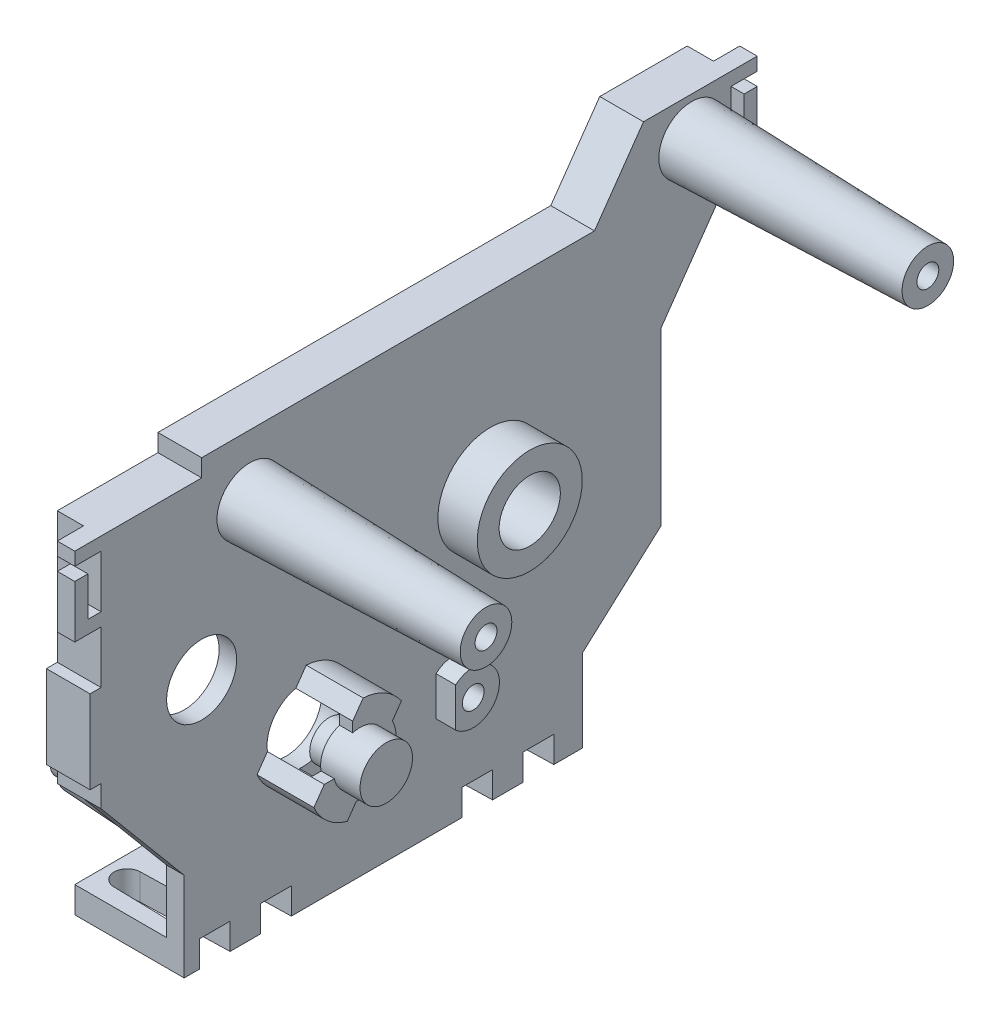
ISO-10303-21;
HEADER;
FILE_DESCRIPTION(('STEP AP214'),'2;1');
FILE_NAME('part.step','',(''),(''),'','','');
FILE_SCHEMA(('AUTOMOTIVE_DESIGN { 1 0 10303 214 1 1 1 1 }'));
ENDSEC;
DATA;
#1=APPLICATION_CONTEXT('core data for automotive mechanical design processes');
#2=APPLICATION_PROTOCOL_DEFINITION('international standard','automotive_design',2000,#1);
#3=PRODUCT_CONTEXT('',#1,'mechanical');
#4=PRODUCT('Part','Part','',(#3));
#5=PRODUCT_RELATED_PRODUCT_CATEGORY('part','',(#4));
#6=PRODUCT_DEFINITION_FORMATION('','',#4);
#7=PRODUCT_DEFINITION_CONTEXT('part definition',#1,'design');
#8=PRODUCT_DEFINITION('design','',#6,#7);
#9=PRODUCT_DEFINITION_SHAPE('','',#8);
#10=(LENGTH_UNIT() NAMED_UNIT(*) SI_UNIT(.MILLI.,.METRE.));
#11=(NAMED_UNIT(*) PLANE_ANGLE_UNIT() SI_UNIT($,.RADIAN.));
#12=(NAMED_UNIT(*) SI_UNIT($,.STERADIAN.) SOLID_ANGLE_UNIT());
#13=UNCERTAINTY_MEASURE_WITH_UNIT(LENGTH_MEASURE(1.E-05),#10,'distance_accuracy_value','');
#14=(GEOMETRIC_REPRESENTATION_CONTEXT(3) GLOBAL_UNCERTAINTY_ASSIGNED_CONTEXT((#13)) GLOBAL_UNIT_ASSIGNED_CONTEXT((#10,
#11,#12)) REPRESENTATION_CONTEXT('',''));
#15=CARTESIAN_POINT('',(0.,0.,0.));
#16=DIRECTION('',(0.,0.,1.));
#17=DIRECTION('',(1.,0.,0.));
#18=AXIS2_PLACEMENT_3D('',#15,#16,#17);
#19=CARTESIAN_POINT('',(-2.,17.5,-27.5));
#20=DIRECTION('',(0.,0.,-1.));
#21=DIRECTION('',(0.,1.,0.));
#22=AXIS2_PLACEMENT_3D('',#19,#20,#21);
#23=PLANE('',#22);
#24=DIRECTION('',(1.,0.,0.));
#25=VECTOR('',#24,1.);
#26=CARTESIAN_POINT('',(-8.70820393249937,18.5,-27.5));
#27=LINE('',#26,#25);
#28=CARTESIAN_POINT('',(-2.,18.5,-27.5));
#29=VERTEX_POINT('',#28);
#30=CARTESIAN_POINT('',(0.,18.5,-27.5));
#31=VERTEX_POINT('',#30);
#32=EDGE_CURVE('E659',#29,#31,#27,.T.);
#33=ORIENTED_EDGE('',*,*,#32,.T.);
#34=DIRECTION('',(0.,1.,0.));
#35=VECTOR('',#34,1.);
#36=CARTESIAN_POINT('',(0.,17.5,-27.5));
#37=LINE('',#36,#35);
#38=CARTESIAN_POINT('',(0.,17.5,-27.5));
#39=VERTEX_POINT('',#38);
#40=EDGE_CURVE('E1240',#39,#31,#37,.T.);
#41=ORIENTED_EDGE('',*,*,#40,.F.);
#42=DIRECTION('',(1.,0.,0.));
#43=VECTOR('',#42,1.);
#44=CARTESIAN_POINT('',(-2.,17.5,-27.5));
#45=LINE('',#44,#43);
#46=CARTESIAN_POINT('',(-2.,17.5,-27.5));
#47=VERTEX_POINT('',#46);
#48=EDGE_CURVE('E1304',#47,#39,#45,.T.);
#49=ORIENTED_EDGE('',*,*,#48,.F.);
#50=DIRECTION('',(0.,1.,0.));
#51=VECTOR('',#50,1.);
#52=CARTESIAN_POINT('',(-2.,17.5,-27.5));
#53=LINE('',#52,#51);
#54=EDGE_CURVE('E58',#47,#29,#53,.T.);
#55=ORIENTED_EDGE('',*,*,#54,.T.);
#56=EDGE_LOOP('',(#33,#41,#49,#55));
#57=FACE_BOUND('',#56,.T.);
#58=ADVANCED_FACE('F32',(#57),#23,.T.);
#59=CARTESIAN_POINT('',(0.,27.5,-27.5));
#60=DIRECTION('',(1.,0.,0.));
#61=DIRECTION('',(0.,0.,-1.));
#62=AXIS2_PLACEMENT_3D('',#59,#60,#61);
#63=PLANE('',#62);
#64=DIRECTION('',(0.,-1.,0.));
#65=VECTOR('',#64,1.);
#66=CARTESIAN_POINT('',(0.,-28.,-3.75));
#67=LINE('',#66,#65);
#68=CARTESIAN_POINT('',(0.,-28.,-3.75));
#69=VERTEX_POINT('',#68);
#70=CARTESIAN_POINT('',(0.,-31.,-3.75));
#71=VERTEX_POINT('',#70);
#72=EDGE_CURVE('E741',#69,#71,#67,.T.);
#73=ORIENTED_EDGE('',*,*,#72,.F.);
#74=DIRECTION('',(0.,0.,1.));
#75=VECTOR('',#74,1.);
#76=CARTESIAN_POINT('',(0.,-28.,-7.25));
#77=LINE('',#76,#75);
#78=CARTESIAN_POINT('',(0.,-28.,-7.25));
#79=VERTEX_POINT('',#78);
#80=EDGE_CURVE('E2679',#79,#69,#77,.T.);
#81=ORIENTED_EDGE('',*,*,#80,.F.);
#82=DIRECTION('',(0.,-1.,0.));
#83=VECTOR('',#82,1.);
#84=CARTESIAN_POINT('',(0.,-28.,-7.25));
#85=LINE('',#84,#83);
#86=CARTESIAN_POINT('',(0.,-31.,-7.25));
#87=VERTEX_POINT('',#86);
#88=EDGE_CURVE('E743',#79,#87,#85,.T.);
#89=ORIENTED_EDGE('',*,*,#88,.T.);
#90=DIRECTION('',(0.,0.,-1.));
#91=VECTOR('',#90,1.);
#92=CARTESIAN_POINT('',(0.,-31.,35.));
#93=LINE('',#92,#91);
#94=CARTESIAN_POINT('',(0.,-31.,-10.5));
#95=VERTEX_POINT('',#94);
#96=EDGE_CURVE('E1286',#87,#95,#93,.T.);
#97=ORIENTED_EDGE('',*,*,#96,.T.);
#98=DIRECTION('',(0.,1.,0.));
#99=VECTOR('',#98,1.);
#100=CARTESIAN_POINT('',(0.,-31.,-10.5));
#101=LINE('',#100,#99);
#102=CARTESIAN_POINT('',(0.,-21.6036363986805,-10.5));
#103=VERTEX_POINT('',#102);
#104=EDGE_CURVE('E1290',#95,#103,#101,.T.);
#105=ORIENTED_EDGE('',*,*,#104,.T.);
#106=DIRECTION('',(0.,0.669130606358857,-0.743144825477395));
#107=VECTOR('',#106,1.);
#108=CARTESIAN_POINT('',(0.,-21.6036363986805,-10.5));
#109=LINE('',#108,#107);
#110=CARTESIAN_POINT('',(0.,-13.5,-19.5));
#111=VERTEX_POINT('',#110);
#112=EDGE_CURVE('E1294',#103,#111,#109,.T.);
#113=ORIENTED_EDGE('',*,*,#112,.T.);
#114=DIRECTION('',(0.,1.,0.));
#115=VECTOR('',#114,1.);
#116=CARTESIAN_POINT('',(0.,-13.5,-19.5));
#117=LINE('',#116,#115);
#118=CARTESIAN_POINT('',(0.,6.07481594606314,-19.5));
#119=VERTEX_POINT('',#118);
#120=EDGE_CURVE('E1297',#111,#119,#117,.T.);
#121=ORIENTED_EDGE('',*,*,#120,.T.);
#122=DIRECTION('',(0.,0.819152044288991,-0.573576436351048));
#123=VECTOR('',#122,1.);
#124=CARTESIAN_POINT('',(0.,6.07481594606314,-19.5));
#125=LINE('',#124,#123);
#126=EDGE_CURVE('E1300',#119,#39,#125,.T.);
#127=ORIENTED_EDGE('',*,*,#126,.T.);
#128=ORIENTED_EDGE('',*,*,#40,.T.);
#129=DIRECTION('',(0.,0.,-1.));
#130=VECTOR('',#129,1.);
#131=CARTESIAN_POINT('',(0.,18.5,-27.5));
#132=LINE('',#131,#130);
#133=CARTESIAN_POINT('',(0.,18.5,-30.5));
#134=VERTEX_POINT('',#133);
#135=EDGE_CURVE('E655',#31,#134,#132,.T.);
#136=ORIENTED_EDGE('',*,*,#135,.T.);
#137=DIRECTION('',(0.,1.,0.));
#138=VECTOR('',#137,1.);
#139=CARTESIAN_POINT('',(0.,18.5,-30.5));
#140=LINE('',#139,#138);
#141=CARTESIAN_POINT('',(0.,24.5,-30.5));
#142=VERTEX_POINT('',#141);
#143=EDGE_CURVE('E668',#134,#142,#140,.T.);
#144=ORIENTED_EDGE('',*,*,#143,.T.);
#145=DIRECTION('',(0.,0.,1.));
#146=VECTOR('',#145,1.);
#147=CARTESIAN_POINT('',(0.,24.5,-30.5));
#148=LINE('',#147,#146);
#149=CARTESIAN_POINT('',(0.,24.5,-29.));
#150=VERTEX_POINT('',#149);
#151=EDGE_CURVE('E671',#142,#150,#148,.T.);
#152=ORIENTED_EDGE('',*,*,#151,.T.);
#153=DIRECTION('',(0.,-1.,0.));
#154=VECTOR('',#153,1.);
#155=CARTESIAN_POINT('',(0.,24.5,-29.));
#156=LINE('',#155,#154);
#157=CARTESIAN_POINT('',(0.,20.,-29.));
#158=VERTEX_POINT('',#157);
#159=EDGE_CURVE('E674',#150,#158,#156,.T.);
#160=ORIENTED_EDGE('',*,*,#159,.T.);
#161=DIRECTION('',(0.,0.,1.));
#162=VECTOR('',#161,1.);
#163=CARTESIAN_POINT('',(0.,20.,-29.));
#164=LINE('',#163,#162);
#165=CARTESIAN_POINT('',(0.,20.,-27.5));
#166=VERTEX_POINT('',#165);
#167=EDGE_CURVE('E677',#158,#166,#164,.T.);
#168=ORIENTED_EDGE('',*,*,#167,.T.);
#169=CARTESIAN_POINT('',(0.,26.,-27.5));
#170=VERTEX_POINT('',#169);
#171=EDGE_CURVE('E36',#166,#170,#37,.T.);
#172=ORIENTED_EDGE('',*,*,#171,.T.);
#173=DIRECTION('',(0.,0.,-1.));
#174=VECTOR('',#173,1.);
#175=CARTESIAN_POINT('',(0.,26.,-30.5));
#176=LINE('',#175,#174);
#177=CARTESIAN_POINT('',(0.,26.,-30.5));
#178=VERTEX_POINT('',#177);
#179=EDGE_CURVE('E702',#170,#178,#176,.T.);
#180=ORIENTED_EDGE('',*,*,#179,.T.);
#181=DIRECTION('',(0.,1.,0.));
#182=VECTOR('',#181,1.);
#183=CARTESIAN_POINT('',(0.,27.5,-30.5));
#184=LINE('',#183,#182);
#185=CARTESIAN_POINT('',(0.,27.5,-30.5));
#186=VERTEX_POINT('',#185);
#187=EDGE_CURVE('E693',#178,#186,#184,.T.);
#188=ORIENTED_EDGE('',*,*,#187,.T.);
#189=DIRECTION('',(0.,0.,1.));
#190=VECTOR('',#189,1.);
#191=CARTESIAN_POINT('',(0.,27.5,-27.5));
#192=LINE('',#191,#190);
#193=CARTESIAN_POINT('',(0.,27.5,-17.5));
#194=VERTEX_POINT('',#193);
#195=EDGE_CURVE('E1243',#186,#194,#192,.T.);
#196=ORIENTED_EDGE('',*,*,#195,.T.);
#197=DIRECTION('',(0.,-0.819152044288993,0.573576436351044));
#198=VECTOR('',#197,1.);
#199=CARTESIAN_POINT('',(0.,27.5,-17.5));
#200=LINE('',#199,#198);
#201=CARTESIAN_POINT('',(0.,19.5,-11.8983396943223));
#202=VERTEX_POINT('',#201);
#203=EDGE_CURVE('E1254',#194,#202,#200,.T.);
#204=ORIENTED_EDGE('',*,*,#203,.T.);
#205=DIRECTION('',(0.,0.,1.));
#206=VECTOR('',#205,1.);
#207=CARTESIAN_POINT('',(0.,19.5,-11.8983396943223));
#208=LINE('',#207,#206);
#209=CARTESIAN_POINT('',(0.,19.5,32.9999999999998));
#210=VERTEX_POINT('',#209);
#211=EDGE_CURVE('E1257',#202,#210,#208,.T.);
#212=ORIENTED_EDGE('',*,*,#211,.T.);
#213=DIRECTION('',(0.,-1.,0.));
#214=VECTOR('',#213,1.);
#215=CARTESIAN_POINT('',(0.,19.5,32.9999999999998));
#216=LINE('',#215,#214);
#217=CARTESIAN_POINT('',(0.,17.5,32.9999999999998));
#218=VERTEX_POINT('',#217);
#219=EDGE_CURVE('E1260',#210,#218,#216,.T.);
#220=ORIENTED_EDGE('',*,*,#219,.T.);
#221=DIRECTION('',(0.,0.,1.));
#222=VECTOR('',#221,1.);
#223=CARTESIAN_POINT('',(0.,17.5,32.9999999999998));
#224=LINE('',#223,#222);
#225=CARTESIAN_POINT('',(0.,17.5,47.5000000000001));
#226=VERTEX_POINT('',#225);
#227=EDGE_CURVE('E1263',#218,#226,#224,.T.);
#228=ORIENTED_EDGE('',*,*,#227,.T.);
#229=DIRECTION('',(0.,-1.,0.));
#230=VECTOR('',#229,1.);
#231=CARTESIAN_POINT('',(0.,17.5,47.5000000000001));
#232=LINE('',#231,#230);
#233=CARTESIAN_POINT('',(0.,16.,47.5000000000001));
#234=VERTEX_POINT('',#233);
#235=EDGE_CURVE('E634',#226,#234,#232,.T.);
#236=ORIENTED_EDGE('',*,*,#235,.T.);
#237=DIRECTION('',(0.,0.,-1.));
#238=VECTOR('',#237,1.);
#239=CARTESIAN_POINT('',(0.,16.,47.5000000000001));
#240=LINE('',#239,#238);
#241=CARTESIAN_POINT('',(0.,16.,44.5));
#242=VERTEX_POINT('',#241);
#243=EDGE_CURVE('E645',#234,#242,#240,.T.);
#244=ORIENTED_EDGE('',*,*,#243,.T.);
#245=DIRECTION('',(0.,-1.,0.));
#246=VECTOR('',#245,1.);
#247=CARTESIAN_POINT('',(0.,17.5,44.5));
#248=LINE('',#247,#246);
#249=CARTESIAN_POINT('',(0.,10.,44.5));
#250=VERTEX_POINT('',#249);
#251=EDGE_CURVE('E1266',#242,#250,#248,.T.);
#252=ORIENTED_EDGE('',*,*,#251,.T.);
#253=DIRECTION('',(0.,0.,1.));
#254=VECTOR('',#253,1.);
#255=CARTESIAN_POINT('',(0.,10.,44.5));
#256=LINE('',#255,#254);
#257=CARTESIAN_POINT('',(0.,10.,46.));
#258=VERTEX_POINT('',#257);
#259=EDGE_CURVE('E599',#250,#258,#256,.T.);
#260=ORIENTED_EDGE('',*,*,#259,.T.);
#261=DIRECTION('',(0.,1.,0.));
#262=VECTOR('',#261,1.);
#263=CARTESIAN_POINT('',(0.,10.,46.));
#264=LINE('',#263,#262);
#265=CARTESIAN_POINT('',(0.,14.5,46.));
#266=VERTEX_POINT('',#265);
#267=EDGE_CURVE('E593',#258,#266,#264,.T.);
#268=ORIENTED_EDGE('',*,*,#267,.T.);
#269=DIRECTION('',(0.,0.,1.));
#270=VECTOR('',#269,1.);
#271=CARTESIAN_POINT('',(0.,14.5,46.));
#272=LINE('',#271,#270);
#273=CARTESIAN_POINT('',(0.,14.5,47.5));
#274=VERTEX_POINT('',#273);
#275=EDGE_CURVE('E602',#266,#274,#272,.T.);
#276=ORIENTED_EDGE('',*,*,#275,.T.);
#277=DIRECTION('',(0.,-1.,0.));
#278=VECTOR('',#277,1.);
#279=CARTESIAN_POINT('',(0.,14.5,47.5));
#280=LINE('',#279,#278);
#281=CARTESIAN_POINT('',(0.,8.5,47.5));
#282=VERTEX_POINT('',#281);
#283=EDGE_CURVE('E608',#274,#282,#280,.T.);
#284=ORIENTED_EDGE('',*,*,#283,.T.);
#285=DIRECTION('',(0.,0.,-1.));
#286=VECTOR('',#285,1.);
#287=CARTESIAN_POINT('',(0.,8.5,47.5));
#288=LINE('',#287,#286);
#289=CARTESIAN_POINT('',(0.,8.5,44.5));
#290=VERTEX_POINT('',#289);
#291=EDGE_CURVE('E619',#282,#290,#288,.T.);
#292=ORIENTED_EDGE('',*,*,#291,.T.);
#293=CARTESIAN_POINT('',(0.,2.5,44.5));
#294=VERTEX_POINT('',#293);
#295=EDGE_CURVE('E1265',#290,#294,#248,.T.);
#296=ORIENTED_EDGE('',*,*,#295,.T.);
#297=DIRECTION('',(0.,0.,1.));
#298=VECTOR('',#297,1.);
#299=CARTESIAN_POINT('',(0.,2.5,44.5));
#300=LINE('',#299,#298);
#301=CARTESIAN_POINT('',(0.,2.5,45.75));
#302=VERTEX_POINT('',#301);
#303=EDGE_CURVE('E1268',#294,#302,#300,.T.);
#304=ORIENTED_EDGE('',*,*,#303,.T.);
#305=DIRECTION('',(0.,-1.,0.));
#306=VECTOR('',#305,1.);
#307=CARTESIAN_POINT('',(0.,2.5,45.75));
#308=LINE('',#307,#306);
#309=CARTESIAN_POINT('',(0.,-7.,45.75));
#310=VERTEX_POINT('',#309);
#311=EDGE_CURVE('E1271',#302,#310,#308,.T.);
#312=ORIENTED_EDGE('',*,*,#311,.T.);
#313=DIRECTION('',(0.,0.,-1.));
#314=VECTOR('',#313,1.);
#315=CARTESIAN_POINT('',(0.,-7.,45.75));
#316=LINE('',#315,#314);
#317=CARTESIAN_POINT('',(0.,-7.,44.5));
#318=VERTEX_POINT('',#317);
#319=EDGE_CURVE('E1274',#310,#318,#316,.T.);
#320=ORIENTED_EDGE('',*,*,#319,.T.);
#321=DIRECTION('',(0.,-1.,0.));
#322=VECTOR('',#321,1.);
#323=CARTESIAN_POINT('',(0.,-7.,44.5));
#324=LINE('',#323,#322);
#325=CARTESIAN_POINT('',(0.,-9.5,44.5));
#326=VERTEX_POINT('',#325);
#327=EDGE_CURVE('E1277',#318,#326,#324,.T.);
#328=ORIENTED_EDGE('',*,*,#327,.T.);
#329=DIRECTION('',(0.,-0.766044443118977,-0.642787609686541));
#330=VECTOR('',#329,1.);
#331=CARTESIAN_POINT('',(0.,-9.5,44.5));
#332=LINE('',#331,#330);
#333=CARTESIAN_POINT('',(0.,-20.8216591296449,35.));
#334=VERTEX_POINT('',#333);
#335=EDGE_CURVE('E1280',#326,#334,#332,.T.);
#336=ORIENTED_EDGE('',*,*,#335,.T.);
#337=DIRECTION('',(0.,-1.,0.));
#338=VECTOR('',#337,1.);
#339=CARTESIAN_POINT('',(0.,-20.8216591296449,35.));
#340=LINE('',#339,#338);
#341=CARTESIAN_POINT('',(0.,-31.,35.));
#342=VERTEX_POINT('',#341);
#343=EDGE_CURVE('E1283',#334,#342,#340,.T.);
#344=ORIENTED_EDGE('',*,*,#343,.T.);
#345=CARTESIAN_POINT('',(0.,-31.,33.25));
#346=VERTEX_POINT('',#345);
#347=EDGE_CURVE('E1287',#342,#346,#93,.T.);
#348=ORIENTED_EDGE('',*,*,#347,.T.);
#349=DIRECTION('',(0.,-1.,0.));
#350=VECTOR('',#349,1.);
#351=CARTESIAN_POINT('',(0.,-28.,33.25));
#352=LINE('',#351,#350);
#353=CARTESIAN_POINT('',(0.,-28.,33.25));
#354=VERTEX_POINT('',#353);
#355=EDGE_CURVE('E824',#354,#346,#352,.T.);
#356=ORIENTED_EDGE('',*,*,#355,.F.);
#357=DIRECTION('',(0.,0.,1.));
#358=VECTOR('',#357,1.);
#359=CARTESIAN_POINT('',(0.,-28.,33.25));
#360=LINE('',#359,#358);
#361=CARTESIAN_POINT('',(0.,-28.,29.75));
#362=VERTEX_POINT('',#361);
#363=EDGE_CURVE('E809',#362,#354,#360,.T.);
#364=ORIENTED_EDGE('',*,*,#363,.F.);
#365=DIRECTION('',(0.,-1.,0.));
#366=VECTOR('',#365,1.);
#367=CARTESIAN_POINT('',(0.,-28.,29.75));
#368=LINE('',#367,#366);
#369=CARTESIAN_POINT('',(0.,-31.,29.75));
#370=VERTEX_POINT('',#369);
#371=EDGE_CURVE('E831',#362,#370,#368,.T.);
#372=ORIENTED_EDGE('',*,*,#371,.T.);
#373=CARTESIAN_POINT('',(0.,-31.,26.25));
#374=VERTEX_POINT('',#373);
#375=EDGE_CURVE('E1291',#370,#374,#93,.T.);
#376=ORIENTED_EDGE('',*,*,#375,.T.);
#377=DIRECTION('',(0.,-1.,0.));
#378=VECTOR('',#377,1.);
#379=CARTESIAN_POINT('',(0.,-28.,26.25));
#380=LINE('',#379,#378);
#381=CARTESIAN_POINT('',(0.,-28.,26.25));
#382=VERTEX_POINT('',#381);
#383=EDGE_CURVE('E793',#382,#374,#380,.T.);
#384=ORIENTED_EDGE('',*,*,#383,.F.);
#385=DIRECTION('',(0.,0.,1.));
#386=VECTOR('',#385,1.);
#387=CARTESIAN_POINT('',(0.,-28.,26.25));
#388=LINE('',#387,#386);
#389=CARTESIAN_POINT('',(0.,-28.,22.75));
#390=VERTEX_POINT('',#389);
#391=EDGE_CURVE('E778',#390,#382,#388,.T.);
#392=ORIENTED_EDGE('',*,*,#391,.F.);
#393=DIRECTION('',(0.,-1.,0.));
#394=VECTOR('',#393,1.);
#395=CARTESIAN_POINT('',(0.,-28.,22.75));
#396=LINE('',#395,#394);
#397=CARTESIAN_POINT('',(0.,-31.,22.75));
#398=VERTEX_POINT('',#397);
#399=EDGE_CURVE('E800',#390,#398,#396,.T.);
#400=ORIENTED_EDGE('',*,*,#399,.T.);
#401=CARTESIAN_POINT('',(0.,-31.,3.25000000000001));
#402=VERTEX_POINT('',#401);
#403=EDGE_CURVE('E2645',#398,#402,#93,.T.);
#404=ORIENTED_EDGE('',*,*,#403,.T.);
#405=DIRECTION('',(0.,-1.,0.));
#406=VECTOR('',#405,1.);
#407=CARTESIAN_POINT('',(0.,-28.,3.25000000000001));
#408=LINE('',#407,#406);
#409=CARTESIAN_POINT('',(0.,-28.,3.25000000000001));
#410=VERTEX_POINT('',#409);
#411=EDGE_CURVE('E771',#410,#402,#408,.T.);
#412=ORIENTED_EDGE('',*,*,#411,.F.);
#413=DIRECTION('',(0.,0.,1.));
#414=VECTOR('',#413,1.);
#415=CARTESIAN_POINT('',(0.,-28.,-0.249999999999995));
#416=LINE('',#415,#414);
#417=CARTESIAN_POINT('',(0.,-28.,-0.249999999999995));
#418=VERTEX_POINT('',#417);
#419=EDGE_CURVE('E756',#418,#410,#416,.T.);
#420=ORIENTED_EDGE('',*,*,#419,.F.);
#421=DIRECTION('',(0.,-1.,0.));
#422=VECTOR('',#421,1.);
#423=CARTESIAN_POINT('',(0.,-28.,-0.249999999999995));
#424=LINE('',#423,#422);
#425=CARTESIAN_POINT('',(0.,-31.,-0.249999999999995));
#426=VERTEX_POINT('',#425);
#427=EDGE_CURVE('E773',#418,#426,#424,.T.);
#428=ORIENTED_EDGE('',*,*,#427,.T.);
#429=EDGE_CURVE('E2643',#426,#71,#93,.T.);
#430=ORIENTED_EDGE('',*,*,#429,.T.);
#431=EDGE_LOOP('',(#73,#81,#89,#97,#105,#113,#121,#127,#128,#136,#144,#152,#160,#168,#172,#180,
#188,#196,#204,#212,#220,#228,#236,#244,#252,#260,#268,#276,#284,#292,#296,#304,#312,#320,#328,
#336,#344,#348,#356,#364,#372,#376,#384,#392,#400,#404,#412,#420,#428,#430));
#432=FACE_BOUND('',#431,.T.);
#433=CARTESIAN_POINT('',(0.,23.,-23.));
#434=DIRECTION('',(1.,0.,0.));
#435=DIRECTION('',(0.,0.,-1.));
#436=AXIS2_PLACEMENT_3D('',#433,#434,#435);
#437=CIRCLE('',#436,3.75);
#438=CARTESIAN_POINT('',(0.,23.,-26.75));
#439=VERTEX_POINT('',#438);
#440=EDGE_CURVE('E857',#439,#439,#437,.T.);
#441=ORIENTED_EDGE('',*,*,#440,.F.);
#442=EDGE_LOOP('',(#441));
#443=FACE_BOUND('',#442,.T.);
#444=CARTESIAN_POINT('',(0.,-12.75,21.4));
#445=DIRECTION('',(1.,0.,0.));
#446=DIRECTION('',(0.,0.,-1.));
#447=AXIS2_PLACEMENT_3D('',#444,#445,#446);
#448=CIRCLE('',#447,5.75);
#449=CARTESIAN_POINT('',(0.,-9.48113314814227,16.6695656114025));
#450=VERTEX_POINT('',#449);
#451=CARTESIAN_POINT('',(0.,-7.01103975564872,21.0438605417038));
#452=VERTEX_POINT('',#451);
#453=EDGE_CURVE('E988',#450,#452,#448,.T.);
#454=ORIENTED_EDGE('',*,*,#453,.F.);
#455=DIRECTION('',(0.,0.819152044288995,-0.573576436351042));
#456=VECTOR('',#455,1.);
#457=CARTESIAN_POINT('',(0.,-9.48113314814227,16.6695656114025));
#458=LINE('',#457,#456);
#459=CARTESIAN_POINT('',(0.,-10.9418837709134,17.6923942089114));
#460=VERTEX_POINT('',#459);
#461=EDGE_CURVE('E981',#460,#450,#458,.T.);
#462=ORIENTED_EDGE('',*,*,#461,.F.);
#463=CARTESIAN_POINT('',(0.,-12.75,21.4));
#464=DIRECTION('',(1.,0.,0.));
#465=DIRECTION('',(0.,0.,-1.));
#466=AXIS2_PLACEMENT_3D('',#463,#464,#465);
#467=CIRCLE('',#466,4.125);
#468=CARTESIAN_POINT('',(0.,-16.8524219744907,21.8309976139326));
#469=VERTEX_POINT('',#468);
#470=EDGE_CURVE('E1357',#469,#460,#467,.T.);
#471=ORIENTED_EDGE('',*,*,#470,.F.);
#472=DIRECTION('',(0.,0.819152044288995,-0.573576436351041));
#473=VECTOR('',#472,1.);
#474=CARTESIAN_POINT('',(0.,-16.8524219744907,21.8309976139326));
#475=LINE('',#474,#473);
#476=CARTESIAN_POINT('',(0.,-18.3131725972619,22.8538262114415));
#477=VERTEX_POINT('',#476);
#478=EDGE_CURVE('E1009',#477,#469,#475,.T.);
#479=ORIENTED_EDGE('',*,*,#478,.F.);
#480=CARTESIAN_POINT('',(0.,-12.75,21.4));
#481=DIRECTION('',(1.,0.,0.));
#482=DIRECTION('',(0.,0.,-1.));
#483=AXIS2_PLACEMENT_3D('',#480,#481,#482);
#484=CIRCLE('',#483,5.75);
#485=CARTESIAN_POINT('',(0.,-15.047501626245,26.6710517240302));
#486=VERTEX_POINT('',#485);
#487=EDGE_CURVE('E1001',#486,#477,#484,.T.);
#488=ORIENTED_EDGE('',*,*,#487,.F.);
#489=DIRECTION('',(0.,-0.819152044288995,0.573576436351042));
#490=VECTOR('',#489,1.);
#491=CARTESIAN_POINT('',(0.,-13.3484440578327,25.4813588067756));
#492=LINE('',#491,#490);
#493=CARTESIAN_POINT('',(0.,-13.3484440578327,25.4813588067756));
#494=VERTEX_POINT('',#493);
#495=EDGE_CURVE('E1006',#494,#486,#492,.T.);
#496=ORIENTED_EDGE('',*,*,#495,.F.);
#497=CARTESIAN_POINT('',(0.,-8.71009732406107,22.2335534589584));
#498=VERTEX_POINT('',#497);
#499=EDGE_CURVE('E1359',#498,#494,#467,.T.);
#500=ORIENTED_EDGE('',*,*,#499,.F.);
#501=DIRECTION('',(0.,-0.819152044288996,0.57357643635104));
#502=VECTOR('',#501,1.);
#503=CARTESIAN_POINT('',(0.,-7.01103975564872,21.0438605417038));
#504=LINE('',#503,#502);
#505=EDGE_CURVE('E986',#452,#498,#504,.T.);
#506=ORIENTED_EDGE('',*,*,#505,.F.);
#507=EDGE_LOOP('',(#454,#462,#471,#479,#488,#496,#500,#506));
#508=FACE_BOUND('',#507,.T.);
#509=DIRECTION('',(0.,-1.,0.));
#510=VECTOR('',#509,1.);
#511=CARTESIAN_POINT('',(0.,-15.2639320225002,6.21307488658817));
#512=LINE('',#511,#510);
#513=CARTESIAN_POINT('',(0.,-15.2639320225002,6.21307488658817));
#514=VERTEX_POINT('',#513);
#515=CARTESIAN_POINT('',(0.,-19.7360679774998,6.21307488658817));
#516=VERTEX_POINT('',#515);
#517=EDGE_CURVE('E1030',#514,#516,#512,.T.);
#518=ORIENTED_EDGE('',*,*,#517,.F.);
#519=CARTESIAN_POINT('',(0.,-17.5,4.21307488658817));
#520=DIRECTION('',(1.,0.,0.));
#521=DIRECTION('',(0.,0.,-1.));
#522=AXIS2_PLACEMENT_3D('',#519,#520,#521);
#523=CIRCLE('',#522,3.);
#524=EDGE_CURVE('E1025',#516,#514,#523,.T.);
#525=ORIENTED_EDGE('',*,*,#524,.F.);
#526=EDGE_LOOP('',(#518,#525));
#527=FACE_BOUND('',#526,.T.);
#528=CARTESIAN_POINT('',(0.,-19.5,14.0110338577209));
#529=DIRECTION('',(1.,0.,0.));
#530=DIRECTION('',(0.,0.,-1.));
#531=AXIS2_PLACEMENT_3D('',#528,#529,#530);
#532=CIRCLE('',#531,1.25);
#533=CARTESIAN_POINT('',(0.,-19.5,12.7610338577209));
#534=VERTEX_POINT('',#533);
#535=EDGE_CURVE('E1204',#534,#534,#532,.T.);
#536=ORIENTED_EDGE('',*,*,#535,.F.);
#537=EDGE_LOOP('',(#536));
#538=FACE_BOUND('',#537,.T.);
#539=CARTESIAN_POINT('',(0.,-2.46943581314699,32.9999999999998));
#540=DIRECTION('',(1.,0.,0.));
#541=DIRECTION('',(0.,0.,-1.));
#542=AXIS2_PLACEMENT_3D('',#539,#540,#541);
#543=CIRCLE('',#542,4.);
#544=CARTESIAN_POINT('',(0.,-2.46943581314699,28.9999999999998));
#545=VERTEX_POINT('',#544);
#546=EDGE_CURVE('E1350',#545,#545,#543,.T.);
#547=ORIENTED_EDGE('',*,*,#546,.F.);
#548=EDGE_LOOP('',(#547));
#549=FACE_BOUND('',#548,.T.);
#550=CARTESIAN_POINT('',(0.,0.,0.));
#551=DIRECTION('',(1.,0.,0.));
#552=DIRECTION('',(0.,0.,-1.));
#553=AXIS2_PLACEMENT_3D('',#550,#551,#552);
#554=CIRCLE('',#553,6.);
#555=CARTESIAN_POINT('',(0.,0.,-6.));
#556=VERTEX_POINT('',#555);
#557=EDGE_CURVE('E919',#556,#556,#554,.T.);
#558=ORIENTED_EDGE('',*,*,#557,.F.);
#559=EDGE_LOOP('',(#558));
#560=FACE_BOUND('',#559,.T.);
#561=CARTESIAN_POINT('',(0.,12.5,27.5));
#562=DIRECTION('',(1.,0.,0.));
#563=DIRECTION('',(0.,0.,-1.));
#564=AXIS2_PLACEMENT_3D('',#561,#562,#563);
#565=CIRCLE('',#564,3.75);
#566=CARTESIAN_POINT('',(0.,12.5,23.75));
#567=VERTEX_POINT('',#566);
#568=EDGE_CURVE('E851',#567,#567,#565,.T.);
#569=ORIENTED_EDGE('',*,*,#568,.F.);
#570=EDGE_LOOP('',(#569));
#571=FACE_BOUND('',#570,.T.);
#572=ADVANCED_FACE('F611',(#432,#443,#508,#527,#538,#549,#560,#571),#63,.T.);
#573=CARTESIAN_POINT('',(-2.,-12.75,37.8));
#574=DIRECTION('',(1.,0.,0.));
#575=DIRECTION('',(0.,0.,1.));
#576=AXIS2_PLACEMENT_3D('',#573,#574,#575);
#577=CONICAL_SURFACE('',#576,3.,0.05235987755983);
#578=CARTESIAN_POINT('',(-2.,-12.75,37.8));
#579=DIRECTION('',(1.,0.,0.));
#580=DIRECTION('',(0.,0.,-1.));
#581=AXIS2_PLACEMENT_3D('',#578,#579,#580);
#582=CIRCLE('',#581,3.);
#583=CARTESIAN_POINT('',(-2.,-12.75,34.8));
#584=VERTEX_POINT('',#583);
#585=EDGE_CURVE('E11',#584,#584,#582,.F.);
#586=ORIENTED_EDGE('',*,*,#585,.T.);
#587=EDGE_LOOP('',(#586));
#588=FACE_BOUND('',#587,.T.);
#589=CARTESIAN_POINT('',(-9.,-12.75,37.8));
#590=DIRECTION('',(-1.,0.,0.));
#591=DIRECTION('',(0.,0.,1.));
#592=AXIS2_PLACEMENT_3D('',#589,#590,#591);
#593=CIRCLE('',#592,2.63314554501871);
#594=CARTESIAN_POINT('',(-9.,-12.75,40.4331455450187));
#595=VERTEX_POINT('',#594);
#596=EDGE_CURVE('E879',#595,#595,#593,.T.);
#597=ORIENTED_EDGE('',*,*,#596,.F.);
#598=EDGE_LOOP('',(#597));
#599=FACE_BOUND('',#598,.T.);
#600=ADVANCED_FACE('F1466',(#588,#599),#577,.T.);
#601=CARTESIAN_POINT('',(-2.,-12.75,5.));
#602=DIRECTION('',(1.,0.,0.));
#603=DIRECTION('',(0.,0.,1.));
#604=AXIS2_PLACEMENT_3D('',#601,#602,#603);
#605=CONICAL_SURFACE('',#604,2.625,0.05235987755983);
#606=CARTESIAN_POINT('',(-2.,-12.75,5.));
#607=DIRECTION('',(-1.,0.,0.));
#608=DIRECTION('',(0.,0.,1.));
#609=AXIS2_PLACEMENT_3D('',#606,#607,#608);
#610=CIRCLE('',#609,2.625);
#611=CARTESIAN_POINT('',(-2.,-15.1458465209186,6.07263434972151));
#612=VERTEX_POINT('',#611);
#613=CARTESIAN_POINT('',(-2.,-14.6719371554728,3.21204514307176));
#614=VERTEX_POINT('',#613);
#615=EDGE_CURVE('E889',#612,#614,#610,.T.);
#616=ORIENTED_EDGE('',*,*,#615,.T.);
#617=CARTESIAN_POINT('',(-1.9998,-14.6719411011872,3.2120339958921));
#618=CARTESIAN_POINT('',(-2.33322130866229,-14.6653607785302,3.23060310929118));
#619=CARTESIAN_POINT('',(-2.66663196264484,-14.6589155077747,3.24940364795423));
#620=CARTESIAN_POINT('',(-3.33343196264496,-14.6462950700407,3.28746757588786));
#621=CARTESIAN_POINT('',(-3.66682130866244,-14.6401199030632,3.30673096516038));
#622=CARTESIAN_POINT('',(-4.00020000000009,-14.6340797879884,3.32622577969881));
#623=B_SPLINE_CURVE_WITH_KNOTS('',3,(#617,#618,#619,#620,#621,#622),.UNSPECIFIED.,.F.,.F.,(4,2,
4),(0.,1.00200748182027,2.00401496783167),.UNSPECIFIED.);
#624=CARTESIAN_POINT('',(-4.,-14.6340834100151,3.32621407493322));
#625=VERTEX_POINT('',#624);
#626=EDGE_CURVE('E42',#614,#625,#623,.T.);
#627=ORIENTED_EDGE('',*,*,#626,.T.);
#628=CARTESIAN_POINT('',(-4.,-12.75,5.));
#629=DIRECTION('',(-1.,0.,0.));
#630=DIRECTION('',(0.,0.,1.));
#631=AXIS2_PLACEMENT_3D('',#628,#629,#630);
#632=CIRCLE('',#631,2.52018444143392);
#633=CARTESIAN_POINT('',(-4.,-15.0731972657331,5.97677227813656));
#634=VERTEX_POINT('',#633);
#635=EDGE_CURVE('E892',#634,#625,#632,.F.);
#636=ORIENTED_EDGE('',*,*,#635,.F.);
#637=CARTESIAN_POINT('',(-4.0002,-15.0731900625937,5.97676236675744));
#638=CARTESIAN_POINT('',(-3.66682130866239,-15.0851942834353,5.99326780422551));
#639=CARTESIAN_POINT('',(-3.33343196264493,-15.0972517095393,6.00951062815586));
#640=CARTESIAN_POINT('',(-2.66663196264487,-15.1214729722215,6.04147104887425));
#641=CARTESIAN_POINT('',(-2.33322130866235,-15.1336368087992,6.0571886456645));
#642=CARTESIAN_POINT('',(-1.99980000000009,-15.1458538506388,6.07264362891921));
#643=B_SPLINE_CURVE_WITH_KNOTS('',3,(#637,#638,#639,#640,#641,#642),.UNSPECIFIED.,.F.,.F.,(4,2,
4),(0.,1.0020074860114,2.00401496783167),.UNSPECIFIED.);
#644=EDGE_CURVE('E1696',#634,#612,#643,.T.);
#645=ORIENTED_EDGE('',*,*,#644,.T.);
#646=EDGE_LOOP('',(#616,#627,#636,#645));
#647=FACE_BOUND('',#646,.T.);
#648=CARTESIAN_POINT('',(-9.,-12.75,5.));
#649=DIRECTION('',(-1.,0.,0.));
#650=DIRECTION('',(0.,0.,1.));
#651=AXIS2_PLACEMENT_3D('',#648,#649,#650);
#652=CIRCLE('',#651,2.25814554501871);
#653=CARTESIAN_POINT('',(-9.,-12.75,7.25814554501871));
#654=VERTEX_POINT('',#653);
#655=EDGE_CURVE('E885',#654,#654,#652,.T.);
#656=ORIENTED_EDGE('',*,*,#655,.F.);
#657=EDGE_LOOP('',(#656));
#658=FACE_BOUND('',#657,.T.);
#659=ADVANCED_FACE('F1683',(#647,#658),#605,.T.);
#660=CARTESIAN_POINT('',(-2.,27.5,-27.5));
#661=DIRECTION('',(1.,0.,0.));
#662=DIRECTION('',(0.,0.,-1.));
#663=AXIS2_PLACEMENT_3D('',#660,#661,#662);
#664=PLANE('',#663);
#665=CARTESIAN_POINT('',(-2.,12.5,27.5));
#666=DIRECTION('',(1.,0.,0.));
#667=DIRECTION('',(0.,0.,-1.));
#668=AXIS2_PLACEMENT_3D('',#665,#666,#667);
#669=CIRCLE('',#668,1.25);
#670=CARTESIAN_POINT('',(-2.,12.5,26.25));
#671=VERTEX_POINT('',#670);
#672=EDGE_CURVE('E842',#671,#671,#669,.T.);
#673=ORIENTED_EDGE('',*,*,#672,.T.);
#674=EDGE_LOOP('',(#673));
#675=FACE_BOUND('',#674,.T.);
#676=CARTESIAN_POINT('',(-2.,23.,-23.));
#677=DIRECTION('',(1.,0.,0.));
#678=DIRECTION('',(0.,0.,-1.));
#679=AXIS2_PLACEMENT_3D('',#676,#677,#678);
#680=CIRCLE('',#679,1.25);
#681=CARTESIAN_POINT('',(-2.,23.,-24.25));
#682=VERTEX_POINT('',#681);
#683=EDGE_CURVE('E848',#682,#682,#680,.T.);
#684=ORIENTED_EDGE('',*,*,#683,.T.);
#685=EDGE_LOOP('',(#684));
#686=FACE_BOUND('',#685,.T.);
#687=ORIENTED_EDGE('',*,*,#615,.F.);
#688=CARTESIAN_POINT('',(-2.,-17.5,4.21307488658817));
#689=DIRECTION('',(1.,0.,0.));
#690=DIRECTION('',(0.,0.,-1.));
#691=AXIS2_PLACEMENT_3D('',#688,#689,#690);
#692=CIRCLE('',#691,3.);
#693=EDGE_CURVE('E1762',#614,#612,#692,.F.);
#694=ORIENTED_EDGE('',*,*,#693,.F.);
#695=EDGE_LOOP('',(#687,#694));
#696=FACE_BOUND('',#695,.T.);
#697=DIRECTION('',(0.,0.,-1.));
#698=VECTOR('',#697,1.);
#699=CARTESIAN_POINT('',(-2.,-28.,35.));
#700=LINE('',#699,#698);
#701=CARTESIAN_POINT('',(-2.,-28.,6.50000000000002));
#702=VERTEX_POINT('',#701);
#703=CARTESIAN_POINT('',(-2.,-28.,3.20009338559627));
#704=VERTEX_POINT('',#703);
#705=EDGE_CURVE('E1215',#702,#704,#700,.T.);
#706=ORIENTED_EDGE('',*,*,#705,.F.);
#707=DIRECTION('',(0.,1.,0.));
#708=VECTOR('',#707,1.);
#709=CARTESIAN_POINT('',(-2.,27.5,6.50000000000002));
#710=LINE('',#709,#708);
#711=CARTESIAN_POINT('',(-2.,-21.5,6.50000000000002));
#712=VERTEX_POINT('',#711);
#713=EDGE_CURVE('E1052',#702,#712,#710,.T.);
#714=ORIENTED_EDGE('',*,*,#713,.T.);
#715=DIRECTION('',(0.,0.,-1.));
#716=VECTOR('',#715,1.);
#717=CARTESIAN_POINT('',(-2.,-21.5,-27.5));
#718=LINE('',#717,#716);
#719=CARTESIAN_POINT('',(-2.,-21.5,8.50000000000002));
#720=VERTEX_POINT('',#719);
#721=EDGE_CURVE('E1056',#712,#720,#718,.F.);
#722=ORIENTED_EDGE('',*,*,#721,.T.);
#723=DIRECTION('',(0.,1.,0.));
#724=VECTOR('',#723,1.);
#725=CARTESIAN_POINT('',(-2.,27.5,8.50000000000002));
#726=LINE('',#725,#724);
#727=CARTESIAN_POINT('',(-2.,-28.,8.50000000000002));
#728=VERTEX_POINT('',#727);
#729=EDGE_CURVE('E1044',#728,#720,#726,.T.);
#730=ORIENTED_EDGE('',*,*,#729,.F.);
#731=CARTESIAN_POINT('',(-2.,-28.,22.7999066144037));
#732=VERTEX_POINT('',#731);
#733=EDGE_CURVE('E1230',#732,#728,#700,.T.);
#734=ORIENTED_EDGE('',*,*,#733,.F.);
#735=CARTESIAN_POINT('',(-2.,-28.,26.2000933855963));
#736=VERTEX_POINT('',#735);
#737=EDGE_CURVE('E1227',#736,#732,#700,.T.);
#738=ORIENTED_EDGE('',*,*,#737,.F.);
#739=CARTESIAN_POINT('',(-2.,-28.,29.7999066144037));
#740=VERTEX_POINT('',#739);
#741=EDGE_CURVE('E1224',#740,#736,#700,.T.);
#742=ORIENTED_EDGE('',*,*,#741,.F.);
#743=CARTESIAN_POINT('',(-2.,-28.,33.2000933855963));
#744=VERTEX_POINT('',#743);
#745=EDGE_CURVE('E1220',#744,#740,#700,.T.);
#746=ORIENTED_EDGE('',*,*,#745,.F.);
#747=CARTESIAN_POINT('',(-2.,-28.,35.));
#748=VERTEX_POINT('',#747);
#749=EDGE_CURVE('E1193',#748,#744,#700,.T.);
#750=ORIENTED_EDGE('',*,*,#749,.F.);
#751=DIRECTION('',(0.,-1.,0.));
#752=VECTOR('',#751,1.);
#753=CARTESIAN_POINT('',(-2.,-20.8216591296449,35.));
#754=LINE('',#753,#752);
#755=CARTESIAN_POINT('',(-2.,-20.8216591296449,35.));
#756=VERTEX_POINT('',#755);
#757=EDGE_CURVE('E1342',#756,#748,#754,.T.);
#758=ORIENTED_EDGE('',*,*,#757,.F.);
#759=DIRECTION('',(0.,-0.766044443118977,-0.642787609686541));
#760=VECTOR('',#759,1.);
#761=CARTESIAN_POINT('',(-2.,-9.5,44.5));
#762=LINE('',#761,#760);
#763=CARTESIAN_POINT('',(-2.,-9.5,44.5));
#764=VERTEX_POINT('',#763);
#765=EDGE_CURVE('E1344',#764,#756,#762,.T.);
#766=ORIENTED_EDGE('',*,*,#765,.F.);
#767=DIRECTION('',(0.,0.,1.));
#768=VECTOR('',#767,1.);
#769=CARTESIAN_POINT('',(-2.,-9.5,44.5));
#770=LINE('',#769,#768);
#771=CARTESIAN_POINT('',(-2.,-9.5,41.75));
#772=VERTEX_POINT('',#771);
#773=EDGE_CURVE('E1073',#772,#764,#770,.T.);
#774=ORIENTED_EDGE('',*,*,#773,.F.);
#775=DIRECTION('',(0.,-1.,0.));
#776=VECTOR('',#775,1.);
#777=CARTESIAN_POINT('',(-2.,14.75,41.75));
#778=LINE('',#777,#776);
#779=CARTESIAN_POINT('',(-2.,14.75,41.75));
#780=VERTEX_POINT('',#779);
#781=EDGE_CURVE('E1127',#780,#772,#778,.T.);
#782=ORIENTED_EDGE('',*,*,#781,.F.);
#783=DIRECTION('',(0.,0.,1.));
#784=VECTOR('',#783,1.);
#785=CARTESIAN_POINT('',(-2.,14.75,30.2499999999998));
#786=LINE('',#785,#784);
#787=CARTESIAN_POINT('',(-2.,14.75,30.2499999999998));
#788=VERTEX_POINT('',#787);
#789=EDGE_CURVE('E1125',#788,#780,#786,.T.);
#790=ORIENTED_EDGE('',*,*,#789,.F.);
#791=DIRECTION('',(0.,-1.,0.));
#792=VECTOR('',#791,1.);
#793=CARTESIAN_POINT('',(-2.,16.75,30.2499999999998));
#794=LINE('',#793,#792);
#795=CARTESIAN_POINT('',(-2.,16.75,30.2499999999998));
#796=VERTEX_POINT('',#795);
#797=EDGE_CURVE('E1123',#796,#788,#794,.T.);
#798=ORIENTED_EDGE('',*,*,#797,.F.);
#799=DIRECTION('',(0.,0.,1.));
#800=VECTOR('',#799,1.);
#801=CARTESIAN_POINT('',(-2.,16.75,-13.3298990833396));
#802=LINE('',#801,#800);
#803=CARTESIAN_POINT('',(-2.,16.75,-13.3298990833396));
#804=VERTEX_POINT('',#803);
#805=EDGE_CURVE('E1121',#804,#796,#802,.T.);
#806=ORIENTED_EDGE('',*,*,#805,.F.);
#807=DIRECTION('',(0.,-0.819152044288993,0.573576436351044));
#808=VECTOR('',#807,1.);
#809=CARTESIAN_POINT('',(-2.,24.75,-18.9315593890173));
#810=LINE('',#809,#808);
#811=CARTESIAN_POINT('',(-2.,24.75,-18.9315593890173));
#812=VERTEX_POINT('',#811);
#813=EDGE_CURVE('E1119',#812,#804,#810,.T.);
#814=ORIENTED_EDGE('',*,*,#813,.F.);
#815=DIRECTION('',(0.,0.,1.));
#816=VECTOR('',#815,1.);
#817=CARTESIAN_POINT('',(-2.,24.75,-27.5));
#818=LINE('',#817,#816);
#819=CARTESIAN_POINT('',(-2.,24.75,-27.5));
#820=VERTEX_POINT('',#819);
#821=EDGE_CURVE('E1068',#820,#812,#818,.T.);
#822=ORIENTED_EDGE('',*,*,#821,.F.);
#823=CARTESIAN_POINT('',(-2.,20.,-27.5));
#824=VERTEX_POINT('',#823);
#825=EDGE_CURVE('E1303',#824,#820,#53,.T.);
#826=ORIENTED_EDGE('',*,*,#825,.F.);
#827=DIRECTION('',(0.,0.,-1.));
#828=VECTOR('',#827,1.);
#829=CARTESIAN_POINT('',(-2.,20.,-29.));
#830=LINE('',#829,#828);
#831=CARTESIAN_POINT('',(-2.,20.,-29.));
#832=VERTEX_POINT('',#831);
#833=EDGE_CURVE('E661',#824,#832,#830,.T.);
#834=ORIENTED_EDGE('',*,*,#833,.T.);
#835=DIRECTION('',(0.,1.,0.));
#836=VECTOR('',#835,1.);
#837=CARTESIAN_POINT('',(-2.,24.5,-29.));
#838=LINE('',#837,#836);
#839=CARTESIAN_POINT('',(-2.,24.5,-29.));
#840=VERTEX_POINT('',#839);
#841=EDGE_CURVE('E658',#832,#840,#838,.T.);
#842=ORIENTED_EDGE('',*,*,#841,.T.);
#843=DIRECTION('',(0.,0.,-1.));
#844=VECTOR('',#843,1.);
#845=CARTESIAN_POINT('',(-2.,24.5,-30.5));
#846=LINE('',#845,#844);
#847=CARTESIAN_POINT('',(-2.,24.5,-30.5));
#848=VERTEX_POINT('',#847);
#849=EDGE_CURVE('E656',#840,#848,#846,.T.);
#850=ORIENTED_EDGE('',*,*,#849,.T.);
#851=DIRECTION('',(0.,-1.,0.));
#852=VECTOR('',#851,1.);
#853=CARTESIAN_POINT('',(-2.,18.5,-30.5));
#854=LINE('',#853,#852);
#855=CARTESIAN_POINT('',(-2.,18.5,-30.5));
#856=VERTEX_POINT('',#855);
#857=EDGE_CURVE('E665',#848,#856,#854,.T.);
#858=ORIENTED_EDGE('',*,*,#857,.T.);
#859=DIRECTION('',(0.,0.,1.));
#860=VECTOR('',#859,1.);
#861=CARTESIAN_POINT('',(-2.,18.5,-27.5));
#862=LINE('',#861,#860);
#863=EDGE_CURVE('E663',#856,#29,#862,.T.);
#864=ORIENTED_EDGE('',*,*,#863,.T.);
#865=ORIENTED_EDGE('',*,*,#54,.F.);
#866=DIRECTION('',(0.,0.819152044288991,-0.573576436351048));
#867=VECTOR('',#866,1.);
#868=CARTESIAN_POINT('',(-2.,6.07481594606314,-19.5));
#869=LINE('',#868,#867);
#870=CARTESIAN_POINT('',(-2.,6.07481594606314,-19.5));
#871=VERTEX_POINT('',#870);
#872=EDGE_CURVE('E1249',#871,#47,#869,.T.);
#873=ORIENTED_EDGE('',*,*,#872,.F.);
#874=DIRECTION('',(0.,0.,-1.));
#875=VECTOR('',#874,1.);
#876=CARTESIAN_POINT('',(-2.,6.07481594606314,-19.5));
#877=LINE('',#876,#875);
#878=CARTESIAN_POINT('',(-2.,6.07481594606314,-16.75));
#879=VERTEX_POINT('',#878);
#880=EDGE_CURVE('E1157',#879,#871,#877,.T.);
#881=ORIENTED_EDGE('',*,*,#880,.F.);
#882=DIRECTION('',(0.,1.,0.));
#883=VECTOR('',#882,1.);
#884=CARTESIAN_POINT('',(-2.,-12.2756211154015,-16.75));
#885=LINE('',#884,#883);
#886=CARTESIAN_POINT('',(-2.,-12.2756211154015,-16.75));
#887=VERTEX_POINT('',#886);
#888=EDGE_CURVE('E1171',#887,#879,#885,.T.);
#889=ORIENTED_EDGE('',*,*,#888,.F.);
#890=DIRECTION('',(0.,0.669130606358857,-0.743144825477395));
#891=VECTOR('',#890,1.);
#892=CARTESIAN_POINT('',(-2.,-19.7039544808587,-8.49999999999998));
#893=LINE('',#892,#891);
#894=CARTESIAN_POINT('',(-2.,-19.7039544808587,-8.49999999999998));
#895=VERTEX_POINT('',#894);
#896=EDGE_CURVE('E1169',#895,#887,#893,.T.);
#897=ORIENTED_EDGE('',*,*,#896,.F.);
#898=DIRECTION('',(0.,1.,0.));
#899=VECTOR('',#898,1.);
#900=CARTESIAN_POINT('',(-2.,-28.,-8.49999999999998));
#901=LINE('',#900,#899);
#902=CARTESIAN_POINT('',(-2.,-28.,-8.49999999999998));
#903=VERTEX_POINT('',#902);
#904=EDGE_CURVE('E1153',#903,#895,#901,.T.);
#905=ORIENTED_EDGE('',*,*,#904,.F.);
#906=CARTESIAN_POINT('',(-2.,-28.,-7.20009338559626));
#907=VERTEX_POINT('',#906);
#908=EDGE_CURVE('E1188',#907,#903,#700,.T.);
#909=ORIENTED_EDGE('',*,*,#908,.F.);
#910=CARTESIAN_POINT('',(-2.,-28.,-3.79990661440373));
#911=VERTEX_POINT('',#910);
#912=EDGE_CURVE('E1237',#911,#907,#700,.T.);
#913=ORIENTED_EDGE('',*,*,#912,.F.);
#914=CARTESIAN_POINT('',(-2.,-28.,-0.200093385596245));
#915=VERTEX_POINT('',#914);
#916=EDGE_CURVE('E1235',#915,#911,#700,.T.);
#917=ORIENTED_EDGE('',*,*,#916,.F.);
#918=EDGE_CURVE('E1233',#704,#915,#700,.T.);
#919=ORIENTED_EDGE('',*,*,#918,.F.);
#920=EDGE_LOOP('',(#706,#714,#722,#730,#734,#738,#742,#746,#750,#758,#766,#774,#782,#790,#798,
#806,#814,#822,#826,#834,#842,#850,#858,#864,#865,#873,#881,#889,#897,#905,#909,#913,#917,#919));
#921=FACE_BOUND('',#920,.T.);
#922=CARTESIAN_POINT('',(-2.,-12.75,21.4));
#923=DIRECTION('',(1.,0.,0.));
#924=DIRECTION('',(0.,0.,-1.));
#925=AXIS2_PLACEMENT_3D('',#922,#923,#924);
#926=CIRCLE('',#925,4.125);
#927=CARTESIAN_POINT('',(-2.,-12.75,17.275));
#928=VERTEX_POINT('',#927);
#929=EDGE_CURVE('E1354',#928,#928,#926,.T.);
#930=ORIENTED_EDGE('',*,*,#929,.T.);
#931=EDGE_LOOP('',(#930));
#932=FACE_BOUND('',#931,.T.);
#933=CARTESIAN_POINT('',(-2.,-2.46943581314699,32.9999999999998));
#934=DIRECTION('',(1.,0.,0.));
#935=DIRECTION('',(0.,0.,-1.));
#936=AXIS2_PLACEMENT_3D('',#933,#934,#935);
#937=CIRCLE('',#936,4.);
#938=CARTESIAN_POINT('',(-2.,-2.46943581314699,28.9999999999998));
#939=VERTEX_POINT('',#938);
#940=EDGE_CURVE('E1353',#939,#939,#937,.T.);
#941=ORIENTED_EDGE('',*,*,#940,.T.);
#942=EDGE_LOOP('',(#941));
#943=FACE_BOUND('',#942,.T.);
#944=CARTESIAN_POINT('',(-2.,0.,0.));
#945=DIRECTION('',(1.,0.,0.));
#946=DIRECTION('',(0.,0.,-1.));
#947=AXIS2_PLACEMENT_3D('',#944,#945,#946);
#948=CIRCLE('',#947,5.5);
#949=CARTESIAN_POINT('',(-2.,0.,-5.5));
#950=VERTEX_POINT('',#949);
#951=EDGE_CURVE('E1759',#950,#950,#948,.F.);
#952=ORIENTED_EDGE('',*,*,#951,.F.);
#953=EDGE_LOOP('',(#952));
#954=FACE_BOUND('',#953,.T.);
#955=CARTESIAN_POINT('',(-2.,-19.5,14.0110338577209));
#956=DIRECTION('',(1.,0.,0.));
#957=DIRECTION('',(0.,0.,-1.));
#958=AXIS2_PLACEMENT_3D('',#955,#956,#957);
#959=CIRCLE('',#958,2.5);
#960=CARTESIAN_POINT('',(-2.,-19.5,11.5110338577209));
#961=VERTEX_POINT('',#960);
#962=EDGE_CURVE('E1769',#961,#961,#959,.F.);
#963=ORIENTED_EDGE('',*,*,#962,.F.);
#964=EDGE_LOOP('',(#963));
#965=FACE_BOUND('',#964,.T.);
#966=ORIENTED_EDGE('',*,*,#585,.F.);
#967=EDGE_LOOP('',(#966));
#968=FACE_BOUND('',#967,.T.);
#969=ADVANCED_FACE('F1363',(#675,#686,#696,#921,#932,#943,#954,#965,#968),#664,.F.);
#970=CARTESIAN_POINT('',(-4.,-17.5,4.21307488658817));
#971=DIRECTION('',(-1.,0.,0.));
#972=DIRECTION('',(0.,0.,1.));
#973=AXIS2_PLACEMENT_3D('',#970,#971,#972);
#974=PLANE('',#973);
#975=CARTESIAN_POINT('',(-4.,-17.5,4.21307488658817));
#976=DIRECTION('',(-1.,0.,0.));
#977=DIRECTION('',(0.,0.,1.));
#978=AXIS2_PLACEMENT_3D('',#975,#976,#977);
#979=CIRCLE('',#978,1.25);
#980=CARTESIAN_POINT('',(-4.,-17.5,5.46307488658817));
#981=VERTEX_POINT('',#980);
#982=EDGE_CURVE('E900',#981,#981,#979,.T.);
#983=ORIENTED_EDGE('',*,*,#982,.F.);
#984=EDGE_LOOP('',(#983));
#985=FACE_BOUND('',#984,.T.);
#986=CARTESIAN_POINT('',(-4.,-17.5,4.21307488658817));
#987=DIRECTION('',(-1.,0.,0.));
#988=DIRECTION('',(0.,0.,1.));
#989=AXIS2_PLACEMENT_3D('',#986,#987,#988);
#990=CIRCLE('',#989,3.);
#991=EDGE_CURVE('E903',#625,#634,#990,.T.);
#992=ORIENTED_EDGE('',*,*,#991,.T.);
#993=ORIENTED_EDGE('',*,*,#635,.T.);
#994=EDGE_LOOP('',(#992,#993));
#995=FACE_BOUND('',#994,.T.);
#996=ADVANCED_FACE('F1714',(#985,#995),#974,.T.);
#997=CARTESIAN_POINT('',(-4.,-17.5,4.21307488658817));
#998=DIRECTION('',(1.,0.,0.));
#999=DIRECTION('',(0.,0.,-1.));
#1000=AXIS2_PLACEMENT_3D('',#997,#998,#999);
#1001=CYLINDRICAL_SURFACE('',#1000,3.);
#1002=ORIENTED_EDGE('',*,*,#626,.F.);
#1003=ORIENTED_EDGE('',*,*,#693,.T.);
#1004=ORIENTED_EDGE('',*,*,#644,.F.);
#1005=ORIENTED_EDGE('',*,*,#991,.F.);
#1006=EDGE_LOOP('',(#1002,#1003,#1004,#1005));
#1007=FACE_BOUND('',#1006,.T.);
#1008=ADVANCED_FACE('F1708',(#1007),#1001,.T.);
#1009=CARTESIAN_POINT('',(-2.,0.,0.));
#1010=DIRECTION('',(1.,0.,0.));
#1011=DIRECTION('',(0.,0.,-1.));
#1012=AXIS2_PLACEMENT_3D('',#1009,#1010,#1011);
#1013=CYLINDRICAL_SURFACE('',#1012,3.5);
#1014=CARTESIAN_POINT('',(4.5,0.,0.));
#1015=DIRECTION('',(1.,0.,0.));
#1016=DIRECTION('',(0.,0.,-1.));
#1017=AXIS2_PLACEMENT_3D('',#1014,#1015,#1016);
#1018=CIRCLE('',#1017,3.5);
#1019=CARTESIAN_POINT('',(4.5,0.,-3.5));
#1020=VERTEX_POINT('',#1019);
#1021=EDGE_CURVE('E916',#1020,#1020,#1018,.T.);
#1022=ORIENTED_EDGE('',*,*,#1021,.T.);
#1023=EDGE_LOOP('',(#1022));
#1024=FACE_BOUND('',#1023,.T.);
#1025=CARTESIAN_POINT('',(-1.,0.,0.));
#1026=DIRECTION('',(-1.,0.,0.));
#1027=DIRECTION('',(0.,0.,1.));
#1028=AXIS2_PLACEMENT_3D('',#1025,#1026,#1027);
#1029=CIRCLE('',#1028,3.5);
#1030=CARTESIAN_POINT('',(-1.,0.,3.5));
#1031=VERTEX_POINT('',#1030);
#1032=EDGE_CURVE('E910',#1031,#1031,#1029,.F.);
#1033=ORIENTED_EDGE('',*,*,#1032,.F.);
#1034=EDGE_LOOP('',(#1033));
#1035=FACE_BOUND('',#1034,.T.);
#1036=ADVANCED_FACE('F1713',(#1024,#1035),#1013,.F.);
#1037=CARTESIAN_POINT('',(5.,-12.75,21.4));
#1038=DIRECTION('',(1.,0.,0.));
#1039=DIRECTION('',(0.,0.,-1.));
#1040=AXIS2_PLACEMENT_3D('',#1037,#1038,#1039);
#1041=PLANE('',#1040);
#1042=CARTESIAN_POINT('',(5.,-12.75,21.4));
#1043=DIRECTION('',(1.,0.,0.));
#1044=DIRECTION('',(0.,0.,-1.));
#1045=AXIS2_PLACEMENT_3D('',#1042,#1043,#1044);
#1046=CIRCLE('',#1045,4.125);
#1047=CARTESIAN_POINT('',(5.,-16.8524219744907,21.8309976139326));
#1048=VERTEX_POINT('',#1047);
#1049=CARTESIAN_POINT('',(5.,-10.9418837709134,17.6923942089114));
#1050=VERTEX_POINT('',#1049);
#1051=EDGE_CURVE('E937',#1048,#1050,#1046,.T.);
#1052=ORIENTED_EDGE('',*,*,#1051,.F.);
#1053=CARTESIAN_POINT('',(5.,-12.75,21.4));
#1054=DIRECTION('',(-1.,0.,0.));
#1055=DIRECTION('',(0.,0.,-1.));
#1056=AXIS2_PLACEMENT_3D('',#1053,#1054,#1055);
#1057=CIRCLE('',#1056,4.125);
#1058=CARTESIAN_POINT('',(5.,-13.3484440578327,25.4813588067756));
#1059=VERTEX_POINT('',#1058);
#1060=EDGE_CURVE('E1002',#1048,#1059,#1057,.T.);
#1061=ORIENTED_EDGE('',*,*,#1060,.T.);
#1062=DIRECTION('',(0.,0.,1.));
#1063=VECTOR('',#1062,1.);
#1064=CARTESIAN_POINT('',(5.,-13.3484440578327,25.4813588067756));
#1065=LINE('',#1064,#1063);
#1066=CARTESIAN_POINT('',(5.,-13.3484440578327,24.3397048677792));
#1067=VERTEX_POINT('',#1066);
#1068=EDGE_CURVE('E942',#1067,#1059,#1065,.T.);
#1069=ORIENTED_EDGE('',*,*,#1068,.F.);
#1070=CARTESIAN_POINT('',(5.,-12.75,21.4));
#1071=DIRECTION('',(1.,0.,0.));
#1072=DIRECTION('',(0.,0.,-1.));
#1073=AXIS2_PLACEMENT_3D('',#1070,#1071,#1072);
#1074=CIRCLE('',#1073,3.);
#1075=CARTESIAN_POINT('',(5.,-9.868127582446,22.2335534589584));
#1076=VERTEX_POINT('',#1075);
#1077=EDGE_CURVE('E964',#1076,#1067,#1074,.T.);
#1078=ORIENTED_EDGE('',*,*,#1077,.F.);
#1079=DIRECTION('',(0.,-1.,0.));
#1080=VECTOR('',#1079,1.);
#1081=CARTESIAN_POINT('',(5.,-8.71009732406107,22.2335534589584));
#1082=LINE('',#1081,#1080);
#1083=CARTESIAN_POINT('',(5.,-8.71009732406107,22.2335534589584));
#1084=VERTEX_POINT('',#1083);
#1085=EDGE_CURVE('E962',#1084,#1076,#1082,.T.);
#1086=ORIENTED_EDGE('',*,*,#1085,.F.);
#1087=CARTESIAN_POINT('',(5.,-12.75,21.4));
#1088=DIRECTION('',(-1.,0.,0.));
#1089=DIRECTION('',(0.,0.,-1.));
#1090=AXIS2_PLACEMENT_3D('',#1087,#1088,#1089);
#1091=CIRCLE('',#1090,4.125);
#1092=EDGE_CURVE('E982',#1084,#1050,#1091,.T.);
#1093=ORIENTED_EDGE('',*,*,#1092,.T.);
#1094=EDGE_LOOP('',(#1052,#1061,#1069,#1078,#1086,#1093));
#1095=FACE_BOUND('',#1094,.T.);
#1096=CARTESIAN_POINT('',(5.,-12.75,21.4));
#1097=DIRECTION('',(1.,0.,0.));
#1098=DIRECTION('',(0.,0.,-1.));
#1099=AXIS2_PLACEMENT_3D('',#1096,#1097,#1098);
#1100=CIRCLE('',#1099,2.25);
#1101=CARTESIAN_POINT('',(5.,-12.75,19.15));
#1102=VERTEX_POINT('',#1101);
#1103=EDGE_CURVE('E1411',#1102,#1102,#1100,.F.);
#1104=ORIENTED_EDGE('',*,*,#1103,.F.);
#1105=EDGE_LOOP('',(#1104));
#1106=FACE_BOUND('',#1105,.T.);
#1107=ADVANCED_FACE('F1426',(#1095,#1106),#1041,.F.);
#1108=CARTESIAN_POINT('',(-12.5,-28.,35.));
#1109=DIRECTION('',(0.,-1.,0.));
#1110=DIRECTION('',(0.,0.,-1.));
#1111=AXIS2_PLACEMENT_3D('',#1108,#1109,#1110);
#1112=PLANE('',#1111);
#1113=ORIENTED_EDGE('',*,*,#916,.T.);
#1114=DIRECTION('',(-0.999688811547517,0.,-0.0249455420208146));
#1115=VECTOR('',#1114,1.);
#1116=CARTESIAN_POINT('',(0.,-28.,-3.75));
#1117=LINE('',#1116,#1115);
#1118=CARTESIAN_POINT('',(-10.0374183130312,-28.,-4.00046678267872));
#1119=VERTEX_POINT('',#1118);
#1120=EDGE_CURVE('E2680',#911,#1119,#1117,.T.);
#1121=ORIENTED_EDGE('',*,*,#1120,.T.);
#1122=CARTESIAN_POINT('',(-10.,-28.,-5.5));
#1123=DIRECTION('',(0.,-1.,0.));
#1124=DIRECTION('',(0.,0.,1.));
#1125=AXIS2_PLACEMENT_3D('',#1122,#1123,#1124);
#1126=CIRCLE('',#1125,1.50000000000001);
#1127=CARTESIAN_POINT('',(-10.0374183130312,-28.,-6.99953321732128));
#1128=VERTEX_POINT('',#1127);
#1129=EDGE_CURVE('E737',#1119,#1128,#1126,.T.);
#1130=ORIENTED_EDGE('',*,*,#1129,.T.);
#1131=DIRECTION('',(0.999688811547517,0.,-0.0249455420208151));
#1132=VECTOR('',#1131,1.);
#1133=CARTESIAN_POINT('',(0.,-28.,-7.25));
#1134=LINE('',#1133,#1132);
#1135=EDGE_CURVE('E2681',#1128,#907,#1134,.T.);
#1136=ORIENTED_EDGE('',*,*,#1135,.T.);
#1137=ORIENTED_EDGE('',*,*,#908,.T.);
#1138=DIRECTION('',(1.,0.,0.));
#1139=VECTOR('',#1138,1.);
#1140=CARTESIAN_POINT('',(-5.,-28.,-8.49999999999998));
#1141=LINE('',#1140,#1139);
#1142=CARTESIAN_POINT('',(-12.5,-28.,-8.49999999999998));
#1143=VERTEX_POINT('',#1142);
#1144=EDGE_CURVE('E1185',#1143,#903,#1141,.T.);
#1145=ORIENTED_EDGE('',*,*,#1144,.F.);
#1146=DIRECTION('',(0.,0.,-1.));
#1147=VECTOR('',#1146,1.);
#1148=CARTESIAN_POINT('',(-12.5,-28.,35.));
#1149=LINE('',#1148,#1147);
#1150=CARTESIAN_POINT('',(-12.5,-28.,35.));
#1151=VERTEX_POINT('',#1150);
#1152=EDGE_CURVE('E1192',#1151,#1143,#1149,.T.);
#1153=ORIENTED_EDGE('',*,*,#1152,.F.);
#1154=DIRECTION('',(1.,0.,0.));
#1155=VECTOR('',#1154,1.);
#1156=CARTESIAN_POINT('',(-12.5,-28.,35.));
#1157=LINE('',#1156,#1155);
#1158=EDGE_CURVE('E1201',#1151,#748,#1157,.T.);
#1159=ORIENTED_EDGE('',*,*,#1158,.T.);
#1160=ORIENTED_EDGE('',*,*,#749,.T.);
#1161=DIRECTION('',(-0.999688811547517,0.,-0.024945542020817));
#1162=VECTOR('',#1161,1.);
#1163=CARTESIAN_POINT('',(0.,-28.,33.25));
#1164=LINE('',#1163,#1162);
#1165=CARTESIAN_POINT('',(-10.0374183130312,-28.,32.9995332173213));
#1166=VERTEX_POINT('',#1165);
#1167=EDGE_CURVE('E812',#744,#1166,#1164,.T.);
#1168=ORIENTED_EDGE('',*,*,#1167,.T.);
#1169=CARTESIAN_POINT('',(-10.,-28.,31.5));
#1170=DIRECTION('',(0.,-1.,0.));
#1171=DIRECTION('',(0.,0.,-1.));
#1172=AXIS2_PLACEMENT_3D('',#1169,#1170,#1171);
#1173=CIRCLE('',#1172,1.49999999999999);
#1174=CARTESIAN_POINT('',(-10.0374183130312,-28.,30.0004667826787));
#1175=VERTEX_POINT('',#1174);
#1176=EDGE_CURVE('E817',#1166,#1175,#1173,.T.);
#1177=ORIENTED_EDGE('',*,*,#1176,.T.);
#1178=DIRECTION('',(0.999688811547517,0.,-0.0249455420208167));
#1179=VECTOR('',#1178,1.);
#1180=CARTESIAN_POINT('',(0.,-28.,29.75));
#1181=LINE('',#1180,#1179);
#1182=EDGE_CURVE('E821',#1175,#740,#1181,.T.);
#1183=ORIENTED_EDGE('',*,*,#1182,.T.);
#1184=ORIENTED_EDGE('',*,*,#741,.T.);
#1185=DIRECTION('',(-0.999688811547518,0.,-0.0249455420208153));
#1186=VECTOR('',#1185,1.);
#1187=CARTESIAN_POINT('',(0.,-28.,26.25));
#1188=LINE('',#1187,#1186);
#1189=CARTESIAN_POINT('',(-10.0374183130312,-28.,25.9995332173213));
#1190=VERTEX_POINT('',#1189);
#1191=EDGE_CURVE('E781',#736,#1190,#1188,.T.);
#1192=ORIENTED_EDGE('',*,*,#1191,.T.);
#1193=CARTESIAN_POINT('',(-10.,-28.,24.5));
#1194=DIRECTION('',(0.,-1.,0.));
#1195=DIRECTION('',(0.,0.,-1.));
#1196=AXIS2_PLACEMENT_3D('',#1193,#1194,#1195);
#1197=CIRCLE('',#1196,1.5);
#1198=CARTESIAN_POINT('',(-10.0374183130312,-28.,23.0004667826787));
#1199=VERTEX_POINT('',#1198);
#1200=EDGE_CURVE('E786',#1190,#1199,#1197,.T.);
#1201=ORIENTED_EDGE('',*,*,#1200,.T.);
#1202=DIRECTION('',(0.999688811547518,0.,-0.024945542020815));
#1203=VECTOR('',#1202,1.);
#1204=CARTESIAN_POINT('',(0.,-28.,22.75));
#1205=LINE('',#1204,#1203);
#1206=EDGE_CURVE('E790',#1199,#732,#1205,.T.);
#1207=ORIENTED_EDGE('',*,*,#1206,.T.);
#1208=ORIENTED_EDGE('',*,*,#733,.T.);
#1209=DIRECTION('',(1.,0.,0.));
#1210=VECTOR('',#1209,1.);
#1211=CARTESIAN_POINT('',(-12.5,-28.,8.50000000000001));
#1212=LINE('',#1211,#1210);
#1213=CARTESIAN_POINT('',(-8.49999999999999,-28.,8.50000000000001));
#1214=VERTEX_POINT('',#1213);
#1215=EDGE_CURVE('E1049',#1214,#728,#1212,.T.);
#1216=ORIENTED_EDGE('',*,*,#1215,.F.);
#1217=DIRECTION('',(0.,0.,1.));
#1218=VECTOR('',#1217,1.);
#1219=CARTESIAN_POINT('',(-8.49999999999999,-28.,35.));
#1220=LINE('',#1219,#1218);
#1221=CARTESIAN_POINT('',(-8.5,-28.,6.50000000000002));
#1222=VERTEX_POINT('',#1221);
#1223=EDGE_CURVE('E1058',#1214,#1222,#1220,.F.);
#1224=ORIENTED_EDGE('',*,*,#1223,.T.);
#1225=DIRECTION('',(1.,0.,0.));
#1226=VECTOR('',#1225,1.);
#1227=CARTESIAN_POINT('',(-12.5,-28.,6.50000000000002));
#1228=LINE('',#1227,#1226);
#1229=EDGE_CURVE('E1054',#1222,#702,#1228,.T.);
#1230=ORIENTED_EDGE('',*,*,#1229,.T.);
#1231=ORIENTED_EDGE('',*,*,#705,.T.);
#1232=DIRECTION('',(-0.999688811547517,0.,-0.024945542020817));
#1233=VECTOR('',#1232,1.);
#1234=CARTESIAN_POINT('',(0.,-28.,3.25000000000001));
#1235=LINE('',#1234,#1233);
#1236=CARTESIAN_POINT('',(-10.0374183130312,-28.,2.99953321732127));
#1237=VERTEX_POINT('',#1236);
#1238=EDGE_CURVE('E758',#704,#1237,#1235,.T.);
#1239=ORIENTED_EDGE('',*,*,#1238,.T.);
#1240=CARTESIAN_POINT('',(-10.,-28.,1.5));
#1241=DIRECTION('',(0.,-1.,0.));
#1242=DIRECTION('',(0.,0.,1.));
#1243=AXIS2_PLACEMENT_3D('',#1240,#1241,#1242);
#1244=CIRCLE('',#1243,1.49999999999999);
#1245=CARTESIAN_POINT('',(-10.0374183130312,-28.,0.000466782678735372));
#1246=VERTEX_POINT('',#1245);
#1247=EDGE_CURVE('E748',#1237,#1246,#1244,.T.);
#1248=ORIENTED_EDGE('',*,*,#1247,.T.);
#1249=DIRECTION('',(0.999688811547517,0.,-0.0249455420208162));
#1250=VECTOR('',#1249,1.);
#1251=CARTESIAN_POINT('',(0.,-28.,-0.249999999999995));
#1252=LINE('',#1251,#1250);
#1253=EDGE_CURVE('E753',#1246,#915,#1252,.T.);
#1254=ORIENTED_EDGE('',*,*,#1253,.T.);
#1255=EDGE_LOOP('',(#1113,#1121,#1130,#1136,#1137,#1145,#1153,#1159,#1160,#1168,#1177,#1183,
#1184,#1192,#1201,#1207,#1208,#1216,#1224,#1230,#1231,#1239,#1248,#1254));
#1256=FACE_BOUND('',#1255,.T.);
#1257=ADVANCED_FACE('F1470',(#1256),#1112,.F.);
#1258=DIRECTION('',(1.,0.,0.));
#1259=VECTOR('',#1258,1.);
#1260=CARTESIAN_POINT('',(-8.70820393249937,20.,-27.5));
#1261=LINE('',#1260,#1259);
#1262=EDGE_CURVE('E682',#824,#166,#1261,.T.);
#1263=ORIENTED_EDGE('',*,*,#1262,.F.);
#1264=ORIENTED_EDGE('',*,*,#825,.T.);
#1265=DIRECTION('',(1.,0.,0.));
#1266=VECTOR('',#1265,1.);
#1267=CARTESIAN_POINT('',(-5.,24.75,-27.5));
#1268=LINE('',#1267,#1266);
#1269=CARTESIAN_POINT('',(-5.,24.75,-27.5));
#1270=VERTEX_POINT('',#1269);
#1271=EDGE_CURVE('E1150',#1270,#820,#1268,.T.);
#1272=ORIENTED_EDGE('',*,*,#1271,.F.);
#1273=DIRECTION('',(0.,-1.,0.));
#1274=VECTOR('',#1273,1.);
#1275=CARTESIAN_POINT('',(-5.,27.5,-27.5));
#1276=LINE('',#1275,#1274);
#1277=CARTESIAN_POINT('',(-5.,27.5,-27.5));
#1278=VERTEX_POINT('',#1277);
#1279=EDGE_CURVE('E1069',#1278,#1270,#1276,.T.);
#1280=ORIENTED_EDGE('',*,*,#1279,.F.);
#1281=DIRECTION('',(1.,0.,0.));
#1282=VECTOR('',#1281,1.);
#1283=CARTESIAN_POINT('',(-2.,27.5,-27.5));
#1284=LINE('',#1283,#1282);
#1285=CARTESIAN_POINT('',(-2.,27.5,-27.5));
#1286=VERTEX_POINT('',#1285);
#1287=EDGE_CURVE('E1244',#1278,#1286,#1284,.T.);
#1288=ORIENTED_EDGE('',*,*,#1287,.T.);
#1289=DIRECTION('',(0.,1.,0.));
#1290=VECTOR('',#1289,1.);
#1291=CARTESIAN_POINT('',(-2.,26.,-27.5));
#1292=LINE('',#1291,#1290);
#1293=CARTESIAN_POINT('',(-2.,26.,-27.5));
#1294=VERTEX_POINT('',#1293);
#1295=EDGE_CURVE('E697',#1294,#1286,#1292,.T.);
#1296=ORIENTED_EDGE('',*,*,#1295,.F.);
#1297=DIRECTION('',(1.,0.,0.));
#1298=VECTOR('',#1297,1.);
#1299=CARTESIAN_POINT('',(-8.70820393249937,26.,-27.5));
#1300=LINE('',#1299,#1298);
#1301=EDGE_CURVE('E705',#1294,#170,#1300,.T.);
#1302=ORIENTED_EDGE('',*,*,#1301,.T.);
#1303=ORIENTED_EDGE('',*,*,#171,.F.);
#1304=EDGE_LOOP('',(#1263,#1264,#1272,#1280,#1288,#1296,#1302,#1303));
#1305=FACE_BOUND('',#1304,.T.);
#1306=ADVANCED_FACE('F34',(#1305),#23,.T.);
#1307=CARTESIAN_POINT('',(-2.,6.07481594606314,-19.5));
#1308=DIRECTION('',(0.,-0.573576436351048,-0.819152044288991));
#1309=DIRECTION('',(0.,0.819152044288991,-0.573576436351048));
#1310=AXIS2_PLACEMENT_3D('',#1307,#1308,#1309);
#1311=PLANE('',#1310);
#1312=ORIENTED_EDGE('',*,*,#126,.F.);
#1313=DIRECTION('',(1.,0.,0.));
#1314=VECTOR('',#1313,1.);
#1315=CARTESIAN_POINT('',(-2.,6.07481594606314,-19.5));
#1316=LINE('',#1315,#1314);
#1317=EDGE_CURVE('E1307',#871,#119,#1316,.T.);
#1318=ORIENTED_EDGE('',*,*,#1317,.F.);
#1319=ORIENTED_EDGE('',*,*,#872,.T.);
#1320=ORIENTED_EDGE('',*,*,#48,.T.);
#1321=EDGE_LOOP('',(#1312,#1318,#1319,#1320));
#1322=FACE_BOUND('',#1321,.T.);
#1323=ADVANCED_FACE('F1469',(#1322),#1311,.T.);
#1324=CARTESIAN_POINT('',(-2.,-13.5,-19.5));
#1325=DIRECTION('',(0.,0.,-1.));
#1326=DIRECTION('',(-1.,0.,0.));
#1327=AXIS2_PLACEMENT_3D('',#1324,#1325,#1326);
#1328=PLANE('',#1327);
#1329=ORIENTED_EDGE('',*,*,#120,.F.);
#1330=DIRECTION('',(1.,0.,0.));
#1331=VECTOR('',#1330,1.);
#1332=CARTESIAN_POINT('',(-2.,-13.5,-19.5));
#1333=LINE('',#1332,#1331);
#1334=CARTESIAN_POINT('',(-5.,-13.5,-19.5));
#1335=VERTEX_POINT('',#1334);
#1336=EDGE_CURVE('E1309',#1335,#111,#1333,.T.);
#1337=ORIENTED_EDGE('',*,*,#1336,.F.);
#1338=DIRECTION('',(0.,-1.,0.));
#1339=VECTOR('',#1338,1.);
#1340=CARTESIAN_POINT('',(-5.,-13.5,-19.5));
#1341=LINE('',#1340,#1339);
#1342=CARTESIAN_POINT('',(-5.,6.07481594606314,-19.5));
#1343=VERTEX_POINT('',#1342);
#1344=EDGE_CURVE('E1161',#1343,#1335,#1341,.T.);
#1345=ORIENTED_EDGE('',*,*,#1344,.F.);
#1346=DIRECTION('',(1.,0.,0.));
#1347=VECTOR('',#1346,1.);
#1348=CARTESIAN_POINT('',(-5.,6.07481594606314,-19.5));
#1349=LINE('',#1348,#1347);
#1350=EDGE_CURVE('E1167',#1343,#871,#1349,.T.);
#1351=ORIENTED_EDGE('',*,*,#1350,.T.);
#1352=ORIENTED_EDGE('',*,*,#1317,.T.);
#1353=EDGE_LOOP('',(#1329,#1337,#1345,#1351,#1352));
#1354=FACE_BOUND('',#1353,.T.);
#1355=ADVANCED_FACE('F1476',(#1354),#1328,.T.);
#1356=CARTESIAN_POINT('',(-2.,-21.6036363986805,-10.5));
#1357=DIRECTION('',(0.,-0.743144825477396,-0.669130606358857));
#1358=DIRECTION('',(0.,0.669130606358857,-0.743144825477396));
#1359=AXIS2_PLACEMENT_3D('',#1356,#1357,#1358);
#1360=PLANE('',#1359);
#1361=ORIENTED_EDGE('',*,*,#112,.F.);
#1362=DIRECTION('',(1.,0.,0.));
#1363=VECTOR('',#1362,1.);
#1364=CARTESIAN_POINT('',(-2.,-21.6036363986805,-10.5));
#1365=LINE('',#1364,#1363);
#1366=CARTESIAN_POINT('',(-5.,-21.6036363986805,-10.5));
#1367=VERTEX_POINT('',#1366);
#1368=EDGE_CURVE('E1311',#1367,#103,#1365,.T.);
#1369=ORIENTED_EDGE('',*,*,#1368,.F.);
#1370=DIRECTION('',(0.,-0.669130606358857,0.743144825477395));
#1371=VECTOR('',#1370,1.);
#1372=CARTESIAN_POINT('',(-5.,-21.6036363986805,-10.5));
#1373=LINE('',#1372,#1371);
#1374=EDGE_CURVE('E1164',#1335,#1367,#1373,.T.);
#1375=ORIENTED_EDGE('',*,*,#1374,.F.);
#1376=ORIENTED_EDGE('',*,*,#1336,.T.);
#1377=EDGE_LOOP('',(#1361,#1369,#1375,#1376));
#1378=FACE_BOUND('',#1377,.T.);
#1379=ADVANCED_FACE('F1808',(#1378),#1360,.T.);
#1380=CARTESIAN_POINT('',(-2.,-31.,-10.5));
#1381=DIRECTION('',(0.,0.,-1.));
#1382=DIRECTION('',(-1.,0.,0.));
#1383=AXIS2_PLACEMENT_3D('',#1380,#1381,#1382);
#1384=PLANE('',#1383);
#1385=DIRECTION('',(0.,-1.,0.));
#1386=VECTOR('',#1385,1.);
#1387=CARTESIAN_POINT('',(-12.5,-31.,-10.5));
#1388=LINE('',#1387,#1386);
#1389=CARTESIAN_POINT('',(-12.5,-28.,-10.5));
#1390=VERTEX_POINT('',#1389);
#1391=CARTESIAN_POINT('',(-12.5,-31.,-10.5));
#1392=VERTEX_POINT('',#1391);
#1393=EDGE_CURVE('E1196',#1390,#1392,#1388,.T.);
#1394=ORIENTED_EDGE('',*,*,#1393,.F.);
#1395=DIRECTION('',(-0.670620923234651,-0.741800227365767,0.));
#1396=VECTOR('',#1395,1.);
#1397=CARTESIAN_POINT('',(-5.,-19.7039544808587,-10.5));
#1398=LINE('',#1397,#1396);
#1399=CARTESIAN_POINT('',(-5.,-19.7039544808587,-10.5));
#1400=VERTEX_POINT('',#1399);
#1401=EDGE_CURVE('E1061',#1400,#1390,#1398,.T.);
#1402=ORIENTED_EDGE('',*,*,#1401,.F.);
#1403=DIRECTION('',(0.,-1.,0.));
#1404=VECTOR('',#1403,1.);
#1405=CARTESIAN_POINT('',(-5.,-28.,-10.5));
#1406=LINE('',#1405,#1404);
#1407=EDGE_CURVE('E1306',#1400,#1367,#1406,.T.);
#1408=ORIENTED_EDGE('',*,*,#1407,.T.);
#1409=ORIENTED_EDGE('',*,*,#1368,.T.);
#1410=ORIENTED_EDGE('',*,*,#104,.F.);
#1411=DIRECTION('',(1.,0.,0.));
#1412=VECTOR('',#1411,1.);
#1413=CARTESIAN_POINT('',(-2.,-31.,-10.5));
#1414=LINE('',#1413,#1412);
#1415=EDGE_CURVE('E1313',#1392,#95,#1414,.T.);
#1416=ORIENTED_EDGE('',*,*,#1415,.F.);
#1417=EDGE_LOOP('',(#1394,#1402,#1408,#1409,#1410,#1416));
#1418=FACE_BOUND('',#1417,.T.);
#1419=ADVANCED_FACE('F1812',(#1418),#1384,.T.);
#1420=CARTESIAN_POINT('',(-2.,-31.,35.));
#1421=DIRECTION('',(0.,-1.,0.));
#1422=DIRECTION('',(0.,0.,-1.));
#1423=AXIS2_PLACEMENT_3D('',#1420,#1421,#1422);
#1424=PLANE('',#1423);
#1425=DIRECTION('',(-0.999688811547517,0.,-0.0249455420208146));
#1426=VECTOR('',#1425,1.);
#1427=CARTESIAN_POINT('',(0.,-31.,-3.75));
#1428=LINE('',#1427,#1426);
#1429=CARTESIAN_POINT('',(-10.0374183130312,-31.,-4.00046678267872));
#1430=VERTEX_POINT('',#1429);
#1431=EDGE_CURVE('E729',#71,#1430,#1428,.T.);
#1432=ORIENTED_EDGE('',*,*,#1431,.F.);
#1433=ORIENTED_EDGE('',*,*,#429,.F.);
#1434=DIRECTION('',(0.999688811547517,0.,-0.0249455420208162));
#1435=VECTOR('',#1434,1.);
#1436=CARTESIAN_POINT('',(0.,-31.,-0.249999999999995));
#1437=LINE('',#1436,#1435);
#1438=CARTESIAN_POINT('',(-10.0374183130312,-31.,0.000466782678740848));
#1439=VERTEX_POINT('',#1438);
#1440=EDGE_CURVE('E764',#1439,#426,#1437,.T.);
#1441=ORIENTED_EDGE('',*,*,#1440,.F.);
#1442=CARTESIAN_POINT('',(-10.,-31.,1.5));
#1443=DIRECTION('',(0.,-1.,0.));
#1444=DIRECTION('',(0.,0.,1.));
#1445=AXIS2_PLACEMENT_3D('',#1442,#1443,#1444);
#1446=CIRCLE('',#1445,1.49999999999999);
#1447=CARTESIAN_POINT('',(-10.0374183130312,-31.,2.99953321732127));
#1448=VERTEX_POINT('',#1447);
#1449=EDGE_CURVE('E740',#1448,#1439,#1446,.T.);
#1450=ORIENTED_EDGE('',*,*,#1449,.F.);
#1451=DIRECTION('',(-0.999688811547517,0.,-0.024945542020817));
#1452=VECTOR('',#1451,1.);
#1453=CARTESIAN_POINT('',(0.,-31.,3.25000000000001));
#1454=LINE('',#1453,#1452);
#1455=EDGE_CURVE('E752',#402,#1448,#1454,.T.);
#1456=ORIENTED_EDGE('',*,*,#1455,.F.);
#1457=ORIENTED_EDGE('',*,*,#403,.F.);
#1458=DIRECTION('',(0.999688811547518,0.,-0.024945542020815));
#1459=VECTOR('',#1458,1.);
#1460=CARTESIAN_POINT('',(0.,-31.,22.75));
#1461=LINE('',#1460,#1459);
#1462=CARTESIAN_POINT('',(-10.0374183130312,-31.,23.0004667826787));
#1463=VERTEX_POINT('',#1462);
#1464=EDGE_CURVE('E782',#1463,#398,#1461,.T.);
#1465=ORIENTED_EDGE('',*,*,#1464,.F.);
#1466=CARTESIAN_POINT('',(-10.,-31.,24.5));
#1467=DIRECTION('',(0.,-1.,0.));
#1468=DIRECTION('',(0.,0.,-1.));
#1469=AXIS2_PLACEMENT_3D('',#1466,#1467,#1468);
#1470=CIRCLE('',#1469,1.5);
#1471=CARTESIAN_POINT('',(-10.0374183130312,-31.,25.9995332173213));
#1472=VERTEX_POINT('',#1471);
#1473=EDGE_CURVE('E796',#1472,#1463,#1470,.T.);
#1474=ORIENTED_EDGE('',*,*,#1473,.F.);
#1475=DIRECTION('',(-0.999688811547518,0.,-0.0249455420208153));
#1476=VECTOR('',#1475,1.);
#1477=CARTESIAN_POINT('',(0.,-31.,26.25));
#1478=LINE('',#1477,#1476);
#1479=EDGE_CURVE('E770',#374,#1472,#1478,.T.);
#1480=ORIENTED_EDGE('',*,*,#1479,.F.);
#1481=ORIENTED_EDGE('',*,*,#375,.F.);
#1482=DIRECTION('',(0.999688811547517,0.,-0.0249455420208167));
#1483=VECTOR('',#1482,1.);
#1484=CARTESIAN_POINT('',(0.,-31.,29.75));
#1485=LINE('',#1484,#1483);
#1486=CARTESIAN_POINT('',(-10.0374183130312,-31.,30.0004667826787));
#1487=VERTEX_POINT('',#1486);
#1488=EDGE_CURVE('E813',#1487,#370,#1485,.T.);
#1489=ORIENTED_EDGE('',*,*,#1488,.F.);
#1490=CARTESIAN_POINT('',(-10.,-31.,31.5));
#1491=DIRECTION('',(0.,-1.,0.));
#1492=DIRECTION('',(0.,0.,-1.));
#1493=AXIS2_PLACEMENT_3D('',#1490,#1491,#1492);
#1494=CIRCLE('',#1493,1.49999999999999);
#1495=CARTESIAN_POINT('',(-10.0374183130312,-31.,32.9995332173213));
#1496=VERTEX_POINT('',#1495);
#1497=EDGE_CURVE('E827',#1496,#1487,#1494,.T.);
#1498=ORIENTED_EDGE('',*,*,#1497,.F.);
#1499=DIRECTION('',(-0.999688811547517,0.,-0.024945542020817));
#1500=VECTOR('',#1499,1.);
#1501=CARTESIAN_POINT('',(0.,-31.,33.25));
#1502=LINE('',#1501,#1500);
#1503=EDGE_CURVE('E803',#346,#1496,#1502,.T.);
#1504=ORIENTED_EDGE('',*,*,#1503,.F.);
#1505=ORIENTED_EDGE('',*,*,#347,.F.);
#1506=DIRECTION('',(1.,0.,0.));
#1507=VECTOR('',#1506,1.);
#1508=CARTESIAN_POINT('',(-2.,-31.,35.));
#1509=LINE('',#1508,#1507);
#1510=CARTESIAN_POINT('',(-12.5,-31.,35.));
#1511=VERTEX_POINT('',#1510);
#1512=EDGE_CURVE('E1316',#1511,#342,#1509,.T.);
#1513=ORIENTED_EDGE('',*,*,#1512,.F.);
#1514=DIRECTION('',(0.,0.,1.));
#1515=VECTOR('',#1514,1.);
#1516=CARTESIAN_POINT('',(-12.5,-31.,35.));
#1517=LINE('',#1516,#1515);
#1518=EDGE_CURVE('E1199',#1392,#1511,#1517,.T.);
#1519=ORIENTED_EDGE('',*,*,#1518,.F.);
#1520=ORIENTED_EDGE('',*,*,#1415,.T.);
#1521=ORIENTED_EDGE('',*,*,#96,.F.);
#1522=DIRECTION('',(0.999688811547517,0.,-0.0249455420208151));
#1523=VECTOR('',#1522,1.);
#1524=CARTESIAN_POINT('',(0.,-31.,-7.25));
#1525=LINE('',#1524,#1523);
#1526=CARTESIAN_POINT('',(-10.0374183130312,-31.,-6.99953321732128));
#1527=VERTEX_POINT('',#1526);
#1528=EDGE_CURVE('E724',#1527,#87,#1525,.T.);
#1529=ORIENTED_EDGE('',*,*,#1528,.F.);
#1530=CARTESIAN_POINT('',(-10.,-31.,-5.5));
#1531=DIRECTION('',(0.,-1.,0.));
#1532=DIRECTION('',(0.,0.,1.));
#1533=AXIS2_PLACEMENT_3D('',#1530,#1531,#1532);
#1534=CIRCLE('',#1533,1.50000000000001);
#1535=EDGE_CURVE('E719',#1430,#1527,#1534,.T.);
#1536=ORIENTED_EDGE('',*,*,#1535,.F.);
#1537=EDGE_LOOP('',(#1432,#1433,#1441,#1450,#1456,#1457,#1465,#1474,#1480,#1481,#1489,#1498,
#1504,#1505,#1513,#1519,#1520,#1521,#1529,#1536));
#1538=FACE_BOUND('',#1537,.T.);
#1539=ADVANCED_FACE('F1816',(#1538),#1424,.T.);
#1540=CARTESIAN_POINT('',(-2.,-20.8216591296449,35.));
#1541=DIRECTION('',(0.,0.,1.));
#1542=DIRECTION('',(1.,0.,0.));
#1543=AXIS2_PLACEMENT_3D('',#1540,#1541,#1542);
#1544=PLANE('',#1543);
#1545=ORIENTED_EDGE('',*,*,#343,.F.);
#1546=DIRECTION('',(1.,0.,0.));
#1547=VECTOR('',#1546,1.);
#1548=CARTESIAN_POINT('',(-2.,-20.8216591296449,35.));
#1549=LINE('',#1548,#1547);
#1550=EDGE_CURVE('E1318',#756,#334,#1549,.T.);
#1551=ORIENTED_EDGE('',*,*,#1550,.F.);
#1552=ORIENTED_EDGE('',*,*,#757,.T.);
#1553=ORIENTED_EDGE('',*,*,#1158,.F.);
#1554=DIRECTION('',(0.,1.,0.));
#1555=VECTOR('',#1554,1.);
#1556=CARTESIAN_POINT('',(-12.5,-31.,35.));
#1557=LINE('',#1556,#1555);
#1558=EDGE_CURVE('E1189',#1511,#1151,#1557,.T.);
#1559=ORIENTED_EDGE('',*,*,#1558,.F.);
#1560=ORIENTED_EDGE('',*,*,#1512,.T.);
#1561=EDGE_LOOP('',(#1545,#1551,#1552,#1553,#1559,#1560));
#1562=FACE_BOUND('',#1561,.T.);
#1563=ADVANCED_FACE('F1820',(#1562),#1544,.T.);
#1564=CARTESIAN_POINT('',(-2.,-9.5,44.5));
#1565=DIRECTION('',(0.,-0.642787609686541,0.766044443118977));
#1566=DIRECTION('',(0.,-0.766044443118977,-0.642787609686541));
#1567=AXIS2_PLACEMENT_3D('',#1564,#1565,#1566);
#1568=PLANE('',#1567);
#1569=ORIENTED_EDGE('',*,*,#335,.F.);
#1570=DIRECTION('',(1.,0.,0.));
#1571=VECTOR('',#1570,1.);
#1572=CARTESIAN_POINT('',(-2.,-9.5,44.5));
#1573=LINE('',#1572,#1571);
#1574=EDGE_CURVE('E1320',#764,#326,#1573,.T.);
#1575=ORIENTED_EDGE('',*,*,#1574,.F.);
#1576=ORIENTED_EDGE('',*,*,#765,.T.);
#1577=ORIENTED_EDGE('',*,*,#1550,.T.);
#1578=EDGE_LOOP('',(#1569,#1575,#1576,#1577));
#1579=FACE_BOUND('',#1578,.T.);
#1580=ADVANCED_FACE('F1824',(#1579),#1568,.T.);
#1581=CARTESIAN_POINT('',(-2.,-7.,44.5));
#1582=DIRECTION('',(0.,0.,1.));
#1583=DIRECTION('',(1.,0.,0.));
#1584=AXIS2_PLACEMENT_3D('',#1581,#1582,#1583);
#1585=PLANE('',#1584);
#1586=ORIENTED_EDGE('',*,*,#327,.F.);
#1587=DIRECTION('',(1.,0.,0.));
#1588=VECTOR('',#1587,1.);
#1589=CARTESIAN_POINT('',(-2.,-7.,44.5));
#1590=LINE('',#1589,#1588);
#1591=CARTESIAN_POINT('',(-5.,-7.,44.5));
#1592=VERTEX_POINT('',#1591);
#1593=EDGE_CURVE('E1322',#1592,#318,#1590,.T.);
#1594=ORIENTED_EDGE('',*,*,#1593,.F.);
#1595=DIRECTION('',(0.,1.,0.));
#1596=VECTOR('',#1595,1.);
#1597=CARTESIAN_POINT('',(-5.,-7.,44.5));
#1598=LINE('',#1597,#1596);
#1599=CARTESIAN_POINT('',(-5.,-9.5,44.5));
#1600=VERTEX_POINT('',#1599);
#1601=EDGE_CURVE('E1087',#1600,#1592,#1598,.T.);
#1602=ORIENTED_EDGE('',*,*,#1601,.F.);
#1603=DIRECTION('',(1.,0.,0.));
#1604=VECTOR('',#1603,1.);
#1605=CARTESIAN_POINT('',(-5.,-9.5,44.5));
#1606=LINE('',#1605,#1604);
#1607=EDGE_CURVE('E1117',#1600,#764,#1606,.T.);
#1608=ORIENTED_EDGE('',*,*,#1607,.T.);
#1609=ORIENTED_EDGE('',*,*,#1574,.T.);
#1610=EDGE_LOOP('',(#1586,#1594,#1602,#1608,#1609));
#1611=FACE_BOUND('',#1610,.T.);
#1612=ADVANCED_FACE('F1828',(#1611),#1585,.T.);
#1613=CARTESIAN_POINT('',(-2.,-7.,45.75));
#1614=DIRECTION('',(0.,-1.,0.));
#1615=DIRECTION('',(0.,0.,-1.));
#1616=AXIS2_PLACEMENT_3D('',#1613,#1614,#1615);
#1617=PLANE('',#1616);
#1618=ORIENTED_EDGE('',*,*,#319,.F.);
#1619=DIRECTION('',(1.,0.,0.));
#1620=VECTOR('',#1619,1.);
#1621=CARTESIAN_POINT('',(-2.,-7.,45.75));
#1622=LINE('',#1621,#1620);
#1623=CARTESIAN_POINT('',(-5.,-7.,45.75));
#1624=VERTEX_POINT('',#1623);
#1625=EDGE_CURVE('E1324',#1624,#310,#1622,.T.);
#1626=ORIENTED_EDGE('',*,*,#1625,.F.);
#1627=DIRECTION('',(0.,0.,1.));
#1628=VECTOR('',#1627,1.);
#1629=CARTESIAN_POINT('',(-5.,-7.,45.75));
#1630=LINE('',#1629,#1628);
#1631=EDGE_CURVE('E1090',#1592,#1624,#1630,.T.);
#1632=ORIENTED_EDGE('',*,*,#1631,.F.);
#1633=ORIENTED_EDGE('',*,*,#1593,.T.);
#1634=EDGE_LOOP('',(#1618,#1626,#1632,#1633));
#1635=FACE_BOUND('',#1634,.T.);
#1636=ADVANCED_FACE('F1832',(#1635),#1617,.T.);
#1637=CARTESIAN_POINT('',(-2.,2.5,45.75));
#1638=DIRECTION('',(0.,0.,1.));
#1639=DIRECTION('',(1.,0.,0.));
#1640=AXIS2_PLACEMENT_3D('',#1637,#1638,#1639);
#1641=PLANE('',#1640);
#1642=ORIENTED_EDGE('',*,*,#311,.F.);
#1643=DIRECTION('',(1.,0.,0.));
#1644=VECTOR('',#1643,1.);
#1645=CARTESIAN_POINT('',(-2.,2.5,45.75));
#1646=LINE('',#1645,#1644);
#1647=CARTESIAN_POINT('',(-5.,2.5,45.75));
#1648=VERTEX_POINT('',#1647);
#1649=EDGE_CURVE('E1326',#1648,#302,#1646,.T.);
#1650=ORIENTED_EDGE('',*,*,#1649,.F.);
#1651=DIRECTION('',(0.,1.,0.));
#1652=VECTOR('',#1651,1.);
#1653=CARTESIAN_POINT('',(-5.,2.5,45.75));
#1654=LINE('',#1653,#1652);
#1655=EDGE_CURVE('E1093',#1624,#1648,#1654,.T.);
#1656=ORIENTED_EDGE('',*,*,#1655,.F.);
#1657=ORIENTED_EDGE('',*,*,#1625,.T.);
#1658=EDGE_LOOP('',(#1642,#1650,#1656,#1657));
#1659=FACE_BOUND('',#1658,.T.);
#1660=ADVANCED_FACE('F1836',(#1659),#1641,.T.);
#1661=CARTESIAN_POINT('',(-2.,2.5,44.5));
#1662=DIRECTION('',(0.,1.,0.));
#1663=DIRECTION('',(0.,0.,1.));
#1664=AXIS2_PLACEMENT_3D('',#1661,#1662,#1663);
#1665=PLANE('',#1664);
#1666=ORIENTED_EDGE('',*,*,#303,.F.);
#1667=DIRECTION('',(1.,0.,0.));
#1668=VECTOR('',#1667,1.);
#1669=CARTESIAN_POINT('',(-2.,2.5,44.5));
#1670=LINE('',#1669,#1668);
#1671=CARTESIAN_POINT('',(-5.,2.5,44.5));
#1672=VERTEX_POINT('',#1671);
#1673=EDGE_CURVE('E1328',#1672,#294,#1670,.T.);
#1674=ORIENTED_EDGE('',*,*,#1673,.F.);
#1675=DIRECTION('',(0.,0.,-1.));
#1676=VECTOR('',#1675,1.);
#1677=CARTESIAN_POINT('',(-5.,2.5,44.5));
#1678=LINE('',#1677,#1676);
#1679=EDGE_CURVE('E1096',#1648,#1672,#1678,.T.);
#1680=ORIENTED_EDGE('',*,*,#1679,.F.);
#1681=ORIENTED_EDGE('',*,*,#1649,.T.);
#1682=EDGE_LOOP('',(#1666,#1674,#1680,#1681));
#1683=FACE_BOUND('',#1682,.T.);
#1684=ADVANCED_FACE('F1840',(#1683),#1665,.T.);
#1685=CARTESIAN_POINT('',(-2.,17.5,44.5));
#1686=DIRECTION('',(0.,0.,1.));
#1687=DIRECTION('',(1.,0.,0.));
#1688=AXIS2_PLACEMENT_3D('',#1685,#1686,#1687);
#1689=PLANE('',#1688);
#1690=DIRECTION('',(1.,0.,0.));
#1691=VECTOR('',#1690,1.);
#1692=CARTESIAN_POINT('',(-8.70820393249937,10.,44.5));
#1693=LINE('',#1692,#1691);
#1694=CARTESIAN_POINT('',(-2.,10.,44.5));
#1695=VERTEX_POINT('',#1694);
#1696=EDGE_CURVE('E50',#1695,#250,#1693,.T.);
#1697=ORIENTED_EDGE('',*,*,#1696,.T.);
#1698=ORIENTED_EDGE('',*,*,#251,.F.);
#1699=DIRECTION('',(1.,0.,0.));
#1700=VECTOR('',#1699,1.);
#1701=CARTESIAN_POINT('',(-8.70820393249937,16.,44.5));
#1702=LINE('',#1701,#1700);
#1703=CARTESIAN_POINT('',(-2.,16.,44.5));
#1704=VERTEX_POINT('',#1703);
#1705=EDGE_CURVE('E638',#1704,#242,#1702,.T.);
#1706=ORIENTED_EDGE('',*,*,#1705,.F.);
#1707=DIRECTION('',(0.,-1.,0.));
#1708=VECTOR('',#1707,1.);
#1709=CARTESIAN_POINT('',(-2.,17.5,44.5));
#1710=LINE('',#1709,#1708);
#1711=CARTESIAN_POINT('',(-2.,17.5,44.5));
#1712=VERTEX_POINT('',#1711);
#1713=EDGE_CURVE('E640',#1712,#1704,#1710,.T.);
#1714=ORIENTED_EDGE('',*,*,#1713,.F.);
#1715=DIRECTION('',(1.,0.,0.));
#1716=VECTOR('',#1715,1.);
#1717=CARTESIAN_POINT('',(-2.,17.5,44.5));
#1718=LINE('',#1717,#1716);
#1719=CARTESIAN_POINT('',(-5.,17.5,44.5));
#1720=VERTEX_POINT('',#1719);
#1721=EDGE_CURVE('E1331',#1720,#1712,#1718,.T.);
#1722=ORIENTED_EDGE('',*,*,#1721,.F.);
#1723=DIRECTION('',(0.,1.,0.));
#1724=VECTOR('',#1723,1.);
#1725=CARTESIAN_POINT('',(-5.,17.5,44.5));
#1726=LINE('',#1725,#1724);
#1727=EDGE_CURVE('E1099',#1672,#1720,#1726,.T.);
#1728=ORIENTED_EDGE('',*,*,#1727,.F.);
#1729=ORIENTED_EDGE('',*,*,#1673,.T.);
#1730=ORIENTED_EDGE('',*,*,#295,.F.);
#1731=DIRECTION('',(1.,0.,0.));
#1732=VECTOR('',#1731,1.);
#1733=CARTESIAN_POINT('',(-8.70820393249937,8.5,44.5));
#1734=LINE('',#1733,#1732);
#1735=CARTESIAN_POINT('',(-2.,8.5,44.5));
#1736=VERTEX_POINT('',#1735);
#1737=EDGE_CURVE('E627',#1736,#290,#1734,.T.);
#1738=ORIENTED_EDGE('',*,*,#1737,.F.);
#1739=DIRECTION('',(0.,-1.,0.));
#1740=VECTOR('',#1739,1.);
#1741=CARTESIAN_POINT('',(-2.,10.,44.5));
#1742=LINE('',#1741,#1740);
#1743=EDGE_CURVE('E2740',#1695,#1736,#1742,.T.);
#1744=ORIENTED_EDGE('',*,*,#1743,.F.);
#1745=EDGE_LOOP('',(#1697,#1698,#1706,#1714,#1722,#1728,#1729,#1730,#1738,#1744));
#1746=FACE_BOUND('',#1745,.T.);
#1747=ADVANCED_FACE('F1844',(#1746),#1689,.T.);
#1748=CARTESIAN_POINT('',(-2.,17.5,32.9999999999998));
#1749=DIRECTION('',(0.,1.,0.));
#1750=DIRECTION('',(0.,0.,1.));
#1751=AXIS2_PLACEMENT_3D('',#1748,#1749,#1750);
#1752=PLANE('',#1751);
#1753=ORIENTED_EDGE('',*,*,#227,.F.);
#1754=DIRECTION('',(1.,0.,0.));
#1755=VECTOR('',#1754,1.);
#1756=CARTESIAN_POINT('',(-2.,17.5,32.9999999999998));
#1757=LINE('',#1756,#1755);
#1758=CARTESIAN_POINT('',(-5.,17.5,32.9999999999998));
#1759=VERTEX_POINT('',#1758);
#1760=EDGE_CURVE('E1334',#1759,#218,#1757,.T.);
#1761=ORIENTED_EDGE('',*,*,#1760,.F.);
#1762=DIRECTION('',(0.,0.,-1.));
#1763=VECTOR('',#1762,1.);
#1764=CARTESIAN_POINT('',(-5.,17.5,32.9999999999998));
#1765=LINE('',#1764,#1763);
#1766=EDGE_CURVE('E1102',#1720,#1759,#1765,.T.);
#1767=ORIENTED_EDGE('',*,*,#1766,.F.);
#1768=ORIENTED_EDGE('',*,*,#1721,.T.);
#1769=DIRECTION('',(0.,0.,-1.));
#1770=VECTOR('',#1769,1.);
#1771=CARTESIAN_POINT('',(-2.,17.5,44.5));
#1772=LINE('',#1771,#1770);
#1773=CARTESIAN_POINT('',(-2.,17.5,47.5000000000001));
#1774=VERTEX_POINT('',#1773);
#1775=EDGE_CURVE('E642',#1774,#1712,#1772,.T.);
#1776=ORIENTED_EDGE('',*,*,#1775,.F.);
#1777=DIRECTION('',(1.,0.,0.));
#1778=VECTOR('',#1777,1.);
#1779=CARTESIAN_POINT('',(-8.70820393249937,17.5,47.5000000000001));
#1780=LINE('',#1779,#1778);
#1781=EDGE_CURVE('E648',#1774,#226,#1780,.T.);
#1782=ORIENTED_EDGE('',*,*,#1781,.T.);
#1783=EDGE_LOOP('',(#1753,#1761,#1767,#1768,#1776,#1782));
#1784=FACE_BOUND('',#1783,.T.);
#1785=ADVANCED_FACE('F1848',(#1784),#1752,.T.);
#1786=CARTESIAN_POINT('',(-2.,19.5,32.9999999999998));
#1787=DIRECTION('',(0.,0.,1.));
#1788=DIRECTION('',(0.,-1.,0.));
#1789=AXIS2_PLACEMENT_3D('',#1786,#1787,#1788);
#1790=PLANE('',#1789);
#1791=ORIENTED_EDGE('',*,*,#219,.F.);
#1792=DIRECTION('',(1.,0.,0.));
#1793=VECTOR('',#1792,1.);
#1794=CARTESIAN_POINT('',(-2.,19.5,32.9999999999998));
#1795=LINE('',#1794,#1793);
#1796=CARTESIAN_POINT('',(-5.,19.5,32.9999999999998));
#1797=VERTEX_POINT('',#1796);
#1798=EDGE_CURVE('E1336',#1797,#210,#1795,.T.);
#1799=ORIENTED_EDGE('',*,*,#1798,.F.);
#1800=DIRECTION('',(0.,1.,0.));
#1801=VECTOR('',#1800,1.);
#1802=CARTESIAN_POINT('',(-5.,19.5,32.9999999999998));
#1803=LINE('',#1802,#1801);
#1804=EDGE_CURVE('E1105',#1759,#1797,#1803,.T.);
#1805=ORIENTED_EDGE('',*,*,#1804,.F.);
#1806=ORIENTED_EDGE('',*,*,#1760,.T.);
#1807=EDGE_LOOP('',(#1791,#1799,#1805,#1806));
#1808=FACE_BOUND('',#1807,.T.);
#1809=ADVANCED_FACE('F1852',(#1808),#1790,.T.);
#1810=CARTESIAN_POINT('',(-2.,19.5,-11.8983396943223));
#1811=DIRECTION('',(0.,1.,0.));
#1812=DIRECTION('',(0.,0.,1.));
#1813=AXIS2_PLACEMENT_3D('',#1810,#1811,#1812);
#1814=PLANE('',#1813);
#1815=ORIENTED_EDGE('',*,*,#211,.F.);
#1816=DIRECTION('',(1.,0.,0.));
#1817=VECTOR('',#1816,1.);
#1818=CARTESIAN_POINT('',(-2.,19.5,-11.8983396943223));
#1819=LINE('',#1818,#1817);
#1820=CARTESIAN_POINT('',(-5.,19.5,-11.8983396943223));
#1821=VERTEX_POINT('',#1820);
#1822=EDGE_CURVE('E1338',#1821,#202,#1819,.T.);
#1823=ORIENTED_EDGE('',*,*,#1822,.F.);
#1824=DIRECTION('',(0.,0.,-1.));
#1825=VECTOR('',#1824,1.);
#1826=CARTESIAN_POINT('',(-5.,19.5,-11.8983396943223));
#1827=LINE('',#1826,#1825);
#1828=EDGE_CURVE('E1108',#1797,#1821,#1827,.T.);
#1829=ORIENTED_EDGE('',*,*,#1828,.F.);
#1830=ORIENTED_EDGE('',*,*,#1798,.T.);
#1831=EDGE_LOOP('',(#1815,#1823,#1829,#1830));
#1832=FACE_BOUND('',#1831,.T.);
#1833=ADVANCED_FACE('F1856',(#1832),#1814,.T.);
#1834=CARTESIAN_POINT('',(-2.,27.5,-17.5));
#1835=DIRECTION('',(0.,0.573576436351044,0.819152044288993));
#1836=DIRECTION('',(0.,-0.819152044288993,0.573576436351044));
#1837=AXIS2_PLACEMENT_3D('',#1834,#1835,#1836);
#1838=PLANE('',#1837);
#1839=ORIENTED_EDGE('',*,*,#203,.F.);
#1840=DIRECTION('',(1.,0.,0.));
#1841=VECTOR('',#1840,1.);
#1842=CARTESIAN_POINT('',(-2.,27.5,-17.5));
#1843=LINE('',#1842,#1841);
#1844=CARTESIAN_POINT('',(-5.,27.5,-17.5));
#1845=VERTEX_POINT('',#1844);
#1846=EDGE_CURVE('E1340',#1845,#194,#1843,.T.);
#1847=ORIENTED_EDGE('',*,*,#1846,.F.);
#1848=DIRECTION('',(0.,0.819152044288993,-0.573576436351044));
#1849=VECTOR('',#1848,1.);
#1850=CARTESIAN_POINT('',(-5.,27.5,-17.5));
#1851=LINE('',#1850,#1849);
#1852=EDGE_CURVE('E1111',#1821,#1845,#1851,.T.);
#1853=ORIENTED_EDGE('',*,*,#1852,.F.);
#1854=ORIENTED_EDGE('',*,*,#1822,.T.);
#1855=EDGE_LOOP('',(#1839,#1847,#1853,#1854));
#1856=FACE_BOUND('',#1855,.T.);
#1857=ADVANCED_FACE('F1530',(#1856),#1838,.T.);
#1858=CARTESIAN_POINT('',(-2.,27.5,-27.5));
#1859=DIRECTION('',(0.,1.,0.));
#1860=DIRECTION('',(0.,0.,1.));
#1861=AXIS2_PLACEMENT_3D('',#1858,#1859,#1860);
#1862=PLANE('',#1861);
#1863=ORIENTED_EDGE('',*,*,#195,.F.);
#1864=DIRECTION('',(1.,0.,0.));
#1865=VECTOR('',#1864,1.);
#1866=CARTESIAN_POINT('',(-8.70820393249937,27.5,-30.5));
#1867=LINE('',#1866,#1865);
#1868=CARTESIAN_POINT('',(-2.,27.5,-30.5));
#1869=VERTEX_POINT('',#1868);
#1870=EDGE_CURVE('E708',#1869,#186,#1867,.T.);
#1871=ORIENTED_EDGE('',*,*,#1870,.F.);
#1872=DIRECTION('',(0.,0.,-1.));
#1873=VECTOR('',#1872,1.);
#1874=CARTESIAN_POINT('',(-2.,27.5,-27.5));
#1875=LINE('',#1874,#1873);
#1876=EDGE_CURVE('E699',#1286,#1869,#1875,.T.);
#1877=ORIENTED_EDGE('',*,*,#1876,.F.);
#1878=ORIENTED_EDGE('',*,*,#1287,.F.);
#1879=DIRECTION('',(0.,0.,-1.));
#1880=VECTOR('',#1879,1.);
#1881=CARTESIAN_POINT('',(-5.,27.5,-27.5));
#1882=LINE('',#1881,#1880);
#1883=EDGE_CURVE('E1114',#1845,#1278,#1882,.T.);
#1884=ORIENTED_EDGE('',*,*,#1883,.F.);
#1885=ORIENTED_EDGE('',*,*,#1846,.T.);
#1886=EDGE_LOOP('',(#1863,#1871,#1877,#1878,#1884,#1885));
#1887=FACE_BOUND('',#1886,.T.);
#1888=ADVANCED_FACE('F1522',(#1887),#1862,.T.);
#1889=CARTESIAN_POINT('',(-2.,-2.46943581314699,32.9999999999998));
#1890=DIRECTION('',(1.,0.,0.));
#1891=DIRECTION('',(0.,0.,-1.));
#1892=AXIS2_PLACEMENT_3D('',#1889,#1890,#1891);
#1893=CYLINDRICAL_SURFACE('',#1892,4.);
#1894=ORIENTED_EDGE('',*,*,#940,.F.);
#1895=EDGE_LOOP('',(#1894));
#1896=FACE_BOUND('',#1895,.T.);
#1897=ORIENTED_EDGE('',*,*,#546,.T.);
#1898=EDGE_LOOP('',(#1897));
#1899=FACE_BOUND('',#1898,.T.);
#1900=ADVANCED_FACE('F1370',(#1896,#1899),#1893,.F.);
#1901=CARTESIAN_POINT('',(-2.,-12.75,21.4));
#1902=DIRECTION('',(1.,0.,0.));
#1903=DIRECTION('',(0.,0.,-1.));
#1904=AXIS2_PLACEMENT_3D('',#1901,#1902,#1903);
#1905=CYLINDRICAL_SURFACE('',#1904,4.125);
#1906=ORIENTED_EDGE('',*,*,#929,.F.);
#1907=EDGE_LOOP('',(#1906));
#1908=FACE_BOUND('',#1907,.T.);
#1909=ORIENTED_EDGE('',*,*,#470,.T.);
#1910=DIRECTION('',(-1.,0.,0.));
#1911=VECTOR('',#1910,1.);
#1912=CARTESIAN_POINT('',(5.,-10.9418837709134,17.6923942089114));
#1913=LINE('',#1912,#1911);
#1914=EDGE_CURVE('E999',#1050,#460,#1913,.T.);
#1915=ORIENTED_EDGE('',*,*,#1914,.F.);
#1916=ORIENTED_EDGE('',*,*,#1092,.F.);
#1917=DIRECTION('',(-1.,0.,0.));
#1918=VECTOR('',#1917,1.);
#1919=CARTESIAN_POINT('',(5.,-8.71009732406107,22.2335534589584));
#1920=LINE('',#1919,#1918);
#1921=EDGE_CURVE('E985',#1084,#498,#1920,.T.);
#1922=ORIENTED_EDGE('',*,*,#1921,.T.);
#1923=ORIENTED_EDGE('',*,*,#499,.T.);
#1924=DIRECTION('',(-1.,0.,0.));
#1925=VECTOR('',#1924,1.);
#1926=CARTESIAN_POINT('',(5.,-13.3484440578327,25.4813588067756));
#1927=LINE('',#1926,#1925);
#1928=EDGE_CURVE('E1015',#1059,#494,#1927,.T.);
#1929=ORIENTED_EDGE('',*,*,#1928,.F.);
#1930=ORIENTED_EDGE('',*,*,#1060,.F.);
#1931=DIRECTION('',(-1.,0.,0.));
#1932=VECTOR('',#1931,1.);
#1933=CARTESIAN_POINT('',(5.,-16.8524219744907,21.8309976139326));
#1934=LINE('',#1933,#1932);
#1935=EDGE_CURVE('E1018',#1048,#469,#1934,.T.);
#1936=ORIENTED_EDGE('',*,*,#1935,.T.);
#1937=EDGE_LOOP('',(#1909,#1915,#1916,#1922,#1923,#1929,#1930,#1936));
#1938=FACE_BOUND('',#1937,.T.);
#1939=ADVANCED_FACE('F1366',(#1908,#1938),#1905,.F.);
#1940=CARTESIAN_POINT('',(-2.,-17.5,4.21307488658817));
#1941=DIRECTION('',(1.,0.,0.));
#1942=DIRECTION('',(0.,0.,-1.));
#1943=AXIS2_PLACEMENT_3D('',#1940,#1941,#1942);
#1944=CYLINDRICAL_SURFACE('',#1943,1.25);
#1945=CARTESIAN_POINT('',(2.25,-17.5,4.21307488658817));
#1946=DIRECTION('',(1.,0.,0.));
#1947=DIRECTION('',(0.,0.,-1.));
#1948=AXIS2_PLACEMENT_3D('',#1945,#1946,#1947);
#1949=CIRCLE('',#1948,1.25);
#1950=CARTESIAN_POINT('',(2.25,-17.5,2.96307488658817));
#1951=VERTEX_POINT('',#1950);
#1952=EDGE_CURVE('E1022',#1951,#1951,#1949,.T.);
#1953=ORIENTED_EDGE('',*,*,#1952,.T.);
#1954=EDGE_LOOP('',(#1953));
#1955=FACE_BOUND('',#1954,.T.);
#1956=ORIENTED_EDGE('',*,*,#982,.T.);
#1957=EDGE_LOOP('',(#1956));
#1958=FACE_BOUND('',#1957,.T.);
#1959=ADVANCED_FACE('F1369',(#1955,#1958),#1944,.F.);
#1960=CARTESIAN_POINT('',(-2.,-19.5,14.0110338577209));
#1961=DIRECTION('',(1.,0.,0.));
#1962=DIRECTION('',(0.,0.,-1.));
#1963=AXIS2_PLACEMENT_3D('',#1960,#1961,#1962);
#1964=CYLINDRICAL_SURFACE('',#1963,1.25);
#1965=ORIENTED_EDGE('',*,*,#535,.T.);
#1966=EDGE_LOOP('',(#1965));
#1967=FACE_BOUND('',#1966,.T.);
#1968=CARTESIAN_POINT('',(-4.,-19.5,14.0110338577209));
#1969=DIRECTION('',(-1.,0.,0.));
#1970=DIRECTION('',(0.,0.,1.));
#1971=AXIS2_PLACEMENT_3D('',#1968,#1969,#1970);
#1972=CIRCLE('',#1971,1.25);
#1973=CARTESIAN_POINT('',(-4.,-19.5,15.2610338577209));
#1974=VERTEX_POINT('',#1973);
#1975=EDGE_CURVE('E894',#1974,#1974,#1972,.T.);
#1976=ORIENTED_EDGE('',*,*,#1975,.T.);
#1977=EDGE_LOOP('',(#1976));
#1978=FACE_BOUND('',#1977,.T.);
#1979=ADVANCED_FACE('F1790',(#1967,#1978),#1964,.F.);
#1980=CARTESIAN_POINT('',(-12.5,-28.,35.));
#1981=DIRECTION('',(-1.,0.,0.));
#1982=DIRECTION('',(0.,0.,1.));
#1983=AXIS2_PLACEMENT_3D('',#1980,#1981,#1982);
#1984=PLANE('',#1983);
#1985=ORIENTED_EDGE('',*,*,#1518,.T.);
#1986=ORIENTED_EDGE('',*,*,#1558,.T.);
#1987=ORIENTED_EDGE('',*,*,#1152,.T.);
#1988=DIRECTION('',(0.,0.,1.));
#1989=VECTOR('',#1988,1.);
#1990=CARTESIAN_POINT('',(-12.5,-28.,35.));
#1991=LINE('',#1990,#1989);
#1992=EDGE_CURVE('E1064',#1143,#1390,#1991,.F.);
#1993=ORIENTED_EDGE('',*,*,#1992,.T.);
#1994=ORIENTED_EDGE('',*,*,#1393,.T.);
#1995=EDGE_LOOP('',(#1985,#1986,#1987,#1993,#1994));
#1996=FACE_BOUND('',#1995,.T.);
#1997=ADVANCED_FACE('F1796',(#1996),#1984,.T.);
#1998=CARTESIAN_POINT('',(-5.,-28.,-8.49999999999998));
#1999=DIRECTION('',(0.,0.,-1.));
#2000=DIRECTION('',(-1.,0.,0.));
#2001=AXIS2_PLACEMENT_3D('',#1998,#1999,#2000);
#2002=PLANE('',#2001);
#2003=ORIENTED_EDGE('',*,*,#904,.T.);
#2004=DIRECTION('',(1.,0.,0.));
#2005=VECTOR('',#2004,1.);
#2006=CARTESIAN_POINT('',(-5.,-19.7039544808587,-8.49999999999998));
#2007=LINE('',#2006,#2005);
#2008=CARTESIAN_POINT('',(-5.,-19.7039544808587,-8.49999999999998));
#2009=VERTEX_POINT('',#2008);
#2010=EDGE_CURVE('E1182',#2009,#895,#2007,.T.);
#2011=ORIENTED_EDGE('',*,*,#2010,.F.);
#2012=DIRECTION('',(-0.670620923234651,-0.741800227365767,0.));
#2013=VECTOR('',#2012,1.);
#2014=CARTESIAN_POINT('',(-5.,-19.7039544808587,-8.49999999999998));
#2015=LINE('',#2014,#2013);
#2016=EDGE_CURVE('E1060',#2009,#1143,#2015,.T.);
#2017=ORIENTED_EDGE('',*,*,#2016,.T.);
#2018=ORIENTED_EDGE('',*,*,#1144,.T.);
#2019=EDGE_LOOP('',(#2003,#2011,#2017,#2018));
#2020=FACE_BOUND('',#2019,.T.);
#2021=ADVANCED_FACE('F2499',(#2020),#2002,.F.);
#2022=CARTESIAN_POINT('',(-5.,-19.7039544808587,-8.49999999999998));
#2023=DIRECTION('',(0.,-0.743144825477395,-0.669130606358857));
#2024=DIRECTION('',(0.,0.669130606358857,-0.743144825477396));
#2025=AXIS2_PLACEMENT_3D('',#2022,#2023,#2024);
#2026=PLANE('',#2025);
#2027=DIRECTION('',(0.,0.669130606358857,-0.743144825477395));
#2028=VECTOR('',#2027,1.);
#2029=CARTESIAN_POINT('',(-5.,-19.7039544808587,-8.49999999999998));
#2030=LINE('',#2029,#2028);
#2031=CARTESIAN_POINT('',(-5.,-12.2756211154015,-16.75));
#2032=VERTEX_POINT('',#2031);
#2033=EDGE_CURVE('E1154',#2009,#2032,#2030,.T.);
#2034=ORIENTED_EDGE('',*,*,#2033,.F.);
#2035=ORIENTED_EDGE('',*,*,#2010,.T.);
#2036=ORIENTED_EDGE('',*,*,#896,.T.);
#2037=DIRECTION('',(1.,0.,0.));
#2038=VECTOR('',#2037,1.);
#2039=CARTESIAN_POINT('',(-5.,-12.2756211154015,-16.75));
#2040=LINE('',#2039,#2038);
#2041=EDGE_CURVE('E1179',#2032,#887,#2040,.T.);
#2042=ORIENTED_EDGE('',*,*,#2041,.F.);
#2043=EDGE_LOOP('',(#2034,#2035,#2036,#2042));
#2044=FACE_BOUND('',#2043,.T.);
#2045=ADVANCED_FACE('F2384',(#2044),#2026,.F.);
#2046=CARTESIAN_POINT('',(-5.,-12.2756211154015,-16.75));
#2047=DIRECTION('',(0.,0.,-1.));
#2048=DIRECTION('',(-1.,0.,0.));
#2049=AXIS2_PLACEMENT_3D('',#2046,#2047,#2048);
#2050=PLANE('',#2049);
#2051=ORIENTED_EDGE('',*,*,#888,.T.);
#2052=DIRECTION('',(1.,0.,0.));
#2053=VECTOR('',#2052,1.);
#2054=CARTESIAN_POINT('',(-5.,6.07481594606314,-16.75));
#2055=LINE('',#2054,#2053);
#2056=CARTESIAN_POINT('',(-5.,6.07481594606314,-16.75));
#2057=VERTEX_POINT('',#2056);
#2058=EDGE_CURVE('E1176',#2057,#879,#2055,.T.);
#2059=ORIENTED_EDGE('',*,*,#2058,.F.);
#2060=DIRECTION('',(0.,1.,0.));
#2061=VECTOR('',#2060,1.);
#2062=CARTESIAN_POINT('',(-5.,-12.2756211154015,-16.75));
#2063=LINE('',#2062,#2061);
#2064=EDGE_CURVE('E1156',#2032,#2057,#2063,.T.);
#2065=ORIENTED_EDGE('',*,*,#2064,.F.);
#2066=ORIENTED_EDGE('',*,*,#2041,.T.);
#2067=EDGE_LOOP('',(#2051,#2059,#2065,#2066));
#2068=FACE_BOUND('',#2067,.T.);
#2069=ADVANCED_FACE('F2378',(#2068),#2050,.F.);
#2070=CARTESIAN_POINT('',(-5.,6.07481594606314,-19.5));
#2071=DIRECTION('',(0.,-1.,0.));
#2072=DIRECTION('',(0.,0.,-1.));
#2073=AXIS2_PLACEMENT_3D('',#2070,#2071,#2072);
#2074=PLANE('',#2073);
#2075=ORIENTED_EDGE('',*,*,#880,.T.);
#2076=ORIENTED_EDGE('',*,*,#1350,.F.);
#2077=DIRECTION('',(0.,0.,-1.));
#2078=VECTOR('',#2077,1.);
#2079=CARTESIAN_POINT('',(-5.,6.07481594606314,-19.5));
#2080=LINE('',#2079,#2078);
#2081=EDGE_CURVE('E1159',#2057,#1343,#2080,.T.);
#2082=ORIENTED_EDGE('',*,*,#2081,.F.);
#2083=ORIENTED_EDGE('',*,*,#2058,.T.);
#2084=EDGE_LOOP('',(#2075,#2076,#2082,#2083));
#2085=FACE_BOUND('',#2084,.T.);
#2086=ADVANCED_FACE('F2383',(#2085),#2074,.F.);
#2087=CARTESIAN_POINT('',(-5.,-28.,-10.5));
#2088=DIRECTION('',(-1.,0.,0.));
#2089=DIRECTION('',(0.,0.,1.));
#2090=AXIS2_PLACEMENT_3D('',#2087,#2088,#2089);
#2091=PLANE('',#2090);
#2092=DIRECTION('',(0.,0.,1.));
#2093=VECTOR('',#2092,1.);
#2094=CARTESIAN_POINT('',(-5.,-19.7039544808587,-10.5));
#2095=LINE('',#2094,#2093);
#2096=EDGE_CURVE('E1412',#2009,#1400,#2095,.F.);
#2097=ORIENTED_EDGE('',*,*,#2096,.F.);
#2098=ORIENTED_EDGE('',*,*,#2033,.T.);
#2099=ORIENTED_EDGE('',*,*,#2064,.T.);
#2100=ORIENTED_EDGE('',*,*,#2081,.T.);
#2101=ORIENTED_EDGE('',*,*,#1344,.T.);
#2102=ORIENTED_EDGE('',*,*,#1374,.T.);
#2103=ORIENTED_EDGE('',*,*,#1407,.F.);
#2104=EDGE_LOOP('',(#2097,#2098,#2099,#2100,#2101,#2102,#2103));
#2105=FACE_BOUND('',#2104,.T.);
#2106=ADVANCED_FACE('F2396',(#2105),#2091,.T.);
#2107=CARTESIAN_POINT('',(-5.,24.75,-27.5));
#2108=DIRECTION('',(0.,1.,0.));
#2109=DIRECTION('',(0.,0.,1.));
#2110=AXIS2_PLACEMENT_3D('',#2107,#2108,#2109);
#2111=PLANE('',#2110);
#2112=ORIENTED_EDGE('',*,*,#821,.T.);
#2113=DIRECTION('',(1.,0.,0.));
#2114=VECTOR('',#2113,1.);
#2115=CARTESIAN_POINT('',(-5.,24.75,-18.9315593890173));
#2116=LINE('',#2115,#2114);
#2117=CARTESIAN_POINT('',(-5.,24.75,-18.9315593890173));
#2118=VERTEX_POINT('',#2117);
#2119=EDGE_CURVE('E1147',#2118,#812,#2116,.T.);
#2120=ORIENTED_EDGE('',*,*,#2119,.F.);
#2121=DIRECTION('',(0.,0.,1.));
#2122=VECTOR('',#2121,1.);
#2123=CARTESIAN_POINT('',(-5.,24.75,-27.5));
#2124=LINE('',#2123,#2122);
#2125=EDGE_CURVE('E1072',#1270,#2118,#2124,.T.);
#2126=ORIENTED_EDGE('',*,*,#2125,.F.);
#2127=ORIENTED_EDGE('',*,*,#1271,.T.);
#2128=EDGE_LOOP('',(#2112,#2120,#2126,#2127));
#2129=FACE_BOUND('',#2128,.T.);
#2130=ADVANCED_FACE('F2404',(#2129),#2111,.F.);
#2131=CARTESIAN_POINT('',(-5.,24.75,-18.9315593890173));
#2132=DIRECTION('',(0.,0.573576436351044,0.819152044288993));
#2133=DIRECTION('',(0.,-0.819152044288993,0.573576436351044));
#2134=AXIS2_PLACEMENT_3D('',#2131,#2132,#2133);
#2135=PLANE('',#2134);
#2136=ORIENTED_EDGE('',*,*,#813,.T.);
#2137=DIRECTION('',(1.,0.,0.));
#2138=VECTOR('',#2137,1.);
#2139=CARTESIAN_POINT('',(-5.,16.75,-13.3298990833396));
#2140=LINE('',#2139,#2138);
#2141=CARTESIAN_POINT('',(-5.,16.75,-13.3298990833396));
#2142=VERTEX_POINT('',#2141);
#2143=EDGE_CURVE('E1144',#2142,#804,#2140,.T.);
#2144=ORIENTED_EDGE('',*,*,#2143,.F.);
#2145=DIRECTION('',(0.,-0.819152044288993,0.573576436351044));
#2146=VECTOR('',#2145,1.);
#2147=CARTESIAN_POINT('',(-5.,24.75,-18.9315593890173));
#2148=LINE('',#2147,#2146);
#2149=EDGE_CURVE('E1075',#2118,#2142,#2148,.T.);
#2150=ORIENTED_EDGE('',*,*,#2149,.F.);
#2151=ORIENTED_EDGE('',*,*,#2119,.T.);
#2152=EDGE_LOOP('',(#2136,#2144,#2150,#2151));
#2153=FACE_BOUND('',#2152,.T.);
#2154=ADVANCED_FACE('F2409',(#2153),#2135,.F.);
#2155=CARTESIAN_POINT('',(-5.,16.75,-13.3298990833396));
#2156=DIRECTION('',(0.,1.,0.));
#2157=DIRECTION('',(0.,0.,1.));
#2158=AXIS2_PLACEMENT_3D('',#2155,#2156,#2157);
#2159=PLANE('',#2158);
#2160=ORIENTED_EDGE('',*,*,#805,.T.);
#2161=DIRECTION('',(1.,0.,0.));
#2162=VECTOR('',#2161,1.);
#2163=CARTESIAN_POINT('',(-5.,16.75,30.2499999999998));
#2164=LINE('',#2163,#2162);
#2165=CARTESIAN_POINT('',(-5.,16.75,30.2499999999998));
#2166=VERTEX_POINT('',#2165);
#2167=EDGE_CURVE('E1141',#2166,#796,#2164,.T.);
#2168=ORIENTED_EDGE('',*,*,#2167,.F.);
#2169=DIRECTION('',(0.,0.,1.));
#2170=VECTOR('',#2169,1.);
#2171=CARTESIAN_POINT('',(-5.,16.75,-13.3298990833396));
#2172=LINE('',#2171,#2170);
#2173=EDGE_CURVE('E1077',#2142,#2166,#2172,.T.);
#2174=ORIENTED_EDGE('',*,*,#2173,.F.);
#2175=ORIENTED_EDGE('',*,*,#2143,.T.);
#2176=EDGE_LOOP('',(#2160,#2168,#2174,#2175));
#2177=FACE_BOUND('',#2176,.T.);
#2178=ADVANCED_FACE('F2419',(#2177),#2159,.F.);
#2179=CARTESIAN_POINT('',(-5.,16.75,30.2499999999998));
#2180=DIRECTION('',(0.,0.,1.));
#2181=DIRECTION('',(0.,-1.,0.));
#2182=AXIS2_PLACEMENT_3D('',#2179,#2180,#2181);
#2183=PLANE('',#2182);
#2184=ORIENTED_EDGE('',*,*,#797,.T.);
#2185=DIRECTION('',(1.,0.,0.));
#2186=VECTOR('',#2185,1.);
#2187=CARTESIAN_POINT('',(-5.,14.75,30.2499999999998));
#2188=LINE('',#2187,#2186);
#2189=CARTESIAN_POINT('',(-5.,14.75,30.2499999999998));
#2190=VERTEX_POINT('',#2189);
#2191=EDGE_CURVE('E1138',#2190,#788,#2188,.T.);
#2192=ORIENTED_EDGE('',*,*,#2191,.F.);
#2193=DIRECTION('',(0.,-1.,0.));
#2194=VECTOR('',#2193,1.);
#2195=CARTESIAN_POINT('',(-5.,16.75,30.2499999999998));
#2196=LINE('',#2195,#2194);
#2197=EDGE_CURVE('E1079',#2166,#2190,#2196,.T.);
#2198=ORIENTED_EDGE('',*,*,#2197,.F.);
#2199=ORIENTED_EDGE('',*,*,#2167,.T.);
#2200=EDGE_LOOP('',(#2184,#2192,#2198,#2199));
#2201=FACE_BOUND('',#2200,.T.);
#2202=ADVANCED_FACE('F2429',(#2201),#2183,.F.);
#2203=CARTESIAN_POINT('',(-5.,14.75,30.2499999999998));
#2204=DIRECTION('',(0.,1.,0.));
#2205=DIRECTION('',(0.,0.,1.));
#2206=AXIS2_PLACEMENT_3D('',#2203,#2204,#2205);
#2207=PLANE('',#2206);
#2208=ORIENTED_EDGE('',*,*,#789,.T.);
#2209=DIRECTION('',(1.,0.,0.));
#2210=VECTOR('',#2209,1.);
#2211=CARTESIAN_POINT('',(-5.,14.75,41.75));
#2212=LINE('',#2211,#2210);
#2213=CARTESIAN_POINT('',(-5.,14.75,41.75));
#2214=VERTEX_POINT('',#2213);
#2215=EDGE_CURVE('E1135',#2214,#780,#2212,.T.);
#2216=ORIENTED_EDGE('',*,*,#2215,.F.);
#2217=DIRECTION('',(0.,0.,1.));
#2218=VECTOR('',#2217,1.);
#2219=CARTESIAN_POINT('',(-5.,14.75,30.2499999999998));
#2220=LINE('',#2219,#2218);
#2221=EDGE_CURVE('E1081',#2190,#2214,#2220,.T.);
#2222=ORIENTED_EDGE('',*,*,#2221,.F.);
#2223=ORIENTED_EDGE('',*,*,#2191,.T.);
#2224=EDGE_LOOP('',(#2208,#2216,#2222,#2223));
#2225=FACE_BOUND('',#2224,.T.);
#2226=ADVANCED_FACE('F2439',(#2225),#2207,.F.);
#2227=CARTESIAN_POINT('',(-5.,14.75,41.75));
#2228=DIRECTION('',(0.,0.,1.));
#2229=DIRECTION('',(1.,0.,0.));
#2230=AXIS2_PLACEMENT_3D('',#2227,#2228,#2229);
#2231=PLANE('',#2230);
#2232=ORIENTED_EDGE('',*,*,#781,.T.);
#2233=DIRECTION('',(1.,0.,0.));
#2234=VECTOR('',#2233,1.);
#2235=CARTESIAN_POINT('',(-5.,-9.5,41.75));
#2236=LINE('',#2235,#2234);
#2237=CARTESIAN_POINT('',(-5.,-9.5,41.75));
#2238=VERTEX_POINT('',#2237);
#2239=EDGE_CURVE('E1132',#2238,#772,#2236,.T.);
#2240=ORIENTED_EDGE('',*,*,#2239,.F.);
#2241=DIRECTION('',(0.,-1.,0.));
#2242=VECTOR('',#2241,1.);
#2243=CARTESIAN_POINT('',(-5.,14.75,41.75));
#2244=LINE('',#2243,#2242);
#2245=EDGE_CURVE('E1083',#2214,#2238,#2244,.T.);
#2246=ORIENTED_EDGE('',*,*,#2245,.F.);
#2247=ORIENTED_EDGE('',*,*,#2215,.T.);
#2248=EDGE_LOOP('',(#2232,#2240,#2246,#2247));
#2249=FACE_BOUND('',#2248,.T.);
#2250=ADVANCED_FACE('F2449',(#2249),#2231,.F.);
#2251=CARTESIAN_POINT('',(-5.,-9.5,44.5));
#2252=DIRECTION('',(0.,1.,0.));
#2253=DIRECTION('',(0.,0.,1.));
#2254=AXIS2_PLACEMENT_3D('',#2251,#2252,#2253);
#2255=PLANE('',#2254);
#2256=ORIENTED_EDGE('',*,*,#773,.T.);
#2257=ORIENTED_EDGE('',*,*,#1607,.F.);
#2258=DIRECTION('',(0.,0.,1.));
#2259=VECTOR('',#2258,1.);
#2260=CARTESIAN_POINT('',(-5.,-9.5,44.5));
#2261=LINE('',#2260,#2259);
#2262=EDGE_CURVE('E1085',#2238,#1600,#2261,.T.);
#2263=ORIENTED_EDGE('',*,*,#2262,.F.);
#2264=ORIENTED_EDGE('',*,*,#2239,.T.);
#2265=EDGE_LOOP('',(#2256,#2257,#2263,#2264));
#2266=FACE_BOUND('',#2265,.T.);
#2267=ADVANCED_FACE('F2459',(#2266),#2255,.F.);
#2268=CARTESIAN_POINT('',(-5.,-7.,-27.5));
#2269=DIRECTION('',(1.,0.,0.));
#2270=DIRECTION('',(0.,0.,-1.));
#2271=AXIS2_PLACEMENT_3D('',#2268,#2269,#2270);
#2272=PLANE('',#2271);
#2273=ORIENTED_EDGE('',*,*,#1279,.T.);
#2274=ORIENTED_EDGE('',*,*,#2125,.T.);
#2275=ORIENTED_EDGE('',*,*,#2149,.T.);
#2276=ORIENTED_EDGE('',*,*,#2173,.T.);
#2277=ORIENTED_EDGE('',*,*,#2197,.T.);
#2278=ORIENTED_EDGE('',*,*,#2221,.T.);
#2279=ORIENTED_EDGE('',*,*,#2245,.T.);
#2280=ORIENTED_EDGE('',*,*,#2262,.T.);
#2281=ORIENTED_EDGE('',*,*,#1601,.T.);
#2282=ORIENTED_EDGE('',*,*,#1631,.T.);
#2283=ORIENTED_EDGE('',*,*,#1655,.T.);
#2284=ORIENTED_EDGE('',*,*,#1679,.T.);
#2285=ORIENTED_EDGE('',*,*,#1727,.T.);
#2286=ORIENTED_EDGE('',*,*,#1766,.T.);
#2287=ORIENTED_EDGE('',*,*,#1804,.T.);
#2288=ORIENTED_EDGE('',*,*,#1828,.T.);
#2289=ORIENTED_EDGE('',*,*,#1852,.T.);
#2290=ORIENTED_EDGE('',*,*,#1883,.T.);
#2291=EDGE_LOOP('',(#2273,#2274,#2275,#2276,#2277,#2278,#2279,#2280,#2281,#2282,#2283,#2284,
#2285,#2286,#2287,#2288,#2289,#2290));
#2292=FACE_BOUND('',#2291,.T.);
#2293=ADVANCED_FACE('F1525',(#2292),#2272,.F.);
#2294=CARTESIAN_POINT('',(-5.,-19.7039544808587,-9.49999999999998));
#2295=DIRECTION('',(0.741800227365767,-0.670620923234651,0.));
#2296=DIRECTION('',(-0.670620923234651,-0.741800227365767,0.));
#2297=AXIS2_PLACEMENT_3D('',#2294,#2295,#2296);
#2298=PLANE('',#2297);
#2299=ORIENTED_EDGE('',*,*,#1992,.F.);
#2300=ORIENTED_EDGE('',*,*,#2016,.F.);
#2301=ORIENTED_EDGE('',*,*,#2096,.T.);
#2302=ORIENTED_EDGE('',*,*,#1401,.T.);
#2303=EDGE_LOOP('',(#2299,#2300,#2301,#2302));
#2304=FACE_BOUND('',#2303,.T.);
#2305=ADVANCED_FACE('F2477',(#2304),#2298,.F.);
#2306=CARTESIAN_POINT('',(-2.,-21.5,7.50000000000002));
#2307=DIRECTION('',(0.707106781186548,-0.707106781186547,0.));
#2308=DIRECTION('',(-0.707106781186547,-0.707106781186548,0.));
#2309=AXIS2_PLACEMENT_3D('',#2306,#2307,#2308);
#2310=PLANE('',#2309);
#2311=ORIENTED_EDGE('',*,*,#1223,.F.);
#2312=DIRECTION('',(-0.707106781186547,-0.707106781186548,0.));
#2313=VECTOR('',#2312,1.);
#2314=CARTESIAN_POINT('',(-2.,-21.5,8.50000000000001));
#2315=LINE('',#2314,#2313);
#2316=EDGE_CURVE('E1040',#720,#1214,#2315,.T.);
#2317=ORIENTED_EDGE('',*,*,#2316,.F.);
#2318=ORIENTED_EDGE('',*,*,#721,.F.);
#2319=DIRECTION('',(-0.707106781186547,-0.707106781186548,0.));
#2320=VECTOR('',#2319,1.);
#2321=CARTESIAN_POINT('',(-2.,-21.5,6.50000000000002));
#2322=LINE('',#2321,#2320);
#2323=EDGE_CURVE('E1041',#712,#1222,#2322,.T.);
#2324=ORIENTED_EDGE('',*,*,#2323,.T.);
#2325=EDGE_LOOP('',(#2311,#2317,#2318,#2324));
#2326=FACE_BOUND('',#2325,.T.);
#2327=ADVANCED_FACE('F2531',(#2326),#2310,.F.);
#2328=CARTESIAN_POINT('',(-6.2500125,-1.75,6.50000000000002));
#2329=DIRECTION('',(0.,0.,-1.));
#2330=DIRECTION('',(-1.,0.,0.));
#2331=AXIS2_PLACEMENT_3D('',#2328,#2329,#2330);
#2332=PLANE('',#2331);
#2333=ORIENTED_EDGE('',*,*,#713,.F.);
#2334=ORIENTED_EDGE('',*,*,#1229,.F.);
#2335=ORIENTED_EDGE('',*,*,#2323,.F.);
#2336=EDGE_LOOP('',(#2333,#2334,#2335));
#2337=FACE_BOUND('',#2336,.T.);
#2338=ADVANCED_FACE('F2541',(#2337),#2332,.T.);
#2339=CARTESIAN_POINT('',(-6.2500125,-1.75,8.50000000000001));
#2340=DIRECTION('',(0.,0.,-1.));
#2341=DIRECTION('',(-1.,0.,0.));
#2342=AXIS2_PLACEMENT_3D('',#2339,#2340,#2341);
#2343=PLANE('',#2342);
#2344=ORIENTED_EDGE('',*,*,#2316,.T.);
#2345=ORIENTED_EDGE('',*,*,#1215,.T.);
#2346=ORIENTED_EDGE('',*,*,#729,.T.);
#2347=EDGE_LOOP('',(#2344,#2345,#2346));
#2348=FACE_BOUND('',#2347,.T.);
#2349=ADVANCED_FACE('F2551',(#2348),#2343,.F.);
#2350=CARTESIAN_POINT('',(2.25,-17.5,4.21307488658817));
#2351=DIRECTION('',(1.,0.,0.));
#2352=DIRECTION('',(0.,0.,-1.));
#2353=AXIS2_PLACEMENT_3D('',#2350,#2351,#2352);
#2354=PLANE('',#2353);
#2355=CARTESIAN_POINT('',(2.25,-17.5,4.21307488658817));
#2356=DIRECTION('',(1.,0.,0.));
#2357=DIRECTION('',(0.,0.,-1.));
#2358=AXIS2_PLACEMENT_3D('',#2355,#2356,#2357);
#2359=CIRCLE('',#2358,3.);
#2360=CARTESIAN_POINT('',(2.25,-19.7360679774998,6.21307488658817));
#2361=VERTEX_POINT('',#2360);
#2362=CARTESIAN_POINT('',(2.25,-15.2639320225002,6.21307488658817));
#2363=VERTEX_POINT('',#2362);
#2364=EDGE_CURVE('E1026',#2361,#2363,#2359,.T.);
#2365=ORIENTED_EDGE('',*,*,#2364,.T.);
#2366=DIRECTION('',(0.,-1.,0.));
#2367=VECTOR('',#2366,1.);
#2368=CARTESIAN_POINT('',(2.25,-15.2639320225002,6.21307488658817));
#2369=LINE('',#2368,#2367);
#2370=EDGE_CURVE('E1029',#2363,#2361,#2369,.T.);
#2371=ORIENTED_EDGE('',*,*,#2370,.T.);
#2372=EDGE_LOOP('',(#2365,#2371));
#2373=FACE_BOUND('',#2372,.T.);
#2374=ORIENTED_EDGE('',*,*,#1952,.F.);
#2375=EDGE_LOOP('',(#2374));
#2376=FACE_BOUND('',#2375,.T.);
#2377=ADVANCED_FACE('F2561',(#2373,#2376),#2354,.T.);
#2378=CARTESIAN_POINT('',(2.25,-17.5,4.21307488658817));
#2379=DIRECTION('',(-1.,0.,0.));
#2380=DIRECTION('',(0.,0.,1.));
#2381=AXIS2_PLACEMENT_3D('',#2378,#2379,#2380);
#2382=CYLINDRICAL_SURFACE('',#2381,3.);
#2383=ORIENTED_EDGE('',*,*,#524,.T.);
#2384=DIRECTION('',(-1.,0.,0.));
#2385=VECTOR('',#2384,1.);
#2386=CARTESIAN_POINT('',(2.25,-15.2639320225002,6.21307488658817));
#2387=LINE('',#2386,#2385);
#2388=EDGE_CURVE('E1037',#2363,#514,#2387,.T.);
#2389=ORIENTED_EDGE('',*,*,#2388,.F.);
#2390=ORIENTED_EDGE('',*,*,#2364,.F.);
#2391=DIRECTION('',(-1.,0.,0.));
#2392=VECTOR('',#2391,1.);
#2393=CARTESIAN_POINT('',(2.25,-19.7360679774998,6.21307488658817));
#2394=LINE('',#2393,#2392);
#2395=EDGE_CURVE('E1032',#2361,#516,#2394,.T.);
#2396=ORIENTED_EDGE('',*,*,#2395,.T.);
#2397=EDGE_LOOP('',(#2383,#2389,#2390,#2396));
#2398=FACE_BOUND('',#2397,.T.);
#2399=ADVANCED_FACE('F2570',(#2398),#2382,.T.);
#2400=CARTESIAN_POINT('',(2.25,-15.2639320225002,6.21307488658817));
#2401=DIRECTION('',(0.,0.,-1.));
#2402=DIRECTION('',(-1.,0.,0.));
#2403=AXIS2_PLACEMENT_3D('',#2400,#2401,#2402);
#2404=PLANE('',#2403);
#2405=ORIENTED_EDGE('',*,*,#517,.T.);
#2406=ORIENTED_EDGE('',*,*,#2395,.F.);
#2407=ORIENTED_EDGE('',*,*,#2370,.F.);
#2408=ORIENTED_EDGE('',*,*,#2388,.T.);
#2409=EDGE_LOOP('',(#2405,#2406,#2407,#2408));
#2410=FACE_BOUND('',#2409,.T.);
#2411=ADVANCED_FACE('F1886',(#2410),#2404,.F.);
#2412=CARTESIAN_POINT('',(5.,-12.75,21.4));
#2413=DIRECTION('',(-1.,0.,0.));
#2414=DIRECTION('',(0.,0.,1.));
#2415=AXIS2_PLACEMENT_3D('',#2412,#2413,#2414);
#2416=CYLINDRICAL_SURFACE('',#2415,5.75);
#2417=ORIENTED_EDGE('',*,*,#487,.T.);
#2418=DIRECTION('',(-1.,0.,0.));
#2419=VECTOR('',#2418,1.);
#2420=CARTESIAN_POINT('',(5.,-18.3131725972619,22.8538262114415));
#2421=LINE('',#2420,#2419);
#2422=CARTESIAN_POINT('',(6.5,-18.3131725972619,22.8538262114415));
#2423=VERTEX_POINT('',#2422);
#2424=EDGE_CURVE('E1020',#2423,#477,#2421,.T.);
#2425=ORIENTED_EDGE('',*,*,#2424,.F.);
#2426=CARTESIAN_POINT('',(6.5,-12.75,21.4));
#2427=DIRECTION('',(1.,0.,0.));
#2428=DIRECTION('',(0.,0.,-1.));
#2429=AXIS2_PLACEMENT_3D('',#2426,#2427,#2428);
#2430=CIRCLE('',#2429,5.75);
#2431=CARTESIAN_POINT('',(6.5,-15.047501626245,26.6710517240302));
#2432=VERTEX_POINT('',#2431);
#2433=EDGE_CURVE('E938',#2432,#2423,#2430,.T.);
#2434=ORIENTED_EDGE('',*,*,#2433,.F.);
#2435=DIRECTION('',(-1.,0.,0.));
#2436=VECTOR('',#2435,1.);
#2437=CARTESIAN_POINT('',(5.,-15.047501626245,26.6710517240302));
#2438=LINE('',#2437,#2436);
#2439=EDGE_CURVE('E1005',#2432,#486,#2438,.T.);
#2440=ORIENTED_EDGE('',*,*,#2439,.T.);
#2441=EDGE_LOOP('',(#2417,#2425,#2434,#2440));
#2442=FACE_BOUND('',#2441,.T.);
#2443=ADVANCED_FACE('F1438',(#2442),#2416,.T.);
#2444=CARTESIAN_POINT('',(5.,-16.8524219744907,21.8309976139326));
#2445=DIRECTION('',(0.,0.573576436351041,0.819152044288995));
#2446=DIRECTION('',(0.,-0.819152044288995,0.573576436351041));
#2447=AXIS2_PLACEMENT_3D('',#2444,#2445,#2446);
#2448=PLANE('',#2447);
#2449=ORIENTED_EDGE('',*,*,#478,.T.);
#2450=ORIENTED_EDGE('',*,*,#1935,.F.);
#2451=DIRECTION('',(-1.,0.,0.));
#2452=VECTOR('',#2451,1.);
#2453=CARTESIAN_POINT('',(6.5,-16.8524219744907,21.8309976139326));
#2454=LINE('',#2453,#2452);
#2455=CARTESIAN_POINT('',(6.5,-16.8524219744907,21.8309976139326));
#2456=VERTEX_POINT('',#2455);
#2457=EDGE_CURVE('E978',#2456,#1048,#2454,.T.);
#2458=ORIENTED_EDGE('',*,*,#2457,.F.);
#2459=DIRECTION('',(0.,0.819152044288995,-0.573576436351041));
#2460=VECTOR('',#2459,1.);
#2461=CARTESIAN_POINT('',(6.5,-18.3131725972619,22.8538262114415));
#2462=LINE('',#2461,#2460);
#2463=EDGE_CURVE('E941',#2423,#2456,#2462,.T.);
#2464=ORIENTED_EDGE('',*,*,#2463,.F.);
#2465=ORIENTED_EDGE('',*,*,#2424,.T.);
#2466=EDGE_LOOP('',(#2449,#2450,#2458,#2464,#2465));
#2467=FACE_BOUND('',#2466,.T.);
#2468=ADVANCED_FACE('F1435',(#2467),#2448,.F.);
#2469=CARTESIAN_POINT('',(5.,-13.3484440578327,25.4813588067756));
#2470=DIRECTION('',(0.,-0.573576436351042,-0.819152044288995));
#2471=DIRECTION('',(0.,0.819152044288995,-0.573576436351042));
#2472=AXIS2_PLACEMENT_3D('',#2469,#2470,#2471);
#2473=PLANE('',#2472);
#2474=ORIENTED_EDGE('',*,*,#495,.T.);
#2475=ORIENTED_EDGE('',*,*,#2439,.F.);
#2476=DIRECTION('',(0.,-0.819152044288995,0.573576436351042));
#2477=VECTOR('',#2476,1.);
#2478=CARTESIAN_POINT('',(6.5,-13.3484440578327,25.4813588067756));
#2479=LINE('',#2478,#2477);
#2480=CARTESIAN_POINT('',(6.5,-13.3484440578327,25.4813588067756));
#2481=VERTEX_POINT('',#2480);
#2482=EDGE_CURVE('E955',#2481,#2432,#2479,.T.);
#2483=ORIENTED_EDGE('',*,*,#2482,.F.);
#2484=DIRECTION('',(-1.,0.,0.));
#2485=VECTOR('',#2484,1.);
#2486=CARTESIAN_POINT('',(6.5,-13.3484440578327,25.4813588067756));
#2487=LINE('',#2486,#2485);
#2488=EDGE_CURVE('E958',#2481,#1059,#2487,.T.);
#2489=ORIENTED_EDGE('',*,*,#2488,.T.);
#2490=ORIENTED_EDGE('',*,*,#1928,.T.);
#2491=EDGE_LOOP('',(#2474,#2475,#2483,#2489,#2490));
#2492=FACE_BOUND('',#2491,.T.);
#2493=ADVANCED_FACE('F1442',(#2492),#2473,.F.);
#2494=CARTESIAN_POINT('',(5.,-9.48113314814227,16.6695656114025));
#2495=DIRECTION('',(0.,0.573576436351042,0.819152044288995));
#2496=DIRECTION('',(0.,-0.819152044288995,0.573576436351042));
#2497=AXIS2_PLACEMENT_3D('',#2494,#2495,#2496);
#2498=PLANE('',#2497);
#2499=ORIENTED_EDGE('',*,*,#461,.T.);
#2500=DIRECTION('',(-1.,0.,0.));
#2501=VECTOR('',#2500,1.);
#2502=CARTESIAN_POINT('',(5.,-9.48113314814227,16.6695656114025));
#2503=LINE('',#2502,#2501);
#2504=CARTESIAN_POINT('',(6.5,-9.48113314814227,16.6695656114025));
#2505=VERTEX_POINT('',#2504);
#2506=EDGE_CURVE('E996',#2505,#450,#2503,.T.);
#2507=ORIENTED_EDGE('',*,*,#2506,.F.);
#2508=DIRECTION('',(0.,0.819152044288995,-0.573576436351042));
#2509=VECTOR('',#2508,1.);
#2510=CARTESIAN_POINT('',(6.5,-10.9418837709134,17.6923942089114));
#2511=LINE('',#2510,#2509);
#2512=CARTESIAN_POINT('',(6.5,-10.9418837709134,17.6923942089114));
#2513=VERTEX_POINT('',#2512);
#2514=EDGE_CURVE('E946',#2513,#2505,#2511,.T.);
#2515=ORIENTED_EDGE('',*,*,#2514,.F.);
#2516=DIRECTION('',(-1.,0.,0.));
#2517=VECTOR('',#2516,1.);
#2518=CARTESIAN_POINT('',(6.5,-10.9418837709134,17.6923942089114));
#2519=LINE('',#2518,#2517);
#2520=EDGE_CURVE('E974',#2513,#1050,#2519,.T.);
#2521=ORIENTED_EDGE('',*,*,#2520,.T.);
#2522=ORIENTED_EDGE('',*,*,#1914,.T.);
#2523=EDGE_LOOP('',(#2499,#2507,#2515,#2521,#2522));
#2524=FACE_BOUND('',#2523,.T.);
#2525=ADVANCED_FACE('F1382',(#2524),#2498,.F.);
#2526=CARTESIAN_POINT('',(5.,-12.75,21.4));
#2527=DIRECTION('',(-1.,0.,0.));
#2528=DIRECTION('',(0.,0.,1.));
#2529=AXIS2_PLACEMENT_3D('',#2526,#2527,#2528);
#2530=CYLINDRICAL_SURFACE('',#2529,5.75);
#2531=ORIENTED_EDGE('',*,*,#453,.T.);
#2532=DIRECTION('',(-1.,0.,0.));
#2533=VECTOR('',#2532,1.);
#2534=CARTESIAN_POINT('',(5.,-7.01103975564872,21.0438605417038));
#2535=LINE('',#2534,#2533);
#2536=CARTESIAN_POINT('',(6.5,-7.01103975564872,21.0438605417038));
#2537=VERTEX_POINT('',#2536);
#2538=EDGE_CURVE('E993',#2537,#452,#2535,.T.);
#2539=ORIENTED_EDGE('',*,*,#2538,.F.);
#2540=CARTESIAN_POINT('',(6.5,-12.75,21.4));
#2541=DIRECTION('',(1.,0.,0.));
#2542=DIRECTION('',(0.,0.,-1.));
#2543=AXIS2_PLACEMENT_3D('',#2540,#2541,#2542);
#2544=CIRCLE('',#2543,5.75);
#2545=EDGE_CURVE('E949',#2505,#2537,#2544,.T.);
#2546=ORIENTED_EDGE('',*,*,#2545,.F.);
#2547=ORIENTED_EDGE('',*,*,#2506,.T.);
#2548=EDGE_LOOP('',(#2531,#2539,#2546,#2547));
#2549=FACE_BOUND('',#2548,.T.);
#2550=ADVANCED_FACE('F1386',(#2549),#2530,.T.);
#2551=CARTESIAN_POINT('',(5.,-7.01103975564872,21.0438605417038));
#2552=DIRECTION('',(0.,-0.57357643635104,-0.819152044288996));
#2553=DIRECTION('',(0.,0.819152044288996,-0.57357643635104));
#2554=AXIS2_PLACEMENT_3D('',#2551,#2552,#2553);
#2555=PLANE('',#2554);
#2556=ORIENTED_EDGE('',*,*,#505,.T.);
#2557=ORIENTED_EDGE('',*,*,#1921,.F.);
#2558=DIRECTION('',(-1.,0.,0.));
#2559=VECTOR('',#2558,1.);
#2560=CARTESIAN_POINT('',(6.5,-8.71009732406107,22.2335534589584));
#2561=LINE('',#2560,#2559);
#2562=CARTESIAN_POINT('',(6.5,-8.71009732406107,22.2335534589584));
#2563=VERTEX_POINT('',#2562);
#2564=EDGE_CURVE('E971',#2563,#1084,#2561,.T.);
#2565=ORIENTED_EDGE('',*,*,#2564,.F.);
#2566=DIRECTION('',(0.,-0.819152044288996,0.57357643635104));
#2567=VECTOR('',#2566,1.);
#2568=CARTESIAN_POINT('',(6.5,-7.01103975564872,21.0438605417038));
#2569=LINE('',#2568,#2567);
#2570=EDGE_CURVE('E952',#2537,#2563,#2569,.T.);
#2571=ORIENTED_EDGE('',*,*,#2570,.F.);
#2572=ORIENTED_EDGE('',*,*,#2538,.T.);
#2573=EDGE_LOOP('',(#2556,#2557,#2565,#2571,#2572));
#2574=FACE_BOUND('',#2573,.T.);
#2575=ADVANCED_FACE('F1393',(#2574),#2555,.F.);
#2576=CARTESIAN_POINT('',(6.5,-12.75,21.4));
#2577=DIRECTION('',(-1.,0.,0.));
#2578=DIRECTION('',(0.,0.,1.));
#2579=AXIS2_PLACEMENT_3D('',#2576,#2577,#2578);
#2580=CYLINDRICAL_SURFACE('',#2579,4.125);
#2581=ORIENTED_EDGE('',*,*,#1051,.T.);
#2582=ORIENTED_EDGE('',*,*,#2520,.F.);
#2583=CARTESIAN_POINT('',(6.5,-12.75,21.4));
#2584=DIRECTION('',(1.,0.,0.));
#2585=DIRECTION('',(0.,0.,-1.));
#2586=AXIS2_PLACEMENT_3D('',#2583,#2584,#2585);
#2587=CIRCLE('',#2586,4.125);
#2588=EDGE_CURVE('E944',#2456,#2513,#2587,.T.);
#2589=ORIENTED_EDGE('',*,*,#2588,.F.);
#2590=ORIENTED_EDGE('',*,*,#2457,.T.);
#2591=EDGE_LOOP('',(#2581,#2582,#2589,#2590));
#2592=FACE_BOUND('',#2591,.T.);
#2593=ADVANCED_FACE('F1431',(#2592),#2580,.T.);
#2594=CARTESIAN_POINT('',(6.5,-8.71009732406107,22.2335534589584));
#2595=DIRECTION('',(0.,0.,-1.));
#2596=DIRECTION('',(-1.,0.,0.));
#2597=AXIS2_PLACEMENT_3D('',#2594,#2595,#2596);
#2598=PLANE('',#2597);
#2599=ORIENTED_EDGE('',*,*,#1085,.T.);
#2600=DIRECTION('',(-1.,0.,0.));
#2601=VECTOR('',#2600,1.);
#2602=CARTESIAN_POINT('',(6.5,-9.868127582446,22.2335534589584));
#2603=LINE('',#2602,#2601);
#2604=CARTESIAN_POINT('',(6.5,-9.868127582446,22.2335534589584));
#2605=VERTEX_POINT('',#2604);
#2606=EDGE_CURVE('E975',#2605,#1076,#2603,.T.);
#2607=ORIENTED_EDGE('',*,*,#2606,.F.);
#2608=DIRECTION('',(0.,-1.,0.));
#2609=VECTOR('',#2608,1.);
#2610=CARTESIAN_POINT('',(6.5,-8.71009732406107,22.2335534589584));
#2611=LINE('',#2610,#2609);
#2612=EDGE_CURVE('E954',#2563,#2605,#2611,.T.);
#2613=ORIENTED_EDGE('',*,*,#2612,.F.);
#2614=ORIENTED_EDGE('',*,*,#2564,.T.);
#2615=EDGE_LOOP('',(#2599,#2607,#2613,#2614));
#2616=FACE_BOUND('',#2615,.T.);
#2617=ADVANCED_FACE('F1398',(#2616),#2598,.F.);
#2618=CARTESIAN_POINT('',(6.5,-12.75,21.4));
#2619=DIRECTION('',(-1.,0.,0.));
#2620=DIRECTION('',(0.,0.,1.));
#2621=AXIS2_PLACEMENT_3D('',#2618,#2619,#2620);
#2622=CYLINDRICAL_SURFACE('',#2621,3.);
#2623=ORIENTED_EDGE('',*,*,#1077,.T.);
#2624=DIRECTION('',(-1.,0.,0.));
#2625=VECTOR('',#2624,1.);
#2626=CARTESIAN_POINT('',(6.5,-13.3484440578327,24.3397048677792));
#2627=LINE('',#2626,#2625);
#2628=CARTESIAN_POINT('',(6.5,-13.3484440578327,24.3397048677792));
#2629=VERTEX_POINT('',#2628);
#2630=EDGE_CURVE('E970',#2629,#1067,#2627,.T.);
#2631=ORIENTED_EDGE('',*,*,#2630,.F.);
#2632=CARTESIAN_POINT('',(6.5,-12.75,21.4));
#2633=DIRECTION('',(1.,0.,0.));
#2634=DIRECTION('',(0.,0.,-1.));
#2635=AXIS2_PLACEMENT_3D('',#2632,#2633,#2634);
#2636=CIRCLE('',#2635,3.);
#2637=EDGE_CURVE('E1409',#2629,#2605,#2636,.T.);
#2638=ORIENTED_EDGE('',*,*,#2637,.T.);
#2639=ORIENTED_EDGE('',*,*,#2606,.T.);
#2640=EDGE_LOOP('',(#2623,#2631,#2638,#2639));
#2641=FACE_BOUND('',#2640,.T.);
#2642=CARTESIAN_POINT('',(9.5,-12.75,21.4));
#2643=DIRECTION('',(1.,0.,0.));
#2644=DIRECTION('',(0.,0.,-1.));
#2645=AXIS2_PLACEMENT_3D('',#2642,#2643,#2644);
#2646=CIRCLE('',#2645,3.);
#2647=CARTESIAN_POINT('',(9.5,-12.75,18.4));
#2648=VERTEX_POINT('',#2647);
#2649=EDGE_CURVE('E934',#2648,#2648,#2646,.T.);
#2650=ORIENTED_EDGE('',*,*,#2649,.F.);
#2651=EDGE_LOOP('',(#2650));
#2652=FACE_BOUND('',#2651,.T.);
#2653=ADVANCED_FACE('F1444',(#2641,#2652),#2622,.T.);
#2654=CARTESIAN_POINT('',(6.5,-13.3484440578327,25.4813588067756));
#2655=DIRECTION('',(0.,-1.,0.));
#2656=DIRECTION('',(0.,0.,-1.));
#2657=AXIS2_PLACEMENT_3D('',#2654,#2655,#2656);
#2658=PLANE('',#2657);
#2659=ORIENTED_EDGE('',*,*,#1068,.T.);
#2660=ORIENTED_EDGE('',*,*,#2488,.F.);
#2661=DIRECTION('',(0.,0.,1.));
#2662=VECTOR('',#2661,1.);
#2663=CARTESIAN_POINT('',(6.5,-13.3484440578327,25.4813588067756));
#2664=LINE('',#2663,#2662);
#2665=EDGE_CURVE('E959',#2629,#2481,#2664,.T.);
#2666=ORIENTED_EDGE('',*,*,#2665,.F.);
#2667=ORIENTED_EDGE('',*,*,#2630,.T.);
#2668=EDGE_LOOP('',(#2659,#2660,#2666,#2667));
#2669=FACE_BOUND('',#2668,.T.);
#2670=ADVANCED_FACE('F1422',(#2669),#2658,.F.);
#2671=CARTESIAN_POINT('',(6.5,-12.75,21.4));
#2672=DIRECTION('',(1.,0.,0.));
#2673=DIRECTION('',(0.,0.,-1.));
#2674=AXIS2_PLACEMENT_3D('',#2671,#2672,#2673);
#2675=PLANE('',#2674);
#2676=ORIENTED_EDGE('',*,*,#2637,.F.);
#2677=ORIENTED_EDGE('',*,*,#2665,.T.);
#2678=ORIENTED_EDGE('',*,*,#2482,.T.);
#2679=ORIENTED_EDGE('',*,*,#2433,.T.);
#2680=ORIENTED_EDGE('',*,*,#2463,.T.);
#2681=ORIENTED_EDGE('',*,*,#2588,.T.);
#2682=ORIENTED_EDGE('',*,*,#2514,.T.);
#2683=ORIENTED_EDGE('',*,*,#2545,.T.);
#2684=ORIENTED_EDGE('',*,*,#2570,.T.);
#2685=ORIENTED_EDGE('',*,*,#2612,.T.);
#2686=EDGE_LOOP('',(#2676,#2677,#2678,#2679,#2680,#2681,#2682,#2683,#2684,#2685));
#2687=FACE_BOUND('',#2686,.T.);
#2688=ADVANCED_FACE('F1389',(#2687),#2675,.T.);
#2689=CARTESIAN_POINT('',(9.5,-12.75,21.4));
#2690=DIRECTION('',(1.,0.,0.));
#2691=DIRECTION('',(0.,0.,-1.));
#2692=AXIS2_PLACEMENT_3D('',#2689,#2690,#2691);
#2693=PLANE('',#2692);
#2694=ORIENTED_EDGE('',*,*,#2649,.T.);
#2695=EDGE_LOOP('',(#2694));
#2696=FACE_BOUND('',#2695,.T.);
#2697=ADVANCED_FACE('F1450',(#2696),#2693,.T.);
#2698=CARTESIAN_POINT('',(3.,-12.75,21.4));
#2699=DIRECTION('',(1.,0.,0.));
#2700=DIRECTION('',(0.,0.,-1.));
#2701=AXIS2_PLACEMENT_3D('',#2698,#2699,#2700);
#2702=CYLINDRICAL_SURFACE('',#2701,2.25);
#2703=CARTESIAN_POINT('',(3.,-12.75,21.4));
#2704=DIRECTION('',(-1.,0.,0.));
#2705=DIRECTION('',(0.,0.,1.));
#2706=AXIS2_PLACEMENT_3D('',#2703,#2704,#2705);
#2707=CIRCLE('',#2706,2.25);
#2708=CARTESIAN_POINT('',(3.,-12.75,23.65));
#2709=VERTEX_POINT('',#2708);
#2710=EDGE_CURVE('E929',#2709,#2709,#2707,.T.);
#2711=ORIENTED_EDGE('',*,*,#2710,.F.);
#2712=EDGE_LOOP('',(#2711));
#2713=FACE_BOUND('',#2712,.T.);
#2714=ORIENTED_EDGE('',*,*,#1103,.T.);
#2715=EDGE_LOOP('',(#2714));
#2716=FACE_BOUND('',#2715,.T.);
#2717=ADVANCED_FACE('F1452',(#2713,#2716),#2702,.T.);
#2718=CARTESIAN_POINT('',(3.,-12.75,21.4));
#2719=DIRECTION('',(-1.,0.,0.));
#2720=DIRECTION('',(0.,0.,1.));
#2721=AXIS2_PLACEMENT_3D('',#2718,#2719,#2720);
#2722=PLANE('',#2721);
#2723=CARTESIAN_POINT('',(3.,-12.75,21.4));
#2724=DIRECTION('',(-1.,0.,0.));
#2725=DIRECTION('',(0.,0.,1.));
#2726=AXIS2_PLACEMENT_3D('',#2723,#2724,#2725);
#2727=CIRCLE('',#2726,1.25);
#2728=CARTESIAN_POINT('',(3.,-12.75,22.65));
#2729=VERTEX_POINT('',#2728);
#2730=EDGE_CURVE('E923',#2729,#2729,#2727,.T.);
#2731=ORIENTED_EDGE('',*,*,#2730,.F.);
#2732=EDGE_LOOP('',(#2731));
#2733=FACE_BOUND('',#2732,.T.);
#2734=ORIENTED_EDGE('',*,*,#2710,.T.);
#2735=EDGE_LOOP('',(#2734));
#2736=FACE_BOUND('',#2735,.T.);
#2737=ADVANCED_FACE('F1458',(#2733,#2736),#2722,.T.);
#2738=CARTESIAN_POINT('',(7.5,-12.75,21.4));
#2739=DIRECTION('',(-1.,0.,0.));
#2740=DIRECTION('',(0.,0.,1.));
#2741=AXIS2_PLACEMENT_3D('',#2738,#2739,#2740);
#2742=CYLINDRICAL_SURFACE('',#2741,1.25);
#2743=CARTESIAN_POINT('',(7.5,-12.75,21.4));
#2744=DIRECTION('',(-1.,0.,0.));
#2745=DIRECTION('',(0.,0.,1.));
#2746=AXIS2_PLACEMENT_3D('',#2743,#2744,#2745);
#2747=CIRCLE('',#2746,1.25);
#2748=CARTESIAN_POINT('',(7.5,-12.75,22.65));
#2749=VERTEX_POINT('',#2748);
#2750=EDGE_CURVE('E926',#2749,#2749,#2747,.T.);
#2751=ORIENTED_EDGE('',*,*,#2750,.F.);
#2752=EDGE_LOOP('',(#2751));
#2753=FACE_BOUND('',#2752,.T.);
#2754=ORIENTED_EDGE('',*,*,#2730,.T.);
#2755=EDGE_LOOP('',(#2754));
#2756=FACE_BOUND('',#2755,.T.);
#2757=ADVANCED_FACE('F1744',(#2753,#2756),#2742,.F.);
#2758=CARTESIAN_POINT('',(7.5,-12.75,21.4));
#2759=DIRECTION('',(-1.,0.,0.));
#2760=DIRECTION('',(0.,0.,1.));
#2761=AXIS2_PLACEMENT_3D('',#2758,#2759,#2760);
#2762=PLANE('',#2761);
#2763=ORIENTED_EDGE('',*,*,#2750,.T.);
#2764=EDGE_LOOP('',(#2763));
#2765=FACE_BOUND('',#2764,.T.);
#2766=ADVANCED_FACE('F1737',(#2765),#2762,.T.);
#2767=CARTESIAN_POINT('',(4.5,0.,0.));
#2768=DIRECTION('',(1.,0.,0.));
#2769=DIRECTION('',(0.,0.,-1.));
#2770=AXIS2_PLACEMENT_3D('',#2767,#2768,#2769);
#2771=PLANE('',#2770);
#2772=CARTESIAN_POINT('',(4.5,0.,0.));
#2773=DIRECTION('',(1.,0.,0.));
#2774=DIRECTION('',(0.,0.,-1.));
#2775=AXIS2_PLACEMENT_3D('',#2772,#2773,#2774);
#2776=CIRCLE('',#2775,6.);
#2777=CARTESIAN_POINT('',(4.5,0.,-6.));
#2778=VERTEX_POINT('',#2777);
#2779=EDGE_CURVE('E920',#2778,#2778,#2776,.T.);
#2780=ORIENTED_EDGE('',*,*,#2779,.T.);
#2781=EDGE_LOOP('',(#2780));
#2782=FACE_BOUND('',#2781,.T.);
#2783=ORIENTED_EDGE('',*,*,#1021,.F.);
#2784=EDGE_LOOP('',(#2783));
#2785=FACE_BOUND('',#2784,.T.);
#2786=ADVANCED_FACE('F1734',(#2782,#2785),#2771,.T.);
#2787=CARTESIAN_POINT('',(4.5,0.,0.));
#2788=DIRECTION('',(-1.,0.,0.));
#2789=DIRECTION('',(0.,0.,1.));
#2790=AXIS2_PLACEMENT_3D('',#2787,#2788,#2789);
#2791=CYLINDRICAL_SURFACE('',#2790,6.);
#2792=ORIENTED_EDGE('',*,*,#2779,.F.);
#2793=EDGE_LOOP('',(#2792));
#2794=FACE_BOUND('',#2793,.T.);
#2795=ORIENTED_EDGE('',*,*,#557,.T.);
#2796=EDGE_LOOP('',(#2795));
#2797=FACE_BOUND('',#2796,.T.);
#2798=ADVANCED_FACE('F1732',(#2794,#2797),#2791,.T.);
#2799=CARTESIAN_POINT('',(-3.,0.,0.));
#2800=DIRECTION('',(1.,0.,0.));
#2801=DIRECTION('',(0.,0.,-1.));
#2802=AXIS2_PLACEMENT_3D('',#2799,#2800,#2801);
#2803=CYLINDRICAL_SURFACE('',#2802,5.5);
#2804=CARTESIAN_POINT('',(-3.,0.,0.));
#2805=DIRECTION('',(-1.,0.,0.));
#2806=DIRECTION('',(0.,0.,1.));
#2807=AXIS2_PLACEMENT_3D('',#2804,#2805,#2806);
#2808=CIRCLE('',#2807,5.5);
#2809=CARTESIAN_POINT('',(-3.,0.,5.5));
#2810=VERTEX_POINT('',#2809);
#2811=EDGE_CURVE('E913',#2810,#2810,#2808,.T.);
#2812=ORIENTED_EDGE('',*,*,#2811,.F.);
#2813=EDGE_LOOP('',(#2812));
#2814=FACE_BOUND('',#2813,.T.);
#2815=ORIENTED_EDGE('',*,*,#951,.T.);
#2816=EDGE_LOOP('',(#2815));
#2817=FACE_BOUND('',#2816,.T.);
#2818=ADVANCED_FACE('F1728',(#2814,#2817),#2803,.T.);
#2819=CARTESIAN_POINT('',(-3.,0.,0.));
#2820=DIRECTION('',(-1.,0.,0.));
#2821=DIRECTION('',(0.,0.,1.));
#2822=AXIS2_PLACEMENT_3D('',#2819,#2820,#2821);
#2823=PLANE('',#2822);
#2824=CARTESIAN_POINT('',(-3.,0.,0.));
#2825=DIRECTION('',(-1.,0.,0.));
#2826=DIRECTION('',(0.,0.,1.));
#2827=AXIS2_PLACEMENT_3D('',#2824,#2825,#2826);
#2828=CIRCLE('',#2827,4.5);
#2829=CARTESIAN_POINT('',(-3.,0.,4.5));
#2830=VERTEX_POINT('',#2829);
#2831=EDGE_CURVE('E906',#2830,#2830,#2828,.T.);
#2832=ORIENTED_EDGE('',*,*,#2831,.F.);
#2833=EDGE_LOOP('',(#2832));
#2834=FACE_BOUND('',#2833,.T.);
#2835=ORIENTED_EDGE('',*,*,#2811,.T.);
#2836=EDGE_LOOP('',(#2835));
#2837=FACE_BOUND('',#2836,.T.);
#2838=ADVANCED_FACE('F1721',(#2834,#2837),#2823,.T.);
#2839=CARTESIAN_POINT('',(-1.,0.,0.));
#2840=DIRECTION('',(-1.,0.,0.));
#2841=DIRECTION('',(0.,0.,1.));
#2842=AXIS2_PLACEMENT_3D('',#2839,#2840,#2841);
#2843=PLANE('',#2842);
#2844=CARTESIAN_POINT('',(-1.,0.,0.));
#2845=DIRECTION('',(-1.,0.,0.));
#2846=DIRECTION('',(0.,0.,1.));
#2847=AXIS2_PLACEMENT_3D('',#2844,#2845,#2846);
#2848=CIRCLE('',#2847,4.5);
#2849=CARTESIAN_POINT('',(-1.,0.,4.5));
#2850=VERTEX_POINT('',#2849);
#2851=EDGE_CURVE('E907',#2850,#2850,#2848,.T.);
#2852=ORIENTED_EDGE('',*,*,#2851,.T.);
#2853=EDGE_LOOP('',(#2852));
#2854=FACE_BOUND('',#2853,.T.);
#2855=ORIENTED_EDGE('',*,*,#1032,.T.);
#2856=EDGE_LOOP('',(#2855));
#2857=FACE_BOUND('',#2856,.T.);
#2858=ADVANCED_FACE('F1716',(#2854,#2857),#2843,.T.);
#2859=CARTESIAN_POINT('',(-1.,0.,0.));
#2860=DIRECTION('',(-1.,0.,0.));
#2861=DIRECTION('',(0.,0.,1.));
#2862=AXIS2_PLACEMENT_3D('',#2859,#2860,#2861);
#2863=CYLINDRICAL_SURFACE('',#2862,4.5);
#2864=ORIENTED_EDGE('',*,*,#2851,.F.);
#2865=EDGE_LOOP('',(#2864));
#2866=FACE_BOUND('',#2865,.T.);
#2867=ORIENTED_EDGE('',*,*,#2831,.T.);
#2868=EDGE_LOOP('',(#2867));
#2869=FACE_BOUND('',#2868,.T.);
#2870=ADVANCED_FACE('F1720',(#2866,#2869),#2863,.F.);
#2871=CARTESIAN_POINT('',(-4.,-19.5,14.0110338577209));
#2872=DIRECTION('',(-1.,0.,0.));
#2873=DIRECTION('',(0.,0.,1.));
#2874=AXIS2_PLACEMENT_3D('',#2871,#2872,#2873);
#2875=PLANE('',#2874);
#2876=CARTESIAN_POINT('',(-4.,-19.5,14.0110338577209));
#2877=DIRECTION('',(-1.,0.,0.));
#2878=DIRECTION('',(0.,0.,1.));
#2879=AXIS2_PLACEMENT_3D('',#2876,#2877,#2878);
#2880=CIRCLE('',#2879,2.5);
#2881=CARTESIAN_POINT('',(-4.,-19.5,16.5110338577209));
#2882=VERTEX_POINT('',#2881);
#2883=EDGE_CURVE('E897',#2882,#2882,#2880,.T.);
#2884=ORIENTED_EDGE('',*,*,#2883,.T.);
#2885=EDGE_LOOP('',(#2884));
#2886=FACE_BOUND('',#2885,.T.);
#2887=ORIENTED_EDGE('',*,*,#1975,.F.);
#2888=EDGE_LOOP('',(#2887));
#2889=FACE_BOUND('',#2888,.T.);
#2890=ADVANCED_FACE('F1692',(#2886,#2889),#2875,.T.);
#2891=CARTESIAN_POINT('',(-4.,-19.5,14.0110338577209));
#2892=DIRECTION('',(1.,0.,0.));
#2893=DIRECTION('',(0.,0.,-1.));
#2894=AXIS2_PLACEMENT_3D('',#2891,#2892,#2893);
#2895=CYLINDRICAL_SURFACE('',#2894,2.5);
#2896=ORIENTED_EDGE('',*,*,#2883,.F.);
#2897=EDGE_LOOP('',(#2896));
#2898=FACE_BOUND('',#2897,.T.);
#2899=ORIENTED_EDGE('',*,*,#962,.T.);
#2900=EDGE_LOOP('',(#2899));
#2901=FACE_BOUND('',#2900,.T.);
#2902=ADVANCED_FACE('F1676',(#2898,#2901),#2895,.T.);
#2903=CARTESIAN_POINT('',(-9.,-12.75,5.));
#2904=DIRECTION('',(-1.,0.,0.));
#2905=DIRECTION('',(0.,0.,1.));
#2906=AXIS2_PLACEMENT_3D('',#2903,#2904,#2905);
#2907=PLANE('',#2906);
#2908=CARTESIAN_POINT('',(-9.,-12.75,5.));
#2909=DIRECTION('',(-1.,0.,0.));
#2910=DIRECTION('',(0.,0.,1.));
#2911=AXIS2_PLACEMENT_3D('',#2908,#2909,#2910);
#2912=CIRCLE('',#2911,2.);
#2913=CARTESIAN_POINT('',(-9.,-12.75,7.));
#2914=VERTEX_POINT('',#2913);
#2915=EDGE_CURVE('E882',#2914,#2914,#2912,.T.);
#2916=ORIENTED_EDGE('',*,*,#2915,.F.);
#2917=EDGE_LOOP('',(#2916));
#2918=FACE_BOUND('',#2917,.T.);
#2919=ORIENTED_EDGE('',*,*,#655,.T.);
#2920=EDGE_LOOP('',(#2919));
#2921=FACE_BOUND('',#2920,.T.);
#2922=ADVANCED_FACE('F1672',(#2918,#2921),#2907,.T.);
#2923=CARTESIAN_POINT('',(-9.,-12.75,5.));
#2924=DIRECTION('',(-1.,0.,0.));
#2925=DIRECTION('',(0.,0.,1.));
#2926=AXIS2_PLACEMENT_3D('',#2923,#2924,#2925);
#2927=CYLINDRICAL_SURFACE('',#2926,2.);
#2928=ORIENTED_EDGE('',*,*,#2915,.T.);
#2929=EDGE_LOOP('',(#2928));
#2930=FACE_BOUND('',#2929,.T.);
#2931=CARTESIAN_POINT('',(-10.5,-12.75,5.));
#2932=DIRECTION('',(-1.,0.,0.));
#2933=DIRECTION('',(0.,0.,1.));
#2934=AXIS2_PLACEMENT_3D('',#2931,#2932,#2933);
#2935=CIRCLE('',#2934,2.);
#2936=CARTESIAN_POINT('',(-10.5,-12.75,7.));
#2937=VERTEX_POINT('',#2936);
#2938=EDGE_CURVE('E886',#2937,#2937,#2935,.T.);
#2939=ORIENTED_EDGE('',*,*,#2938,.F.);
#2940=EDGE_LOOP('',(#2939));
#2941=FACE_BOUND('',#2940,.T.);
#2942=ADVANCED_FACE('F1669',(#2930,#2941),#2927,.T.);
#2943=CARTESIAN_POINT('',(-10.5,-12.75,5.));
#2944=DIRECTION('',(-1.,0.,0.));
#2945=DIRECTION('',(0.,0.,1.));
#2946=AXIS2_PLACEMENT_3D('',#2943,#2944,#2945);
#2947=PLANE('',#2946);
#2948=CARTESIAN_POINT('',(-10.5,-12.75,5.));
#2949=DIRECTION('',(-1.,0.,0.));
#2950=DIRECTION('',(0.,0.,1.));
#2951=AXIS2_PLACEMENT_3D('',#2948,#2949,#2950);
#2952=CIRCLE('',#2951,1.25);
#2953=CARTESIAN_POINT('',(-10.5,-12.75,6.25));
#2954=VERTEX_POINT('',#2953);
#2955=EDGE_CURVE('E863',#2954,#2954,#2952,.T.);
#2956=ORIENTED_EDGE('',*,*,#2955,.F.);
#2957=EDGE_LOOP('',(#2956));
#2958=FACE_BOUND('',#2957,.T.);
#2959=ORIENTED_EDGE('',*,*,#2938,.T.);
#2960=EDGE_LOOP('',(#2959));
#2961=FACE_BOUND('',#2960,.T.);
#2962=ADVANCED_FACE('F1667',(#2958,#2961),#2947,.T.);
#2963=CARTESIAN_POINT('',(-9.,-12.75,37.8));
#2964=DIRECTION('',(-1.,0.,0.));
#2965=DIRECTION('',(0.,0.,1.));
#2966=AXIS2_PLACEMENT_3D('',#2963,#2964,#2965);
#2967=PLANE('',#2966);
#2968=CARTESIAN_POINT('',(-9.,-12.75,37.8));
#2969=DIRECTION('',(-1.,0.,0.));
#2970=DIRECTION('',(0.,0.,1.));
#2971=AXIS2_PLACEMENT_3D('',#2968,#2969,#2970);
#2972=CIRCLE('',#2971,2.);
#2973=CARTESIAN_POINT('',(-9.,-12.75,39.8));
#2974=VERTEX_POINT('',#2973);
#2975=EDGE_CURVE('E876',#2974,#2974,#2972,.T.);
#2976=ORIENTED_EDGE('',*,*,#2975,.F.);
#2977=EDGE_LOOP('',(#2976));
#2978=FACE_BOUND('',#2977,.T.);
#2979=ORIENTED_EDGE('',*,*,#596,.T.);
#2980=EDGE_LOOP('',(#2979));
#2981=FACE_BOUND('',#2980,.T.);
#2982=ADVANCED_FACE('F1663',(#2978,#2981),#2967,.T.);
#2983=CARTESIAN_POINT('',(-9.,-12.75,37.8));
#2984=DIRECTION('',(-1.,0.,0.));
#2985=DIRECTION('',(0.,0.,1.));
#2986=AXIS2_PLACEMENT_3D('',#2983,#2984,#2985);
#2987=CYLINDRICAL_SURFACE('',#2986,2.);
#2988=ORIENTED_EDGE('',*,*,#2975,.T.);
#2989=EDGE_LOOP('',(#2988));
#2990=FACE_BOUND('',#2989,.T.);
#2991=CARTESIAN_POINT('',(-10.5,-12.75,37.8));
#2992=DIRECTION('',(-1.,0.,0.));
#2993=DIRECTION('',(0.,0.,1.));
#2994=AXIS2_PLACEMENT_3D('',#2991,#2992,#2993);
#2995=CIRCLE('',#2994,2.);
#2996=CARTESIAN_POINT('',(-10.5,-12.75,39.8));
#2997=VERTEX_POINT('',#2996);
#2998=EDGE_CURVE('E873',#2997,#2997,#2995,.T.);
#2999=ORIENTED_EDGE('',*,*,#2998,.F.);
#3000=EDGE_LOOP('',(#2999));
#3001=FACE_BOUND('',#3000,.T.);
#3002=ADVANCED_FACE('F1660',(#2990,#3001),#2987,.T.);
#3003=CARTESIAN_POINT('',(-10.5,-12.75,37.8));
#3004=DIRECTION('',(-1.,0.,0.));
#3005=DIRECTION('',(0.,0.,1.));
#3006=AXIS2_PLACEMENT_3D('',#3003,#3004,#3005);
#3007=PLANE('',#3006);
#3008=CARTESIAN_POINT('',(-10.5,-12.75,37.8));
#3009=DIRECTION('',(-1.,0.,0.));
#3010=DIRECTION('',(0.,0.,1.));
#3011=AXIS2_PLACEMENT_3D('',#3008,#3009,#3010);
#3012=CIRCLE('',#3011,1.25);
#3013=CARTESIAN_POINT('',(-10.5,-12.75,39.05));
#3014=VERTEX_POINT('',#3013);
#3015=EDGE_CURVE('E867',#3014,#3014,#3012,.T.);
#3016=ORIENTED_EDGE('',*,*,#3015,.F.);
#3017=EDGE_LOOP('',(#3016));
#3018=FACE_BOUND('',#3017,.T.);
#3019=ORIENTED_EDGE('',*,*,#2998,.T.);
#3020=EDGE_LOOP('',(#3019));
#3021=FACE_BOUND('',#3020,.T.);
#3022=ADVANCED_FACE('F1658',(#3018,#3021),#3007,.T.);
#3023=CARTESIAN_POINT('',(-1.5,-12.75,37.8));
#3024=DIRECTION('',(-1.,0.,0.));
#3025=DIRECTION('',(0.,0.,1.));
#3026=AXIS2_PLACEMENT_3D('',#3023,#3024,#3025);
#3027=CYLINDRICAL_SURFACE('',#3026,1.25);
#3028=CARTESIAN_POINT('',(-1.5,-12.75,37.8));
#3029=DIRECTION('',(-1.,0.,0.));
#3030=DIRECTION('',(0.,0.,1.));
#3031=AXIS2_PLACEMENT_3D('',#3028,#3029,#3030);
#3032=CIRCLE('',#3031,1.25);
#3033=CARTESIAN_POINT('',(-1.5,-12.75,39.05));
#3034=VERTEX_POINT('',#3033);
#3035=EDGE_CURVE('E870',#3034,#3034,#3032,.T.);
#3036=ORIENTED_EDGE('',*,*,#3035,.F.);
#3037=EDGE_LOOP('',(#3036));
#3038=FACE_BOUND('',#3037,.T.);
#3039=ORIENTED_EDGE('',*,*,#3015,.T.);
#3040=EDGE_LOOP('',(#3039));
#3041=FACE_BOUND('',#3040,.T.);
#3042=ADVANCED_FACE('F1654',(#3038,#3041),#3027,.F.);
#3043=CARTESIAN_POINT('',(-1.5,-12.75,37.8));
#3044=DIRECTION('',(-1.,0.,0.));
#3045=DIRECTION('',(0.,0.,1.));
#3046=AXIS2_PLACEMENT_3D('',#3043,#3044,#3045);
#3047=PLANE('',#3046);
#3048=ORIENTED_EDGE('',*,*,#3035,.T.);
#3049=EDGE_LOOP('',(#3048));
#3050=FACE_BOUND('',#3049,.T.);
#3051=ADVANCED_FACE('F1650',(#3050),#3047,.T.);
#3052=CARTESIAN_POINT('',(-1.5,-12.75,5.));
#3053=DIRECTION('',(-1.,0.,0.));
#3054=DIRECTION('',(0.,0.,1.));
#3055=AXIS2_PLACEMENT_3D('',#3052,#3053,#3054);
#3056=CYLINDRICAL_SURFACE('',#3055,1.25);
#3057=CARTESIAN_POINT('',(-1.5,-12.75,5.));
#3058=DIRECTION('',(-1.,0.,0.));
#3059=DIRECTION('',(0.,0.,1.));
#3060=AXIS2_PLACEMENT_3D('',#3057,#3058,#3059);
#3061=CIRCLE('',#3060,1.25);
#3062=CARTESIAN_POINT('',(-1.5,-12.75,6.25));
#3063=VERTEX_POINT('',#3062);
#3064=EDGE_CURVE('E864',#3063,#3063,#3061,.T.);
#3065=ORIENTED_EDGE('',*,*,#3064,.F.);
#3066=EDGE_LOOP('',(#3065));
#3067=FACE_BOUND('',#3066,.T.);
#3068=ORIENTED_EDGE('',*,*,#2955,.T.);
#3069=EDGE_LOOP('',(#3068));
#3070=FACE_BOUND('',#3069,.T.);
#3071=ADVANCED_FACE('F1646',(#3067,#3070),#3056,.F.);
#3072=CARTESIAN_POINT('',(-1.5,-12.75,5.));
#3073=DIRECTION('',(-1.,0.,0.));
#3074=DIRECTION('',(0.,0.,1.));
#3075=AXIS2_PLACEMENT_3D('',#3072,#3073,#3074);
#3076=PLANE('',#3075);
#3077=ORIENTED_EDGE('',*,*,#3064,.T.);
#3078=EDGE_LOOP('',(#3077));
#3079=FACE_BOUND('',#3078,.T.);
#3080=ADVANCED_FACE('F1642',(#3079),#3076,.T.);
#3081=CARTESIAN_POINT('',(0.,23.,-23.));
#3082=DIRECTION('',(-1.,0.,0.));
#3083=DIRECTION('',(0.,0.,-1.));
#3084=AXIS2_PLACEMENT_3D('',#3081,#3082,#3083);
#3085=CONICAL_SURFACE('',#3084,3.75,0.0296705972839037);
#3086=CARTESIAN_POINT('',(27.,23.,-23.));
#3087=DIRECTION('',(1.,0.,0.));
#3088=DIRECTION('',(0.,0.,-1.));
#3089=AXIS2_PLACEMENT_3D('',#3086,#3087,#3088);
#3090=CIRCLE('',#3089,2.94865870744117);
#3091=CARTESIAN_POINT('',(27.,23.,-25.9486587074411));
#3092=VERTEX_POINT('',#3091);
#3093=EDGE_CURVE('E860',#3092,#3092,#3090,.T.);
#3094=ORIENTED_EDGE('',*,*,#3093,.F.);
#3095=EDGE_LOOP('',(#3094));
#3096=FACE_BOUND('',#3095,.T.);
#3097=ORIENTED_EDGE('',*,*,#440,.T.);
#3098=EDGE_LOOP('',(#3097));
#3099=FACE_BOUND('',#3098,.T.);
#3100=ADVANCED_FACE('F1638',(#3096,#3099),#3085,.T.);
#3101=CARTESIAN_POINT('',(27.,23.,-23.));
#3102=DIRECTION('',(1.,0.,0.));
#3103=DIRECTION('',(0.,0.,-1.));
#3104=AXIS2_PLACEMENT_3D('',#3101,#3102,#3103);
#3105=PLANE('',#3104);
#3106=CARTESIAN_POINT('',(27.,23.,-23.));
#3107=DIRECTION('',(1.,0.,0.));
#3108=DIRECTION('',(0.,0.,-1.));
#3109=AXIS2_PLACEMENT_3D('',#3106,#3107,#3108);
#3110=CIRCLE('',#3109,1.25);
#3111=CARTESIAN_POINT('',(27.,23.,-24.25));
#3112=VERTEX_POINT('',#3111);
#3113=EDGE_CURVE('E845',#3112,#3112,#3110,.T.);
#3114=ORIENTED_EDGE('',*,*,#3113,.F.);
#3115=EDGE_LOOP('',(#3114));
#3116=FACE_BOUND('',#3115,.T.);
#3117=ORIENTED_EDGE('',*,*,#3093,.T.);
#3118=EDGE_LOOP('',(#3117));
#3119=FACE_BOUND('',#3118,.T.);
#3120=ADVANCED_FACE('F1634',(#3116,#3119),#3105,.T.);
#3121=CARTESIAN_POINT('',(0.,12.5,27.5));
#3122=DIRECTION('',(-1.,0.,0.));
#3123=DIRECTION('',(0.,0.,-1.));
#3124=AXIS2_PLACEMENT_3D('',#3121,#3122,#3123);
#3125=CONICAL_SURFACE('',#3124,3.75,0.0296705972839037);
#3126=CARTESIAN_POINT('',(27.,12.5,27.5));
#3127=DIRECTION('',(1.,0.,0.));
#3128=DIRECTION('',(0.,0.,-1.));
#3129=AXIS2_PLACEMENT_3D('',#3126,#3127,#3128);
#3130=CIRCLE('',#3129,2.94865870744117);
#3131=CARTESIAN_POINT('',(27.,12.5,24.5513412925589));
#3132=VERTEX_POINT('',#3131);
#3133=EDGE_CURVE('E854',#3132,#3132,#3130,.T.);
#3134=ORIENTED_EDGE('',*,*,#3133,.F.);
#3135=EDGE_LOOP('',(#3134));
#3136=FACE_BOUND('',#3135,.T.);
#3137=ORIENTED_EDGE('',*,*,#568,.T.);
#3138=EDGE_LOOP('',(#3137));
#3139=FACE_BOUND('',#3138,.T.);
#3140=ADVANCED_FACE('F1630',(#3136,#3139),#3125,.T.);
#3141=CARTESIAN_POINT('',(27.,12.5,27.5));
#3142=DIRECTION('',(1.,0.,0.));
#3143=DIRECTION('',(0.,0.,-1.));
#3144=AXIS2_PLACEMENT_3D('',#3141,#3142,#3143);
#3145=PLANE('',#3144);
#3146=CARTESIAN_POINT('',(27.,12.5,27.5));
#3147=DIRECTION('',(1.,0.,0.));
#3148=DIRECTION('',(0.,0.,-1.));
#3149=AXIS2_PLACEMENT_3D('',#3146,#3147,#3148);
#3150=CIRCLE('',#3149,1.25);
#3151=CARTESIAN_POINT('',(27.,12.5,26.25));
#3152=VERTEX_POINT('',#3151);
#3153=EDGE_CURVE('E834',#3152,#3152,#3150,.T.);
#3154=ORIENTED_EDGE('',*,*,#3153,.F.);
#3155=EDGE_LOOP('',(#3154));
#3156=FACE_BOUND('',#3155,.T.);
#3157=ORIENTED_EDGE('',*,*,#3133,.T.);
#3158=EDGE_LOOP('',(#3157));
#3159=FACE_BOUND('',#3158,.T.);
#3160=ADVANCED_FACE('F1626',(#3156,#3159),#3145,.T.);
#3161=CARTESIAN_POINT('',(-12.500025,23.,-23.));
#3162=DIRECTION('',(1.,0.,0.));
#3163=DIRECTION('',(0.,0.,-1.));
#3164=AXIS2_PLACEMENT_3D('',#3161,#3162,#3163);
#3165=CYLINDRICAL_SURFACE('',#3164,1.25);
#3166=ORIENTED_EDGE('',*,*,#3113,.T.);
#3167=EDGE_LOOP('',(#3166));
#3168=FACE_BOUND('',#3167,.T.);
#3169=ORIENTED_EDGE('',*,*,#683,.F.);
#3170=EDGE_LOOP('',(#3169));
#3171=FACE_BOUND('',#3170,.T.);
#3172=ADVANCED_FACE('F1622',(#3168,#3171),#3165,.F.);
#3173=CARTESIAN_POINT('',(-12.500025,12.5,27.5));
#3174=DIRECTION('',(1.,0.,0.));
#3175=DIRECTION('',(0.,0.,-1.));
#3176=AXIS2_PLACEMENT_3D('',#3173,#3174,#3175);
#3177=CYLINDRICAL_SURFACE('',#3176,1.25);
#3178=ORIENTED_EDGE('',*,*,#3153,.T.);
#3179=EDGE_LOOP('',(#3178));
#3180=FACE_BOUND('',#3179,.T.);
#3181=ORIENTED_EDGE('',*,*,#672,.F.);
#3182=EDGE_LOOP('',(#3181));
#3183=FACE_BOUND('',#3182,.T.);
#3184=ADVANCED_FACE('F1608',(#3180,#3183),#3177,.F.);
#3185=CARTESIAN_POINT('',(-10.,-28.,31.5));
#3186=DIRECTION('',(0.,-1.,0.));
#3187=DIRECTION('',(0.,0.,-1.));
#3188=AXIS2_PLACEMENT_3D('',#3185,#3186,#3187);
#3189=PLANE('',#3188);
#3190=ORIENTED_EDGE('',*,*,#745,.T.);
#3191=EDGE_CURVE('E820',#740,#362,#1181,.T.);
#3192=ORIENTED_EDGE('',*,*,#3191,.T.);
#3193=ORIENTED_EDGE('',*,*,#363,.T.);
#3194=EDGE_CURVE('E814',#354,#744,#1164,.T.);
#3195=ORIENTED_EDGE('',*,*,#3194,.T.);
#3196=EDGE_LOOP('',(#3190,#3192,#3193,#3195));
#3197=FACE_BOUND('',#3196,.T.);
#3198=ADVANCED_FACE('F1604',(#3197),#3189,.T.);
#3199=CARTESIAN_POINT('',(0.,-28.,29.75));
#3200=DIRECTION('',(-0.0249455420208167,0.,-0.999688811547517));
#3201=DIRECTION('',(-0.999688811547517,0.,0.0249455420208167));
#3202=AXIS2_PLACEMENT_3D('',#3199,#3200,#3201);
#3203=PLANE('',#3202);
#3204=ORIENTED_EDGE('',*,*,#1488,.T.);
#3205=ORIENTED_EDGE('',*,*,#371,.F.);
#3206=ORIENTED_EDGE('',*,*,#3191,.F.);
#3207=ORIENTED_EDGE('',*,*,#1182,.F.);
#3208=DIRECTION('',(0.,-1.,0.));
#3209=VECTOR('',#3208,1.);
#3210=CARTESIAN_POINT('',(-10.0374183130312,-28.,30.0004667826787));
#3211=LINE('',#3210,#3209);
#3212=EDGE_CURVE('E835',#1175,#1487,#3211,.T.);
#3213=ORIENTED_EDGE('',*,*,#3212,.T.);
#3214=EDGE_LOOP('',(#3204,#3205,#3206,#3207,#3213));
#3215=FACE_BOUND('',#3214,.T.);
#3216=ADVANCED_FACE('F1607',(#3215),#3203,.F.);
#3217=CARTESIAN_POINT('',(-10.,-28.,31.5));
#3218=DIRECTION('',(0.,-1.,0.));
#3219=DIRECTION('',(0.,0.,-1.));
#3220=AXIS2_PLACEMENT_3D('',#3217,#3218,#3219);
#3221=CYLINDRICAL_SURFACE('',#3220,1.49999999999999);
#3222=ORIENTED_EDGE('',*,*,#1497,.T.);
#3223=ORIENTED_EDGE('',*,*,#3212,.F.);
#3224=ORIENTED_EDGE('',*,*,#1176,.F.);
#3225=DIRECTION('',(0.,-1.,0.));
#3226=VECTOR('',#3225,1.);
#3227=CARTESIAN_POINT('',(-10.0374183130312,-28.,32.9995332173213));
#3228=LINE('',#3227,#3226);
#3229=EDGE_CURVE('E837',#1166,#1496,#3228,.T.);
#3230=ORIENTED_EDGE('',*,*,#3229,.T.);
#3231=EDGE_LOOP('',(#3222,#3223,#3224,#3230));
#3232=FACE_BOUND('',#3231,.T.);
#3233=ADVANCED_FACE('F1612',(#3232),#3221,.F.);
#3234=CARTESIAN_POINT('',(0.,-28.,33.25));
#3235=DIRECTION('',(-0.024945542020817,0.,0.999688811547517));
#3236=DIRECTION('',(0.999688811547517,0.,0.024945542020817));
#3237=AXIS2_PLACEMENT_3D('',#3234,#3235,#3236);
#3238=PLANE('',#3237);
#3239=ORIENTED_EDGE('',*,*,#1503,.T.);
#3240=ORIENTED_EDGE('',*,*,#3229,.F.);
#3241=ORIENTED_EDGE('',*,*,#1167,.F.);
#3242=ORIENTED_EDGE('',*,*,#3194,.F.);
#3243=ORIENTED_EDGE('',*,*,#355,.T.);
#3244=EDGE_LOOP('',(#3239,#3240,#3241,#3242,#3243));
#3245=FACE_BOUND('',#3244,.T.);
#3246=ADVANCED_FACE('F1592',(#3245),#3238,.F.);
#3247=CARTESIAN_POINT('',(-10.,-28.,24.5));
#3248=DIRECTION('',(0.,-1.,0.));
#3249=DIRECTION('',(0.,0.,-1.));
#3250=AXIS2_PLACEMENT_3D('',#3247,#3248,#3249);
#3251=PLANE('',#3250);
#3252=ORIENTED_EDGE('',*,*,#737,.T.);
#3253=EDGE_CURVE('E789',#732,#390,#1205,.T.);
#3254=ORIENTED_EDGE('',*,*,#3253,.T.);
#3255=ORIENTED_EDGE('',*,*,#391,.T.);
#3256=EDGE_CURVE('E783',#382,#736,#1188,.T.);
#3257=ORIENTED_EDGE('',*,*,#3256,.T.);
#3258=EDGE_LOOP('',(#3252,#3254,#3255,#3257));
#3259=FACE_BOUND('',#3258,.T.);
#3260=ADVANCED_FACE('F1588',(#3259),#3251,.T.);
#3261=CARTESIAN_POINT('',(0.,-28.,22.75));
#3262=DIRECTION('',(-0.024945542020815,0.,-0.999688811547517));
#3263=DIRECTION('',(-0.999688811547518,0.,0.024945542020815));
#3264=AXIS2_PLACEMENT_3D('',#3261,#3262,#3263);
#3265=PLANE('',#3264);
#3266=ORIENTED_EDGE('',*,*,#1464,.T.);
#3267=ORIENTED_EDGE('',*,*,#399,.F.);
#3268=ORIENTED_EDGE('',*,*,#3253,.F.);
#3269=ORIENTED_EDGE('',*,*,#1206,.F.);
#3270=DIRECTION('',(0.,-1.,0.));
#3271=VECTOR('',#3270,1.);
#3272=CARTESIAN_POINT('',(-10.0374183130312,-28.,23.0004667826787));
#3273=LINE('',#3272,#3271);
#3274=EDGE_CURVE('E804',#1199,#1463,#3273,.T.);
#3275=ORIENTED_EDGE('',*,*,#3274,.T.);
#3276=EDGE_LOOP('',(#3266,#3267,#3268,#3269,#3275));
#3277=FACE_BOUND('',#3276,.T.);
#3278=ADVANCED_FACE('F1591',(#3277),#3265,.F.);
#3279=CARTESIAN_POINT('',(-10.,-28.,24.5));
#3280=DIRECTION('',(0.,-1.,0.));
#3281=DIRECTION('',(0.,0.,-1.));
#3282=AXIS2_PLACEMENT_3D('',#3279,#3280,#3281);
#3283=CYLINDRICAL_SURFACE('',#3282,1.5);
#3284=ORIENTED_EDGE('',*,*,#1473,.T.);
#3285=ORIENTED_EDGE('',*,*,#3274,.F.);
#3286=ORIENTED_EDGE('',*,*,#1200,.F.);
#3287=DIRECTION('',(0.,-1.,0.));
#3288=VECTOR('',#3287,1.);
#3289=CARTESIAN_POINT('',(-10.0374183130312,-28.,25.9995332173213));
#3290=LINE('',#3289,#3288);
#3291=EDGE_CURVE('E806',#1190,#1472,#3290,.T.);
#3292=ORIENTED_EDGE('',*,*,#3291,.T.);
#3293=EDGE_LOOP('',(#3284,#3285,#3286,#3292));
#3294=FACE_BOUND('',#3293,.T.);
#3295=ADVANCED_FACE('F1596',(#3294),#3283,.F.);
#3296=CARTESIAN_POINT('',(0.,-28.,26.25));
#3297=DIRECTION('',(-0.0249455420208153,0.,0.999688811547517));
#3298=DIRECTION('',(0.999688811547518,0.,0.0249455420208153));
#3299=AXIS2_PLACEMENT_3D('',#3296,#3297,#3298);
#3300=PLANE('',#3299);
#3301=ORIENTED_EDGE('',*,*,#1479,.T.);
#3302=ORIENTED_EDGE('',*,*,#3291,.F.);
#3303=ORIENTED_EDGE('',*,*,#1191,.F.);
#3304=ORIENTED_EDGE('',*,*,#3256,.F.);
#3305=ORIENTED_EDGE('',*,*,#383,.T.);
#3306=EDGE_LOOP('',(#3301,#3302,#3303,#3304,#3305));
#3307=FACE_BOUND('',#3306,.T.);
#3308=ADVANCED_FACE('F1576',(#3307),#3300,.F.);
#3309=CARTESIAN_POINT('',(-10.,-28.,1.5));
#3310=DIRECTION('',(0.,1.,0.));
#3311=DIRECTION('',(0.,0.,1.));
#3312=AXIS2_PLACEMENT_3D('',#3309,#3310,#3311);
#3313=PLANE('',#3312);
#3314=EDGE_CURVE('E751',#915,#418,#1252,.T.);
#3315=ORIENTED_EDGE('',*,*,#3314,.T.);
#3316=ORIENTED_EDGE('',*,*,#419,.T.);
#3317=EDGE_CURVE('E759',#410,#704,#1235,.T.);
#3318=ORIENTED_EDGE('',*,*,#3317,.T.);
#3319=ORIENTED_EDGE('',*,*,#918,.T.);
#3320=EDGE_LOOP('',(#3315,#3316,#3318,#3319));
#3321=FACE_BOUND('',#3320,.T.);
#3322=ADVANCED_FACE('F1572',(#3321),#3313,.F.);
#3323=CARTESIAN_POINT('',(-10.,-28.,1.5));
#3324=DIRECTION('',(0.,-1.,0.));
#3325=DIRECTION('',(0.,0.,-1.));
#3326=AXIS2_PLACEMENT_3D('',#3323,#3324,#3325);
#3327=CYLINDRICAL_SURFACE('',#3326,1.49999999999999);
#3328=ORIENTED_EDGE('',*,*,#1449,.T.);
#3329=DIRECTION('',(0.,-1.,0.));
#3330=VECTOR('',#3329,1.);
#3331=CARTESIAN_POINT('',(-10.0374183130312,-28.,0.000466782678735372));
#3332=LINE('',#3331,#3330);
#3333=EDGE_CURVE('E762',#1246,#1439,#3332,.T.);
#3334=ORIENTED_EDGE('',*,*,#3333,.F.);
#3335=ORIENTED_EDGE('',*,*,#1247,.F.);
#3336=DIRECTION('',(0.,-1.,0.));
#3337=VECTOR('',#3336,1.);
#3338=CARTESIAN_POINT('',(-10.0374183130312,-28.,2.99953321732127));
#3339=LINE('',#3338,#3337);
#3340=EDGE_CURVE('E768',#1237,#1448,#3339,.T.);
#3341=ORIENTED_EDGE('',*,*,#3340,.T.);
#3342=EDGE_LOOP('',(#3328,#3334,#3335,#3341));
#3343=FACE_BOUND('',#3342,.T.);
#3344=ADVANCED_FACE('F1575',(#3343),#3327,.F.);
#3345=CARTESIAN_POINT('',(0.,-28.,3.25000000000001));
#3346=DIRECTION('',(-0.024945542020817,0.,0.999688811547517));
#3347=DIRECTION('',(0.999688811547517,0.,0.024945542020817));
#3348=AXIS2_PLACEMENT_3D('',#3345,#3346,#3347);
#3349=PLANE('',#3348);
#3350=ORIENTED_EDGE('',*,*,#1455,.T.);
#3351=ORIENTED_EDGE('',*,*,#3340,.F.);
#3352=ORIENTED_EDGE('',*,*,#1238,.F.);
#3353=ORIENTED_EDGE('',*,*,#3317,.F.);
#3354=ORIENTED_EDGE('',*,*,#411,.T.);
#3355=EDGE_LOOP('',(#3350,#3351,#3352,#3353,#3354));
#3356=FACE_BOUND('',#3355,.T.);
#3357=ADVANCED_FACE('F1578',(#3356),#3349,.F.);
#3358=CARTESIAN_POINT('',(0.,-28.,-0.249999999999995));
#3359=DIRECTION('',(-0.0249455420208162,0.,-0.999688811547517));
#3360=DIRECTION('',(-0.999688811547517,0.,0.0249455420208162));
#3361=AXIS2_PLACEMENT_3D('',#3358,#3359,#3360);
#3362=PLANE('',#3361);
#3363=ORIENTED_EDGE('',*,*,#1440,.T.);
#3364=ORIENTED_EDGE('',*,*,#427,.F.);
#3365=ORIENTED_EDGE('',*,*,#3314,.F.);
#3366=ORIENTED_EDGE('',*,*,#1253,.F.);
#3367=ORIENTED_EDGE('',*,*,#3333,.T.);
#3368=EDGE_LOOP('',(#3363,#3364,#3365,#3366,#3367));
#3369=FACE_BOUND('',#3368,.T.);
#3370=ADVANCED_FACE('F1561',(#3369),#3362,.F.);
#3371=CARTESIAN_POINT('',(-10.,-28.,-5.5));
#3372=DIRECTION('',(0.,1.,0.));
#3373=DIRECTION('',(0.,0.,1.));
#3374=AXIS2_PLACEMENT_3D('',#3371,#3372,#3373);
#3375=PLANE('',#3374);
#3376=EDGE_CURVE('E2684',#907,#79,#1134,.T.);
#3377=ORIENTED_EDGE('',*,*,#3376,.T.);
#3378=ORIENTED_EDGE('',*,*,#80,.T.);
#3379=EDGE_CURVE('E732',#69,#911,#1117,.T.);
#3380=ORIENTED_EDGE('',*,*,#3379,.T.);
#3381=ORIENTED_EDGE('',*,*,#912,.T.);
#3382=EDGE_LOOP('',(#3377,#3378,#3380,#3381));
#3383=FACE_BOUND('',#3382,.T.);
#3384=ADVANCED_FACE('F1557',(#3383),#3375,.F.);
#3385=CARTESIAN_POINT('',(-10.,-28.,-5.5));
#3386=DIRECTION('',(0.,-1.,0.));
#3387=DIRECTION('',(0.,0.,-1.));
#3388=AXIS2_PLACEMENT_3D('',#3385,#3386,#3387);
#3389=CYLINDRICAL_SURFACE('',#3388,1.50000000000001);
#3390=ORIENTED_EDGE('',*,*,#1535,.T.);
#3391=DIRECTION('',(0.,-1.,0.));
#3392=VECTOR('',#3391,1.);
#3393=CARTESIAN_POINT('',(-10.0374183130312,-28.,-6.99953321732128));
#3394=LINE('',#3393,#3392);
#3395=EDGE_CURVE('E746',#1128,#1527,#3394,.T.);
#3396=ORIENTED_EDGE('',*,*,#3395,.F.);
#3397=ORIENTED_EDGE('',*,*,#1129,.F.);
#3398=DIRECTION('',(0.,-1.,0.));
#3399=VECTOR('',#3398,1.);
#3400=CARTESIAN_POINT('',(-10.0374183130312,-28.,-4.00046678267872));
#3401=LINE('',#3400,#3399);
#3402=EDGE_CURVE('E738',#1119,#1430,#3401,.T.);
#3403=ORIENTED_EDGE('',*,*,#3402,.T.);
#3404=EDGE_LOOP('',(#3390,#3396,#3397,#3403));
#3405=FACE_BOUND('',#3404,.T.);
#3406=ADVANCED_FACE('F1560',(#3405),#3389,.F.);
#3407=CARTESIAN_POINT('',(0.,-28.,-3.75));
#3408=DIRECTION('',(-0.0249455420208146,0.,0.999688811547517));
#3409=DIRECTION('',(0.999688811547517,0.,0.0249455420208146));
#3410=AXIS2_PLACEMENT_3D('',#3407,#3408,#3409);
#3411=PLANE('',#3410);
#3412=ORIENTED_EDGE('',*,*,#1431,.T.);
#3413=ORIENTED_EDGE('',*,*,#3402,.F.);
#3414=ORIENTED_EDGE('',*,*,#1120,.F.);
#3415=ORIENTED_EDGE('',*,*,#3379,.F.);
#3416=ORIENTED_EDGE('',*,*,#72,.T.);
#3417=EDGE_LOOP('',(#3412,#3413,#3414,#3415,#3416));
#3418=FACE_BOUND('',#3417,.T.);
#3419=ADVANCED_FACE('F1563',(#3418),#3411,.F.);
#3420=CARTESIAN_POINT('',(0.,-28.,-7.25));
#3421=DIRECTION('',(-0.0249455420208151,0.,-0.999688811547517));
#3422=DIRECTION('',(-0.999688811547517,0.,0.0249455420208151));
#3423=AXIS2_PLACEMENT_3D('',#3420,#3421,#3422);
#3424=PLANE('',#3423);
#3425=ORIENTED_EDGE('',*,*,#1528,.T.);
#3426=ORIENTED_EDGE('',*,*,#88,.F.);
#3427=ORIENTED_EDGE('',*,*,#3376,.F.);
#3428=ORIENTED_EDGE('',*,*,#1135,.F.);
#3429=ORIENTED_EDGE('',*,*,#3395,.T.);
#3430=EDGE_LOOP('',(#3425,#3426,#3427,#3428,#3429));
#3431=FACE_BOUND('',#3430,.T.);
#3432=ADVANCED_FACE('F1556',(#3431),#3424,.F.);
#3433=CARTESIAN_POINT('',(-8.70820393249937,27.5,-30.5));
#3434=DIRECTION('',(0.,0.,-1.));
#3435=DIRECTION('',(-1.,0.,0.));
#3436=AXIS2_PLACEMENT_3D('',#3433,#3434,#3435);
#3437=PLANE('',#3436);
#3438=DIRECTION('',(0.,-1.,0.));
#3439=VECTOR('',#3438,1.);
#3440=CARTESIAN_POINT('',(-2.,27.5,-30.5));
#3441=LINE('',#3440,#3439);
#3442=CARTESIAN_POINT('',(-2.,26.,-30.5));
#3443=VERTEX_POINT('',#3442);
#3444=EDGE_CURVE('E696',#1869,#3443,#3441,.T.);
#3445=ORIENTED_EDGE('',*,*,#3444,.F.);
#3446=ORIENTED_EDGE('',*,*,#1870,.T.);
#3447=ORIENTED_EDGE('',*,*,#187,.F.);
#3448=DIRECTION('',(1.,0.,0.));
#3449=VECTOR('',#3448,1.);
#3450=CARTESIAN_POINT('',(-8.70820393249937,26.,-30.5));
#3451=LINE('',#3450,#3449);
#3452=EDGE_CURVE('E703',#3443,#178,#3451,.T.);
#3453=ORIENTED_EDGE('',*,*,#3452,.F.);
#3454=EDGE_LOOP('',(#3445,#3446,#3447,#3453));
#3455=FACE_BOUND('',#3454,.T.);
#3456=ADVANCED_FACE('F1535',(#3455),#3437,.T.);
#3457=CARTESIAN_POINT('',(-8.70820393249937,26.,-30.5));
#3458=DIRECTION('',(0.,-1.,0.));
#3459=DIRECTION('',(0.,0.,-1.));
#3460=AXIS2_PLACEMENT_3D('',#3457,#3458,#3459);
#3461=PLANE('',#3460);
#3462=DIRECTION('',(0.,0.,1.));
#3463=VECTOR('',#3462,1.);
#3464=CARTESIAN_POINT('',(-2.,26.,-30.5));
#3465=LINE('',#3464,#3463);
#3466=EDGE_CURVE('E694',#3443,#1294,#3465,.T.);
#3467=ORIENTED_EDGE('',*,*,#3466,.F.);
#3468=ORIENTED_EDGE('',*,*,#3452,.T.);
#3469=ORIENTED_EDGE('',*,*,#179,.F.);
#3470=ORIENTED_EDGE('',*,*,#1301,.F.);
#3471=EDGE_LOOP('',(#3467,#3468,#3469,#3470));
#3472=FACE_BOUND('',#3471,.T.);
#3473=ADVANCED_FACE('F1542',(#3472),#3461,.T.);
#3474=CARTESIAN_POINT('',(-2.,27.5,-27.5));
#3475=DIRECTION('',(1.,0.,0.));
#3476=DIRECTION('',(0.,0.,-1.));
#3477=AXIS2_PLACEMENT_3D('',#3474,#3475,#3476);
#3478=PLANE('',#3477);
#3479=ORIENTED_EDGE('',*,*,#3444,.T.);
#3480=ORIENTED_EDGE('',*,*,#3466,.T.);
#3481=ORIENTED_EDGE('',*,*,#1295,.T.);
#3482=ORIENTED_EDGE('',*,*,#1876,.T.);
#3483=EDGE_LOOP('',(#3479,#3480,#3481,#3482));
#3484=FACE_BOUND('',#3483,.T.);
#3485=ADVANCED_FACE('F1543',(#3484),#3478,.F.);
#3486=CARTESIAN_POINT('',(-8.70820393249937,18.5,-27.5));
#3487=DIRECTION('',(0.,-1.,0.));
#3488=DIRECTION('',(0.,0.,-1.));
#3489=AXIS2_PLACEMENT_3D('',#3486,#3487,#3488);
#3490=PLANE('',#3489);
#3491=ORIENTED_EDGE('',*,*,#863,.F.);
#3492=DIRECTION('',(1.,0.,0.));
#3493=VECTOR('',#3492,1.);
#3494=CARTESIAN_POINT('',(-8.70820393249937,18.5,-30.5));
#3495=LINE('',#3494,#3493);
#3496=EDGE_CURVE('E680',#856,#134,#3495,.T.);
#3497=ORIENTED_EDGE('',*,*,#3496,.T.);
#3498=ORIENTED_EDGE('',*,*,#135,.F.);
#3499=ORIENTED_EDGE('',*,*,#32,.F.);
#3500=EDGE_LOOP('',(#3491,#3497,#3498,#3499));
#3501=FACE_BOUND('',#3500,.T.);
#3502=ADVANCED_FACE('F1507',(#3501),#3490,.T.);
#3503=CARTESIAN_POINT('',(-8.70820393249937,20.,-29.));
#3504=DIRECTION('',(0.,1.,0.));
#3505=DIRECTION('',(0.,0.,1.));
#3506=AXIS2_PLACEMENT_3D('',#3503,#3504,#3505);
#3507=PLANE('',#3506);
#3508=ORIENTED_EDGE('',*,*,#833,.F.);
#3509=ORIENTED_EDGE('',*,*,#1262,.T.);
#3510=ORIENTED_EDGE('',*,*,#167,.F.);
#3511=DIRECTION('',(1.,0.,0.));
#3512=VECTOR('',#3511,1.);
#3513=CARTESIAN_POINT('',(-8.70820393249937,20.,-29.));
#3514=LINE('',#3513,#3512);
#3515=EDGE_CURVE('E685',#832,#158,#3514,.T.);
#3516=ORIENTED_EDGE('',*,*,#3515,.F.);
#3517=EDGE_LOOP('',(#3508,#3509,#3510,#3516));
#3518=FACE_BOUND('',#3517,.T.);
#3519=ADVANCED_FACE('F1487',(#3518),#3507,.T.);
#3520=CARTESIAN_POINT('',(-8.70820393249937,24.5,-29.));
#3521=DIRECTION('',(0.,0.,1.));
#3522=DIRECTION('',(1.,0.,0.));
#3523=AXIS2_PLACEMENT_3D('',#3520,#3521,#3522);
#3524=PLANE('',#3523);
#3525=ORIENTED_EDGE('',*,*,#841,.F.);
#3526=ORIENTED_EDGE('',*,*,#3515,.T.);
#3527=ORIENTED_EDGE('',*,*,#159,.F.);
#3528=DIRECTION('',(1.,0.,0.));
#3529=VECTOR('',#3528,1.);
#3530=CARTESIAN_POINT('',(-8.70820393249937,24.5,-29.));
#3531=LINE('',#3530,#3529);
#3532=EDGE_CURVE('E687',#840,#150,#3531,.T.);
#3533=ORIENTED_EDGE('',*,*,#3532,.F.);
#3534=EDGE_LOOP('',(#3525,#3526,#3527,#3533));
#3535=FACE_BOUND('',#3534,.T.);
#3536=ADVANCED_FACE('F1495',(#3535),#3524,.T.);
#3537=CARTESIAN_POINT('',(-8.70820393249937,24.5,-30.5));
#3538=DIRECTION('',(0.,1.,0.));
#3539=DIRECTION('',(0.,0.,1.));
#3540=AXIS2_PLACEMENT_3D('',#3537,#3538,#3539);
#3541=PLANE('',#3540);
#3542=ORIENTED_EDGE('',*,*,#849,.F.);
#3543=ORIENTED_EDGE('',*,*,#3532,.T.);
#3544=ORIENTED_EDGE('',*,*,#151,.F.);
#3545=DIRECTION('',(1.,0.,0.));
#3546=VECTOR('',#3545,1.);
#3547=CARTESIAN_POINT('',(-8.70820393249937,24.5,-30.5));
#3548=LINE('',#3547,#3546);
#3549=EDGE_CURVE('E689',#848,#142,#3548,.T.);
#3550=ORIENTED_EDGE('',*,*,#3549,.F.);
#3551=EDGE_LOOP('',(#3542,#3543,#3544,#3550));
#3552=FACE_BOUND('',#3551,.T.);
#3553=ADVANCED_FACE('F1499',(#3552),#3541,.T.);
#3554=CARTESIAN_POINT('',(-8.70820393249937,18.5,-30.5));
#3555=DIRECTION('',(0.,0.,-1.));
#3556=DIRECTION('',(-1.,0.,0.));
#3557=AXIS2_PLACEMENT_3D('',#3554,#3555,#3556);
#3558=PLANE('',#3557);
#3559=ORIENTED_EDGE('',*,*,#857,.F.);
#3560=ORIENTED_EDGE('',*,*,#3549,.T.);
#3561=ORIENTED_EDGE('',*,*,#143,.F.);
#3562=ORIENTED_EDGE('',*,*,#3496,.F.);
#3563=EDGE_LOOP('',(#3559,#3560,#3561,#3562));
#3564=FACE_BOUND('',#3563,.T.);
#3565=ADVANCED_FACE('F1510',(#3564),#3558,.T.);
#3566=CARTESIAN_POINT('',(-8.70820393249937,16.,47.5000000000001));
#3567=DIRECTION('',(0.,-1.,0.));
#3568=DIRECTION('',(0.,0.,-1.));
#3569=AXIS2_PLACEMENT_3D('',#3566,#3567,#3568);
#3570=PLANE('',#3569);
#3571=DIRECTION('',(0.,0.,1.));
#3572=VECTOR('',#3571,1.);
#3573=CARTESIAN_POINT('',(-2.,16.,47.5000000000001));
#3574=LINE('',#3573,#3572);
#3575=CARTESIAN_POINT('',(-2.,16.,47.5000000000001));
#3576=VERTEX_POINT('',#3575);
#3577=EDGE_CURVE('E637',#1704,#3576,#3574,.T.);
#3578=ORIENTED_EDGE('',*,*,#3577,.F.);
#3579=ORIENTED_EDGE('',*,*,#1705,.T.);
#3580=ORIENTED_EDGE('',*,*,#243,.F.);
#3581=DIRECTION('',(1.,0.,0.));
#3582=VECTOR('',#3581,1.);
#3583=CARTESIAN_POINT('',(-8.70820393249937,16.,47.5000000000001));
#3584=LINE('',#3583,#3582);
#3585=EDGE_CURVE('E650',#3576,#234,#3584,.T.);
#3586=ORIENTED_EDGE('',*,*,#3585,.F.);
#3587=EDGE_LOOP('',(#3578,#3579,#3580,#3586));
#3588=FACE_BOUND('',#3587,.T.);
#3589=ADVANCED_FACE('F2736',(#3588),#3570,.T.);
#3590=CARTESIAN_POINT('',(-8.70820393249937,17.5,47.5000000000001));
#3591=DIRECTION('',(0.,0.,1.));
#3592=DIRECTION('',(1.,0.,0.));
#3593=AXIS2_PLACEMENT_3D('',#3590,#3591,#3592);
#3594=PLANE('',#3593);
#3595=DIRECTION('',(0.,1.,0.));
#3596=VECTOR('',#3595,1.);
#3597=CARTESIAN_POINT('',(-2.,17.5,47.5000000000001));
#3598=LINE('',#3597,#3596);
#3599=EDGE_CURVE('E635',#3576,#1774,#3598,.T.);
#3600=ORIENTED_EDGE('',*,*,#3599,.F.);
#3601=ORIENTED_EDGE('',*,*,#3585,.T.);
#3602=ORIENTED_EDGE('',*,*,#235,.F.);
#3603=ORIENTED_EDGE('',*,*,#1781,.F.);
#3604=EDGE_LOOP('',(#3600,#3601,#3602,#3603));
#3605=FACE_BOUND('',#3604,.T.);
#3606=ADVANCED_FACE('F2732',(#3605),#3594,.T.);
#3607=CARTESIAN_POINT('',(-2.,27.5,-27.5));
#3608=DIRECTION('',(1.,0.,0.));
#3609=DIRECTION('',(0.,0.,-1.));
#3610=AXIS2_PLACEMENT_3D('',#3607,#3608,#3609);
#3611=PLANE('',#3610);
#3612=ORIENTED_EDGE('',*,*,#1713,.T.);
#3613=ORIENTED_EDGE('',*,*,#3577,.T.);
#3614=ORIENTED_EDGE('',*,*,#3599,.T.);
#3615=ORIENTED_EDGE('',*,*,#1775,.T.);
#3616=EDGE_LOOP('',(#3612,#3613,#3614,#3615));
#3617=FACE_BOUND('',#3616,.T.);
#3618=ADVANCED_FACE('F2771',(#3617),#3611,.F.);
#3619=CARTESIAN_POINT('',(-8.70820393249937,10.,46.));
#3620=DIRECTION('',(0.,0.,-1.));
#3621=DIRECTION('',(-1.,0.,0.));
#3622=AXIS2_PLACEMENT_3D('',#3619,#3620,#3621);
#3623=PLANE('',#3622);
#3624=DIRECTION('',(0.,-1.,0.));
#3625=VECTOR('',#3624,1.);
#3626=CARTESIAN_POINT('',(-2.,10.,46.));
#3627=LINE('',#3626,#3625);
#3628=CARTESIAN_POINT('',(-2.,14.5,46.));
#3629=VERTEX_POINT('',#3628);
#3630=CARTESIAN_POINT('',(-2.,10.,46.));
#3631=VERTEX_POINT('',#3630);
#3632=EDGE_CURVE('E595',#3629,#3631,#3627,.T.);
#3633=ORIENTED_EDGE('',*,*,#3632,.F.);
#3634=DIRECTION('',(1.,0.,0.));
#3635=VECTOR('',#3634,1.);
#3636=CARTESIAN_POINT('',(-8.70820393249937,14.5,46.));
#3637=LINE('',#3636,#3635);
#3638=EDGE_CURVE('E588',#3629,#266,#3637,.T.);
#3639=ORIENTED_EDGE('',*,*,#3638,.T.);
#3640=ORIENTED_EDGE('',*,*,#267,.F.);
#3641=DIRECTION('',(1.,0.,0.));
#3642=VECTOR('',#3641,1.);
#3643=CARTESIAN_POINT('',(-8.70820393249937,10.,46.));
#3644=LINE('',#3643,#3642);
#3645=EDGE_CURVE('E623',#3631,#258,#3644,.T.);
#3646=ORIENTED_EDGE('',*,*,#3645,.F.);
#3647=EDGE_LOOP('',(#3633,#3639,#3640,#3646));
#3648=FACE_BOUND('',#3647,.T.);
#3649=ADVANCED_FACE('F590',(#3648),#3623,.T.);
#3650=CARTESIAN_POINT('',(-8.70820393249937,10.,44.5));
#3651=DIRECTION('',(0.,1.,0.));
#3652=DIRECTION('',(0.,0.,1.));
#3653=AXIS2_PLACEMENT_3D('',#3650,#3651,#3652);
#3654=PLANE('',#3653);
#3655=DIRECTION('',(0.,0.,-1.));
#3656=VECTOR('',#3655,1.);
#3657=CARTESIAN_POINT('',(-2.,10.,44.5));
#3658=LINE('',#3657,#3656);
#3659=EDGE_CURVE('E2743',#3631,#1695,#3658,.T.);
#3660=ORIENTED_EDGE('',*,*,#3659,.F.);
#3661=ORIENTED_EDGE('',*,*,#3645,.T.);
#3662=ORIENTED_EDGE('',*,*,#259,.F.);
#3663=ORIENTED_EDGE('',*,*,#1696,.F.);
#3664=EDGE_LOOP('',(#3660,#3661,#3662,#3663));
#3665=FACE_BOUND('',#3664,.T.);
#3666=ADVANCED_FACE('F2757',(#3665),#3654,.T.);
#3667=CARTESIAN_POINT('',(-8.70820393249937,8.5,47.5));
#3668=DIRECTION('',(0.,-1.,0.));
#3669=DIRECTION('',(0.,0.,-1.));
#3670=AXIS2_PLACEMENT_3D('',#3667,#3668,#3669);
#3671=PLANE('',#3670);
#3672=DIRECTION('',(0.,0.,1.));
#3673=VECTOR('',#3672,1.);
#3674=CARTESIAN_POINT('',(-2.,8.5,47.5));
#3675=LINE('',#3674,#3673);
#3676=CARTESIAN_POINT('',(-2.,8.5,47.5));
#3677=VERTEX_POINT('',#3676);
#3678=EDGE_CURVE('E2744',#1736,#3677,#3675,.T.);
#3679=ORIENTED_EDGE('',*,*,#3678,.F.);
#3680=ORIENTED_EDGE('',*,*,#1737,.T.);
#3681=ORIENTED_EDGE('',*,*,#291,.F.);
#3682=DIRECTION('',(1.,0.,0.));
#3683=VECTOR('',#3682,1.);
#3684=CARTESIAN_POINT('',(-8.70820393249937,8.5,47.5));
#3685=LINE('',#3684,#3683);
#3686=EDGE_CURVE('E629',#3677,#282,#3685,.T.);
#3687=ORIENTED_EDGE('',*,*,#3686,.F.);
#3688=EDGE_LOOP('',(#3679,#3680,#3681,#3687));
#3689=FACE_BOUND('',#3688,.T.);
#3690=ADVANCED_FACE('F2755',(#3689),#3671,.T.);
#3691=CARTESIAN_POINT('',(-8.70820393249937,14.5,47.5));
#3692=DIRECTION('',(0.,0.,1.));
#3693=DIRECTION('',(1.,0.,0.));
#3694=AXIS2_PLACEMENT_3D('',#3691,#3692,#3693);
#3695=PLANE('',#3694);
#3696=DIRECTION('',(0.,1.,0.));
#3697=VECTOR('',#3696,1.);
#3698=CARTESIAN_POINT('',(-2.,14.5,47.5));
#3699=LINE('',#3698,#3697);
#3700=CARTESIAN_POINT('',(-2.,14.5,47.5));
#3701=VERTEX_POINT('',#3700);
#3702=EDGE_CURVE('E625',#3677,#3701,#3699,.T.);
#3703=ORIENTED_EDGE('',*,*,#3702,.F.);
#3704=ORIENTED_EDGE('',*,*,#3686,.T.);
#3705=ORIENTED_EDGE('',*,*,#283,.F.);
#3706=DIRECTION('',(1.,0.,0.));
#3707=VECTOR('',#3706,1.);
#3708=CARTESIAN_POINT('',(-8.70820393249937,14.5,47.5));
#3709=LINE('',#3708,#3707);
#3710=EDGE_CURVE('E598',#3701,#274,#3709,.T.);
#3711=ORIENTED_EDGE('',*,*,#3710,.F.);
#3712=EDGE_LOOP('',(#3703,#3704,#3705,#3711));
#3713=FACE_BOUND('',#3712,.T.);
#3714=ADVANCED_FACE('F2752',(#3713),#3695,.T.);
#3715=CARTESIAN_POINT('',(-8.70820393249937,14.5,46.));
#3716=DIRECTION('',(0.,1.,0.));
#3717=DIRECTION('',(0.,0.,1.));
#3718=AXIS2_PLACEMENT_3D('',#3715,#3716,#3717);
#3719=PLANE('',#3718);
#3720=DIRECTION('',(0.,0.,-1.));
#3721=VECTOR('',#3720,1.);
#3722=CARTESIAN_POINT('',(-2.,14.5,46.));
#3723=LINE('',#3722,#3721);
#3724=EDGE_CURVE('E632',#3701,#3629,#3723,.T.);
#3725=ORIENTED_EDGE('',*,*,#3724,.F.);
#3726=ORIENTED_EDGE('',*,*,#3710,.T.);
#3727=ORIENTED_EDGE('',*,*,#275,.F.);
#3728=ORIENTED_EDGE('',*,*,#3638,.F.);
#3729=EDGE_LOOP('',(#3725,#3726,#3727,#3728));
#3730=FACE_BOUND('',#3729,.T.);
#3731=ADVANCED_FACE('F603',(#3730),#3719,.T.);
#3732=CARTESIAN_POINT('',(-2.,27.5,-27.5));
#3733=DIRECTION('',(1.,0.,0.));
#3734=DIRECTION('',(0.,0.,-1.));
#3735=AXIS2_PLACEMENT_3D('',#3732,#3733,#3734);
#3736=PLANE('',#3735);
#3737=ORIENTED_EDGE('',*,*,#3632,.T.);
#3738=ORIENTED_EDGE('',*,*,#3659,.T.);
#3739=ORIENTED_EDGE('',*,*,#1743,.T.);
#3740=ORIENTED_EDGE('',*,*,#3678,.T.);
#3741=ORIENTED_EDGE('',*,*,#3702,.T.);
#3742=ORIENTED_EDGE('',*,*,#3724,.T.);
#3743=EDGE_LOOP('',(#3737,#3738,#3739,#3740,#3741,#3742));
#3744=FACE_BOUND('',#3743,.T.);
#3745=ADVANCED_FACE('F2749',(#3744),#3736,.F.);
#3746=CLOSED_SHELL('',(#58,#572,#600,#659,#969,#996,#1008,#1036,#1107,#1257,#1306,#1323,#1355,
#1379,#1419,#1539,#1563,#1580,#1612,#1636,#1660,#1684,#1747,#1785,#1809,#1833,#1857,#1888,#1900,
#1939,#1959,#1979,#1997,#2021,#2045,#2069,#2086,#2106,#2130,#2154,#2178,#2202,#2226,#2250,#2267,
#2293,#2305,#2327,#2338,#2349,#2377,#2399,#2411,#2443,#2468,#2493,#2525,#2550,#2575,#2593,#2617,
#2653,#2670,#2688,#2697,#2717,#2737,#2757,#2766,#2786,#2798,#2818,#2838,#2858,#2870,#2890,#2902,
#2922,#2942,#2962,#2982,#3002,#3022,#3042,#3051,#3071,#3080,#3100,#3120,#3140,#3160,#3172,#3184,
#3198,#3216,#3233,#3246,#3260,#3278,#3295,#3308,#3322,#3344,#3357,#3370,#3384,#3406,#3419,#3432,
#3456,#3473,#3485,#3502,#3519,#3536,#3553,#3565,#3589,#3606,#3618,#3649,#3666,#3690,#3714,#3731,#3745));
#3747=MANIFOLD_SOLID_BREP('B2',#3746);
#3748=ADVANCED_BREP_SHAPE_REPRESENTATION('',(#18,#3747),#14);
#3749=SHAPE_DEFINITION_REPRESENTATION(#9,#3748);
ENDSEC;
END-ISO-10303-21;
